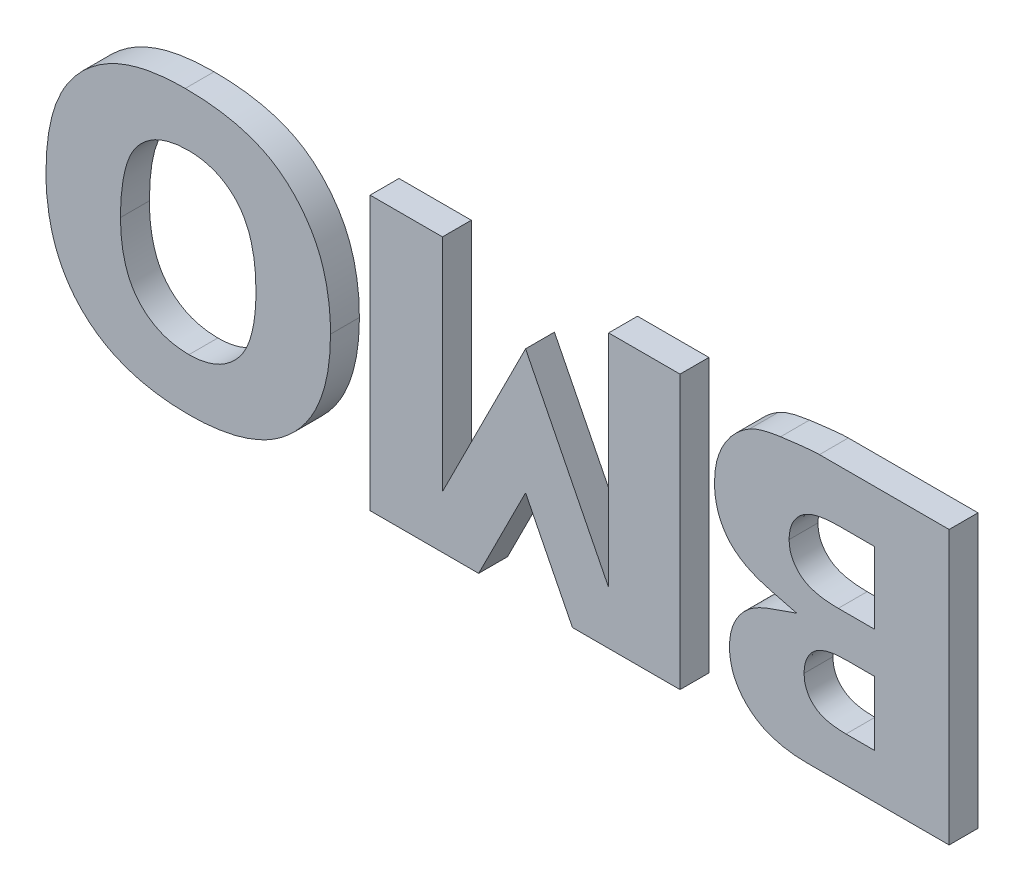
ISO-10303-21;
HEADER;
FILE_DESCRIPTION(('STEP AP214'),'2;1');
FILE_NAME('part.step','',(''),(''),'','','');
FILE_SCHEMA(('AUTOMOTIVE_DESIGN { 1 0 10303 214 1 1 1 1 }'));
ENDSEC;
DATA;
#1=APPLICATION_CONTEXT('core data for automotive mechanical design processes');
#2=APPLICATION_PROTOCOL_DEFINITION('international standard','automotive_design',2000,#1);
#3=PRODUCT_CONTEXT('',#1,'mechanical');
#4=PRODUCT('Part','Part','',(#3));
#5=PRODUCT_RELATED_PRODUCT_CATEGORY('part','',(#4));
#6=PRODUCT_DEFINITION_FORMATION('','',#4);
#7=PRODUCT_DEFINITION_CONTEXT('part definition',#1,'design');
#8=PRODUCT_DEFINITION('design','',#6,#7);
#9=PRODUCT_DEFINITION_SHAPE('','',#8);
#10=(LENGTH_UNIT() NAMED_UNIT(*) SI_UNIT(.MILLI.,.METRE.));
#11=(NAMED_UNIT(*) PLANE_ANGLE_UNIT() SI_UNIT($,.RADIAN.));
#12=(NAMED_UNIT(*) SI_UNIT($,.STERADIAN.) SOLID_ANGLE_UNIT());
#13=UNCERTAINTY_MEASURE_WITH_UNIT(LENGTH_MEASURE(1.E-05),#10,'distance_accuracy_value','');
#14=(GEOMETRIC_REPRESENTATION_CONTEXT(3) GLOBAL_UNCERTAINTY_ASSIGNED_CONTEXT((#13)) GLOBAL_UNIT_ASSIGNED_CONTEXT((#10,
#11,#12)) REPRESENTATION_CONTEXT('',''));
#15=CARTESIAN_POINT('',(0.,0.,0.));
#16=DIRECTION('',(0.,0.,1.));
#17=DIRECTION('',(1.,0.,0.));
#18=AXIS2_PLACEMENT_3D('',#15,#16,#17);
#19=CARTESIAN_POINT('',(-2.51878635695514,29.5527317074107,1.905));
#20=DIRECTION('',(0.,0.,-1.));
#21=DIRECTION('',(-1.,0.,0.));
#22=AXIS2_PLACEMENT_3D('',#19,#20,#21);
#23=PLANE('',#22);
#24=CARTESIAN_POINT('',(-0.00319279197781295,26.2172532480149,1.905));
#25=CARTESIAN_POINT('',(-0.195005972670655,26.2148420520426,1.905));
#26=CARTESIAN_POINT('',(-0.386748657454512,26.2118124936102,1.905));
#27=CARTESIAN_POINT('',(-0.767862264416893,26.1849492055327,1.905));
#28=CARTESIAN_POINT('',(-0.957261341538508,26.1613624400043,1.905));
#29=CARTESIAN_POINT('',(-1.33334817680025,26.090406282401,1.905));
#30=CARTESIAN_POINT('',(-1.52252200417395,26.0476526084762,1.905));
#31=CARTESIAN_POINT('',(-1.88459863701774,25.9245196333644,1.905));
#32=CARTESIAN_POINT('',(-2.0573590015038,25.843305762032,1.905));
#33=CARTESIAN_POINT('',(-2.38380180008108,25.6366041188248,1.905));
#34=CARTESIAN_POINT('',(-2.52983442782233,25.5146514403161,1.905));
#35=CARTESIAN_POINT('',(-2.78743881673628,25.2334521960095,1.905));
#36=CARTESIAN_POINT('',(-2.89831802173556,25.0726883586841,1.905));
#37=CARTESIAN_POINT('',(-3.07202043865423,24.7332170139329,1.905));
#38=CARTESIAN_POINT('',(-3.13847778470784,24.5499326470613,1.905));
#39=CARTESIAN_POINT('',(-3.21861760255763,24.1763181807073,1.905));
#40=CARTESIAN_POINT('',(-3.22876691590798,23.9851203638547,1.905));
#41=CARTESIAN_POINT('',(-3.23782240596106,23.7937620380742,1.905));
#42=B_SPLINE_CURVE_WITH_KNOTS('',3,(#24,#25,#26,#27,#28,#29,#30,#31,#32,#33,#34,#35,#36,#37,#38,
#39,#40,#41),.UNSPECIFIED.,.F.,.F.,(4,2,2,2,2,2,2,2,4),(0.,0.125,0.25,0.375,0.5,0.625,0.75,
0.875,1.),.UNSPECIFIED.);
#43=CARTESIAN_POINT('',(-0.00319279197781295,26.2172532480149,1.905));
#44=VERTEX_POINT('',#43);
#45=CARTESIAN_POINT('',(-3.23782240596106,23.7937620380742,1.905));
#46=VERTEX_POINT('',#45);
#47=EDGE_CURVE('E441',#44,#46,#42,.T.);
#48=ORIENTED_EDGE('',*,*,#47,.F.);
#49=DIRECTION('',(-1.,0.,0.));
#50=VECTOR('',#49,1.);
#51=CARTESIAN_POINT('',(2.40241371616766,26.2172532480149,1.905));
#52=LINE('',#51,#50);
#53=CARTESIAN_POINT('',(2.40241371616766,26.2172532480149,1.905));
#54=VERTEX_POINT('',#53);
#55=EDGE_CURVE('E446',#54,#44,#52,.T.);
#56=ORIENTED_EDGE('',*,*,#55,.F.);
#57=DIRECTION('',(0.,1.,0.));
#58=VECTOR('',#57,1.);
#59=CARTESIAN_POINT('',(2.4024137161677,21.490214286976,1.905));
#60=LINE('',#59,#58);
#61=CARTESIAN_POINT('',(2.4024137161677,21.490214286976,1.905));
#62=VERTEX_POINT('',#61);
#63=EDGE_CURVE('E401',#62,#54,#60,.T.);
#64=ORIENTED_EDGE('',*,*,#63,.F.);
#65=DIRECTION('',(1.,0.,0.));
#66=VECTOR('',#65,1.);
#67=CARTESIAN_POINT('',(0.00880903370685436,21.490214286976,1.905));
#68=LINE('',#67,#66);
#69=CARTESIAN_POINT('',(0.00880903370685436,21.490214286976,1.905));
#70=VERTEX_POINT('',#69);
#71=EDGE_CURVE('E561',#70,#62,#68,.T.);
#72=ORIENTED_EDGE('',*,*,#71,.F.);
#73=CARTESIAN_POINT('',(-3.23782240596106,23.7937620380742,1.905));
#74=CARTESIAN_POINT('',(-3.22744785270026,23.6056615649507,1.905));
#75=CARTESIAN_POINT('',(-3.2155318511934,23.4178200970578,1.905));
#76=CARTESIAN_POINT('',(-3.12994969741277,23.0525128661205,1.905));
#77=CARTESIAN_POINT('',(-3.05919665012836,22.8732948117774,1.905));
#78=CARTESIAN_POINT('',(-2.87316039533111,22.5499209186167,1.905));
#79=CARTESIAN_POINT('',(-2.75733691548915,22.3999652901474,1.905));
#80=CARTESIAN_POINT('',(-2.49159723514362,22.1317973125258,1.905));
#81=CARTESIAN_POINT('',(-2.34382410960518,22.0165305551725,1.905));
#82=CARTESIAN_POINT('',(-2.01610990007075,21.826613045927,1.905));
#83=CARTESIAN_POINT('',(-1.84166230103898,21.7554445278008,1.905));
#84=CARTESIAN_POINT('',(-1.48477580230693,21.6431027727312,1.905));
#85=CARTESIAN_POINT('',(-1.3003315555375,21.6017556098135,1.905));
#86=CARTESIAN_POINT('',(-0.928709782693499,21.541148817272,1.905));
#87=CARTESIAN_POINT('',(-0.742049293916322,21.5209412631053,1.905));
#88=CARTESIAN_POINT('',(-0.367481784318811,21.4953387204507,1.905));
#89=CARTESIAN_POINT('',(-0.179378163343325,21.4922799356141,1.905));
#90=CARTESIAN_POINT('',(0.00880903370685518,21.490214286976,1.905));
#91=B_SPLINE_CURVE_WITH_KNOTS('',3,(#73,#74,#75,#76,#77,#78,#79,#80,#81,#82,#83,#84,#85,#86,#87,
#88,#89,#90),.UNSPECIFIED.,.F.,.F.,(4,2,2,2,2,2,2,2,4),(0.,0.125,0.25,0.375,0.5,0.625,0.75,
0.875,1.),.UNSPECIFIED.);
#92=EDGE_CURVE('E557',#46,#70,#91,.T.);
#93=ORIENTED_EDGE('',*,*,#92,.F.);
#94=EDGE_LOOP('',(#48,#56,#64,#72,#93));
#95=FACE_BOUND('',#94,.T.);
#96=DIRECTION('',(0.,1.,0.));
#97=VECTOR('',#96,1.);
#98=CARTESIAN_POINT('',(7.32407605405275,11.6205,1.905));
#99=LINE('',#98,#97);
#100=CARTESIAN_POINT('',(7.32407605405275,11.6205,1.905));
#101=VERTEX_POINT('',#100);
#102=CARTESIAN_POINT('',(7.32407605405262,29.6545,1.905));
#103=VERTEX_POINT('',#102);
#104=EDGE_CURVE('E476',#101,#103,#99,.T.);
#105=ORIENTED_EDGE('',*,*,#104,.T.);
#106=DIRECTION('',(-1.,0.,0.));
#107=VECTOR('',#106,1.);
#108=CARTESIAN_POINT('',(7.32407605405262,29.6545,1.905));
#109=LINE('',#108,#107);
#110=CARTESIAN_POINT('',(-1.23284616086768,29.6545,1.905));
#111=VERTEX_POINT('',#110);
#112=EDGE_CURVE('E479',#103,#111,#109,.T.);
#113=ORIENTED_EDGE('',*,*,#112,.T.);
#114=CARTESIAN_POINT('',(-3.79919242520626,29.3926434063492,1.905));
#115=CARTESIAN_POINT('',(-3.37270933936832,29.4485418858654,1.905));
#116=CARTESIAN_POINT('',(-2.94600185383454,29.5027255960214,1.905));
#117=CARTESIAN_POINT('',(-2.41198248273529,29.565233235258,1.905));
#118=CARTESIAN_POINT('',(-2.30517628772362,29.5777127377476,1.905));
#119=CARTESIAN_POINT('',(-2.09118147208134,29.5990423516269,1.905));
#120=CARTESIAN_POINT('',(-1.98396468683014,29.6075284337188,1.905));
#121=CARTESIAN_POINT('',(-1.76970919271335,29.626659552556,1.905));
#122=CARTESIAN_POINT('',(-1.66266036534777,29.6375135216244,1.905));
#123=CARTESIAN_POINT('',(-1.44802584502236,29.6504568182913,1.905));
#124=CARTESIAN_POINT('',(-1.34045166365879,29.6527340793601,1.905));
#125=CARTESIAN_POINT('',(-1.23284616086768,29.6545,1.905));
#126=B_SPLINE_CURVE_WITH_KNOTS('',3,(#114,#115,#116,#117,#118,#119,#120,#121,#122,#123,#124,
#125),.UNSPECIFIED.,.F.,.F.,(4,2,2,2,2,4),(0.,0.499999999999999,0.624999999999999,0.75,0.875,
1.),.UNSPECIFIED.);
#127=CARTESIAN_POINT('',(-3.79919242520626,29.3926434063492,1.905));
#128=VERTEX_POINT('',#127);
#129=EDGE_CURVE('E768',#111,#128,#126,.F.);
#130=ORIENTED_EDGE('',*,*,#129,.T.);
#131=CARTESIAN_POINT('',(-5.84491811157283,28.8142404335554,1.905));
#132=CARTESIAN_POINT('',(-5.68715284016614,28.8970150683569,1.905));
#133=CARTESIAN_POINT('',(-5.52873346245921,28.9782101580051,1.905));
#134=CARTESIAN_POINT('',(-5.19538965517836,29.1007437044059,1.905));
#135=CARTESIAN_POINT('',(-5.02314562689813,29.1492546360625,1.905));
#136=CARTESIAN_POINT('',(-4.677844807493,29.2386396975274,1.905));
#137=CARTESIAN_POINT('',(-4.50347599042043,29.2769267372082,1.905));
#138=CARTESIAN_POINT('',(-4.15222984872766,29.3402367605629,1.905));
#139=CARTESIAN_POINT('',(-3.97570785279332,29.3664200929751,1.905));
#140=CARTESIAN_POINT('',(-3.79919242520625,29.3926434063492,1.905));
#141=B_SPLINE_CURVE_WITH_KNOTS('',3,(#131,#132,#133,#134,#135,#136,#137,#138,#139,#140),
.UNSPECIFIED.,.F.,.F.,(4,2,2,2,4),(0.,0.25,0.5,0.75,1.),.UNSPECIFIED.);
#142=CARTESIAN_POINT('',(-5.84491811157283,28.8142404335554,1.905));
#143=VERTEX_POINT('',#142);
#144=EDGE_CURVE('E762',#128,#143,#141,.F.);
#145=ORIENTED_EDGE('',*,*,#144,.T.);
#146=CARTESIAN_POINT('',(-8.15866781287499,24.6006206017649,1.905));
#147=CARTESIAN_POINT('',(-8.15205254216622,24.8112473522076,1.905));
#148=CARTESIAN_POINT('',(-8.14548676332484,25.0218815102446,1.905));
#149=CARTESIAN_POINT('',(-8.10547342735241,25.4391263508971,1.905));
#150=CARTESIAN_POINT('',(-8.0704257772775,25.6454975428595,1.905));
#151=CARTESIAN_POINT('',(-7.97309464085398,26.054163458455,1.905));
#152=CARTESIAN_POINT('',(-7.91048342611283,26.258040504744,1.905));
#153=CARTESIAN_POINT('',(-7.75950902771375,26.6511818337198,1.905));
#154=CARTESIAN_POINT('',(-7.67108070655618,26.8407804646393,1.905));
#155=CARTESIAN_POINT('',(-7.47122162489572,27.2075851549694,1.905));
#156=CARTESIAN_POINT('',(-7.360003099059,27.3849055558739,1.905));
#157=CARTESIAN_POINT('',(-7.11217851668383,27.7258688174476,1.905));
#158=CARTESIAN_POINT('',(-6.97523969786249,27.8890438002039,1.905));
#159=CARTESIAN_POINT('',(-6.68533026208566,28.1915548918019,1.905));
#160=CARTESIAN_POINT('',(-6.53161188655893,28.3326861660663,1.905));
#161=CARTESIAN_POINT('',(-6.20034593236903,28.5874198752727,1.905));
#162=CARTESIAN_POINT('',(-6.02264357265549,28.7008434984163,1.905));
#163=CARTESIAN_POINT('',(-5.84491811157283,28.8142404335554,1.905));
#164=B_SPLINE_CURVE_WITH_KNOTS('',3,(#146,#147,#148,#149,#150,#151,#152,#153,#154,#155,#156,
#157,#158,#159,#160,#161,#162,#163),.UNSPECIFIED.,.F.,.F.,(4,2,2,2,2,2,2,2,4),(0.,0.125,0.25,
0.375,0.5,0.625,0.75,0.875,1.),.UNSPECIFIED.);
#165=CARTESIAN_POINT('',(-8.15866781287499,24.6006206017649,1.905));
#166=VERTEX_POINT('',#165);
#167=EDGE_CURVE('E765',#143,#166,#164,.F.);
#168=ORIENTED_EDGE('',*,*,#167,.T.);
#169=CARTESIAN_POINT('',(-2.73090593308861,19.8417333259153,1.905));
#170=CARTESIAN_POINT('',(-3.05542730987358,19.924543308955,1.905));
#171=CARTESIAN_POINT('',(-3.37994868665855,20.0073532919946,1.905));
#172=CARTESIAN_POINT('',(-4.0289914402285,20.1729732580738,1.905));
#173=CARTESIAN_POINT('',(-4.35422672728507,20.2529948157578,1.905));
#174=CARTESIAN_POINT('',(-4.83941324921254,20.3834417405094,1.905));
#175=CARTESIAN_POINT('',(-4.99974080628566,20.4303745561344,1.905));
#176=CARTESIAN_POINT('',(-5.31470661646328,20.5374653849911,1.905));
#177=CARTESIAN_POINT('',(-5.46909239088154,20.5982930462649,1.905));
#178=CARTESIAN_POINT('',(-5.77343951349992,20.7303514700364,1.905));
#179=CARTESIAN_POINT('',(-5.92416468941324,20.7997862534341,1.905));
#180=CARTESIAN_POINT('',(-6.21812019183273,20.9562783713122,1.905));
#181=CARTESIAN_POINT('',(-6.36158500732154,21.0450668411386,1.905));
#182=CARTESIAN_POINT('',(-6.63788300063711,21.2353645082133,1.905));
#183=CARTESIAN_POINT('',(-6.77030063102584,21.3369252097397,1.905));
#184=CARTESIAN_POINT('',(-7.01922665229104,21.5578448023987,1.905));
#185=CARTESIAN_POINT('',(-7.13426061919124,21.6788531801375,1.905));
#186=CARTESIAN_POINT('',(-7.35046680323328,21.9363775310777,1.905));
#187=CARTESIAN_POINT('',(-7.45153646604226,22.0715880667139,1.905));
#188=CARTESIAN_POINT('',(-7.62620620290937,22.3548948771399,1.905));
#189=CARTESIAN_POINT('',(-7.70424600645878,22.501621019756,1.905));
#190=CARTESIAN_POINT('',(-7.84284747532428,22.8046119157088,1.905));
#191=CARTESIAN_POINT('',(-7.90174939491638,22.9630343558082,1.905));
#192=CARTESIAN_POINT('',(-8.00052281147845,23.2830974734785,1.905));
#193=CARTESIAN_POINT('',(-8.04058178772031,23.4445962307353,1.905));
#194=CARTESIAN_POINT('',(-8.1032838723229,23.7703331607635,1.905));
#195=CARTESIAN_POINT('',(-8.12544821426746,23.9346466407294,1.905));
#196=CARTESIAN_POINT('',(-8.15196839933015,24.2660747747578,1.905));
#197=CARTESIAN_POINT('',(-8.15542335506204,24.4333311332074,1.905));
#198=CARTESIAN_POINT('',(-8.158667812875,24.6006206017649,1.905));
#199=B_SPLINE_CURVE_WITH_KNOTS('',3,(#169,#170,#171,#172,#173,#174,#175,#176,#177,#178,#179,
#180,#181,#182,#183,#184,#185,#186,#187,#188,#189,#190,#191,#192,#193,#194,#195,#196,#197,#198),
.UNSPECIFIED.,.F.,.F.,(4,2,2,2,2,2,2,2,2,2,2,2,2,2,4),(0.,0.125,0.25,0.3125,0.375,0.4375,0.5,
0.5625,0.625,0.6875,0.75,0.8125,0.875,0.9375,1.),.UNSPECIFIED.);
#200=CARTESIAN_POINT('',(-2.73090593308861,19.8417333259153,1.905));
#201=VERTEX_POINT('',#200);
#202=EDGE_CURVE('E684',#166,#201,#199,.F.);
#203=ORIENTED_EDGE('',*,*,#202,.T.);
#204=CARTESIAN_POINT('',(-6.2252490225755,18.1778302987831,1.905));
#205=CARTESIAN_POINT('',(-6.10922736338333,18.2921268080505,1.905));
#206=CARTESIAN_POINT('',(-5.9933551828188,18.4066188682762,1.905));
#207=CARTESIAN_POINT('',(-5.74128698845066,18.6090149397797,1.905));
#208=CARTESIAN_POINT('',(-5.60511386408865,18.6969488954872,1.905));
#209=CARTESIAN_POINT('',(-5.32396072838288,18.8612954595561,1.905));
#210=CARTESIAN_POINT('',(-5.17922053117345,18.9375150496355,1.905));
#211=CARTESIAN_POINT('',(-4.88339682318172,19.0740163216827,1.905));
#212=CARTESIAN_POINT('',(-4.7312893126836,19.1335598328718,1.905));
#213=CARTESIAN_POINT('',(-4.27139109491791,19.301798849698,1.905));
#214=CARTESIAN_POINT('',(-3.96254496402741,19.4076995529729,1.905));
#215=CARTESIAN_POINT('',(-3.34672544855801,19.6247164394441,1.905));
#216=CARTESIAN_POINT('',(-3.03881569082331,19.7332248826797,1.905));
#217=CARTESIAN_POINT('',(-2.73090593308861,19.8417333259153,1.905));
#218=B_SPLINE_CURVE_WITH_KNOTS('',3,(#204,#205,#206,#207,#208,#209,#210,#211,#212,#213,#214,
#215,#216,#217),.UNSPECIFIED.,.F.,.F.,(4,2,2,2,2,2,4),(0.,0.125,0.25,0.375,0.499999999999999,
0.75,1.),.UNSPECIFIED.);
#219=CARTESIAN_POINT('',(-6.2252490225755,18.1778302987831,1.905));
#220=VERTEX_POINT('',#219);
#221=EDGE_CURVE('E682',#201,#220,#218,.F.);
#222=ORIENTED_EDGE('',*,*,#221,.T.);
#223=CARTESIAN_POINT('',(-7.16908323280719,15.7184107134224,1.905));
#224=CARTESIAN_POINT('',(-7.1669268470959,15.8313150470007,1.905));
#225=CARTESIAN_POINT('',(-7.16479924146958,15.944222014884,1.905));
#226=CARTESIAN_POINT('',(-7.14907675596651,16.1689863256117,1.905));
#227=CARTESIAN_POINT('',(-7.13476985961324,16.2807784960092,1.905));
#228=CARTESIAN_POINT('',(-7.07715547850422,16.6148100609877,1.905));
#229=CARTESIAN_POINT('',(-7.0179379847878,16.8323127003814,1.905));
#230=CARTESIAN_POINT('',(-6.85936198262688,17.2498252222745,1.905));
#231=CARTESIAN_POINT('',(-6.75997039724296,17.4526429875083,1.905));
#232=CARTESIAN_POINT('',(-6.57870535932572,17.7390390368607,1.905));
#233=CARTESIAN_POINT('',(-6.51389848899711,17.8312133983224,1.905));
#234=CARTESIAN_POINT('',(-6.37427731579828,18.00805176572,1.905));
#235=CARTESIAN_POINT('',(-6.29978947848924,18.0929607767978,1.905));
#236=CARTESIAN_POINT('',(-6.22524902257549,18.1778302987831,1.905));
#237=B_SPLINE_CURVE_WITH_KNOTS('',3,(#223,#224,#225,#226,#227,#228,#229,#230,#231,#232,#233,
#234,#235,#236),.UNSPECIFIED.,.F.,.F.,(4,2,2,2,2,2,4),(0.,0.125000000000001,0.250000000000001,
0.500000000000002,0.750000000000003,0.875000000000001,1.),.UNSPECIFIED.);
#238=CARTESIAN_POINT('',(-7.16908323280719,15.7184107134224,1.905));
#239=VERTEX_POINT('',#238);
#240=EDGE_CURVE('E597',#220,#239,#237,.F.);
#241=ORIENTED_EDGE('',*,*,#240,.T.);
#242=CARTESIAN_POINT('',(-2.01812332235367,11.6204999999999,1.905));
#243=CARTESIAN_POINT('',(-2.32704022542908,11.6249028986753,1.905));
#244=CARTESIAN_POINT('',(-2.63573784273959,11.6312018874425,1.905));
#245=CARTESIAN_POINT('',(-3.24759397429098,11.6916946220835,1.905));
#246=CARTESIAN_POINT('',(-3.55154131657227,11.7390676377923,1.905));
#247=CARTESIAN_POINT('',(-4.15397276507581,11.8810524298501,1.905));
#248=CARTESIAN_POINT('',(-4.45059799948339,11.9743008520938,1.905));
#249=CARTESIAN_POINT('',(-4.87561456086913,12.1549827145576,1.905));
#250=CARTESIAN_POINT('',(-5.01425807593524,12.2224871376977,1.905));
#251=CARTESIAN_POINT('',(-5.28474000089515,12.3738469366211,1.905));
#252=CARTESIAN_POINT('',(-5.41658356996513,12.4578865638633,1.905));
#253=CARTESIAN_POINT('',(-5.79282466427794,12.7287655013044,1.905));
#254=CARTESIAN_POINT('',(-6.02197897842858,12.9351046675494,1.905));
#255=CARTESIAN_POINT('',(-6.43365203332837,13.4031980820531,1.905));
#256=CARTESIAN_POINT('',(-6.60631665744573,13.6572970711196,1.905));
#257=CARTESIAN_POINT('',(-6.82435723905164,14.0629221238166,1.905));
#258=CARTESIAN_POINT('',(-6.88772043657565,14.2037227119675,1.905));
#259=CARTESIAN_POINT('',(-6.99308391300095,14.4981463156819,1.905));
#260=CARTESIAN_POINT('',(-7.03527384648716,14.6475141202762,1.905));
#261=CARTESIAN_POINT('',(-7.10328269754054,14.9485518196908,1.905));
#262=CARTESIAN_POINT('',(-7.12962691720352,15.1003396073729,1.905));
#263=CARTESIAN_POINT('',(-7.16089445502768,15.4074636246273,1.905));
#264=CARTESIAN_POINT('',(-7.16494989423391,15.5629436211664,1.905));
#265=CARTESIAN_POINT('',(-7.16908323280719,15.7184107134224,1.905));
#266=B_SPLINE_CURVE_WITH_KNOTS('',3,(#242,#243,#244,#245,#246,#247,#248,#249,#250,#251,#252,
#253,#254,#255,#256,#257,#258,#259,#260,#261,#262,#263,#264,#265),.UNSPECIFIED.,.F.,.F.,(4,2,2,
2,2,2,2,2,2,2,2,4),(0.,0.124999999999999,0.249999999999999,0.374999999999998,0.437499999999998,
0.499999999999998,0.624999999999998,0.749999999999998,0.812499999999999,0.874999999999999,
0.9375,1.),.UNSPECIFIED.);
#267=CARTESIAN_POINT('',(-2.01812332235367,11.6204999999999,1.905));
#268=VERTEX_POINT('',#267);
#269=EDGE_CURVE('E592',#239,#268,#266,.F.);
#270=ORIENTED_EDGE('',*,*,#269,.T.);
#271=DIRECTION('',(1.,0.,0.));
#272=VECTOR('',#271,1.);
#273=CARTESIAN_POINT('',(-2.01812332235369,11.6204999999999,1.905));
#274=LINE('',#273,#272);
#275=EDGE_CURVE('E590',#268,#101,#274,.T.);
#276=ORIENTED_EDGE('',*,*,#275,.T.);
#277=EDGE_LOOP('',(#105,#113,#130,#145,#168,#203,#222,#241,#270,#276));
#278=FACE_BOUND('',#277,.T.);
#279=CARTESIAN_POINT('',(0.556506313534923,18.7951753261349,1.905));
#280=CARTESIAN_POINT('',(0.220122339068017,18.7898574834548,1.905));
#281=CARTESIAN_POINT('',(-0.11620026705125,18.7772521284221,1.905));
#282=CARTESIAN_POINT('',(-0.614219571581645,18.6903101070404,1.905));
#283=CARTESIAN_POINT('',(-0.77530900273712,18.6473612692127,1.905));
#284=CARTESIAN_POINT('',(-1.09028601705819,18.5410046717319,1.905));
#285=CARTESIAN_POINT('',(-1.24362488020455,18.4744494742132,1.905));
#286=CARTESIAN_POINT('',(-1.52993012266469,18.2899561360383,1.905));
#287=CARTESIAN_POINT('',(-1.65621836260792,18.1791373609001,1.905));
#288=CARTESIAN_POINT('',(-1.87784250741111,17.9234131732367,1.905));
#289=CARTESIAN_POINT('',(-1.97034410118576,17.7800257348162,1.905));
#290=CARTESIAN_POINT('',(-2.1154324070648,17.4758275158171,1.905));
#291=CARTESIAN_POINT('',(-2.16941892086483,17.3128664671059,1.905));
#292=CARTESIAN_POINT('',(-2.23357590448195,16.9828353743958,1.905));
#293=CARTESIAN_POINT('',(-2.24138221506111,16.8129808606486,1.905));
#294=CARTESIAN_POINT('',(-2.24796230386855,16.643492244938,1.905));
#295=B_SPLINE_CURVE_WITH_KNOTS('',3,(#279,#280,#281,#282,#283,#284,#285,#286,#287,#288,#289,
#290,#291,#292,#293,#294),.UNSPECIFIED.,.F.,.F.,(4,2,2,2,2,2,2,4),(0.,0.25,0.375,0.5,0.625,0.75,
0.875,1.),.UNSPECIFIED.);
#296=CARTESIAN_POINT('',(0.556506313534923,18.7951753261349,1.905));
#297=VERTEX_POINT('',#296);
#298=CARTESIAN_POINT('',(-2.24796230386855,16.643492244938,1.905));
#299=VERTEX_POINT('',#298);
#300=EDGE_CURVE('E186',#297,#299,#295,.T.);
#301=ORIENTED_EDGE('',*,*,#300,.F.);
#302=DIRECTION('',(-1.,0.,0.));
#303=VECTOR('',#302,1.);
#304=CARTESIAN_POINT('',(2.40241371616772,18.795175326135,1.905));
#305=LINE('',#304,#303);
#306=CARTESIAN_POINT('',(2.40241371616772,18.795175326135,1.905));
#307=VERTEX_POINT('',#306);
#308=EDGE_CURVE('E348',#307,#297,#305,.T.);
#309=ORIENTED_EDGE('',*,*,#308,.F.);
#310=DIRECTION('',(0.,1.,0.));
#311=VECTOR('',#310,1.);
#312=CARTESIAN_POINT('',(2.40241371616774,14.5629415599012,1.905));
#313=LINE('',#312,#311);
#314=CARTESIAN_POINT('',(2.40241371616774,14.5629415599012,1.905));
#315=VERTEX_POINT('',#314);
#316=EDGE_CURVE('E344',#315,#307,#313,.T.);
#317=ORIENTED_EDGE('',*,*,#316,.F.);
#318=DIRECTION('',(1.,0.,0.));
#319=VECTOR('',#318,1.);
#320=CARTESIAN_POINT('',(0.519570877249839,14.5629415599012,1.905));
#321=LINE('',#320,#319);
#322=CARTESIAN_POINT('',(0.519570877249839,14.5629415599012,1.905));
#323=VERTEX_POINT('',#322);
#324=EDGE_CURVE('E212',#323,#315,#321,.T.);
#325=ORIENTED_EDGE('',*,*,#324,.F.);
#326=CARTESIAN_POINT('',(-2.24796230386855,16.643492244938,1.905));
#327=CARTESIAN_POINT('',(-2.24109201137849,16.4794360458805,1.905));
#328=CARTESIAN_POINT('',(-2.23284899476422,16.3156017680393,1.905));
#329=CARTESIAN_POINT('',(-2.16612710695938,15.9960545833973,1.905));
#330=CARTESIAN_POINT('',(-2.10997168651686,15.83791619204,1.905));
#331=CARTESIAN_POINT('',(-1.96113415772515,15.546246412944,1.905));
#332=CARTESIAN_POINT('',(-1.86709707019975,15.4091565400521,1.905));
#333=CARTESIAN_POINT('',(-1.64649704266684,15.1647264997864,1.905));
#334=CARTESIAN_POINT('',(-1.5214392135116,15.0595942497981,1.905));
#335=CARTESIAN_POINT('',(-1.10213305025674,14.7952828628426,1.905));
#336=CARTESIAN_POINT('',(-0.783608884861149,14.697712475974,1.905));
#337=CARTESIAN_POINT('',(-0.136636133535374,14.5822835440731,1.905));
#338=CARTESIAN_POINT('',(0.191303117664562,14.5709034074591,1.905));
#339=CARTESIAN_POINT('',(0.519570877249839,14.5629415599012,1.905));
#340=B_SPLINE_CURVE_WITH_KNOTS('',3,(#326,#327,#328,#329,#330,#331,#332,#333,#334,#335,#336,
#337,#338,#339),.UNSPECIFIED.,.F.,.F.,(4,2,2,2,2,2,4),(0.,0.124999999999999,0.249999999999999,
0.374999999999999,0.5,0.75,1.),.UNSPECIFIED.);
#341=EDGE_CURVE('E195',#299,#323,#340,.T.);
#342=ORIENTED_EDGE('',*,*,#341,.F.);
#343=EDGE_LOOP('',(#301,#309,#317,#325,#342));
#344=FACE_BOUND('',#343,.T.);
#345=ADVANCED_FACE('F44',(#95,#278,#344),#23,.F.);
#346=CARTESIAN_POINT('',(-2.51878635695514,29.5527317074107,0.));
#347=DIRECTION('',(0.,0.,-1.));
#348=DIRECTION('',(-1.,0.,0.));
#349=AXIS2_PLACEMENT_3D('',#346,#347,#348);
#350=PLANE('',#349);
#351=DIRECTION('',(-1.,0.,0.));
#352=VECTOR('',#351,1.);
#353=CARTESIAN_POINT('',(2.40241371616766,26.2172532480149,0.));
#354=LINE('',#353,#352);
#355=CARTESIAN_POINT('',(2.40241371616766,26.2172532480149,0.));
#356=VERTEX_POINT('',#355);
#357=CARTESIAN_POINT('',(-0.00319279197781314,26.2172532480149,0.));
#358=VERTEX_POINT('',#357);
#359=EDGE_CURVE('E466',#356,#358,#354,.T.);
#360=ORIENTED_EDGE('',*,*,#359,.T.);
#361=CARTESIAN_POINT('',(-3.23782240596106,23.7937620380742,0.));
#362=CARTESIAN_POINT('',(-3.22876691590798,23.9851203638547,0.));
#363=CARTESIAN_POINT('',(-3.21861760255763,24.1763181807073,0.));
#364=CARTESIAN_POINT('',(-3.13847778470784,24.5499326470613,0.));
#365=CARTESIAN_POINT('',(-3.07202043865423,24.7332170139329,0.));
#366=CARTESIAN_POINT('',(-2.89831802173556,25.0726883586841,0.));
#367=CARTESIAN_POINT('',(-2.78743881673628,25.2334521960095,0.));
#368=CARTESIAN_POINT('',(-2.52983442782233,25.5146514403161,0.));
#369=CARTESIAN_POINT('',(-2.38380180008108,25.6366041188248,0.));
#370=CARTESIAN_POINT('',(-2.0573590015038,25.843305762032,0.));
#371=CARTESIAN_POINT('',(-1.88459863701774,25.9245196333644,0.));
#372=CARTESIAN_POINT('',(-1.52252200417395,26.0476526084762,0.));
#373=CARTESIAN_POINT('',(-1.33334817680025,26.090406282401,0.));
#374=CARTESIAN_POINT('',(-0.957261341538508,26.1613624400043,0.));
#375=CARTESIAN_POINT('',(-0.767862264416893,26.1849492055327,0.));
#376=CARTESIAN_POINT('',(-0.386748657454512,26.2118124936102,0.));
#377=CARTESIAN_POINT('',(-0.195005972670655,26.2148420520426,0.));
#378=CARTESIAN_POINT('',(-0.00319279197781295,26.2172532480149,0.));
#379=B_SPLINE_CURVE_WITH_KNOTS('',3,(#361,#362,#363,#364,#365,#366,#367,#368,#369,#370,#371,
#372,#373,#374,#375,#376,#377,#378),.UNSPECIFIED.,.F.,.F.,(4,2,2,2,2,2,2,2,4),(0.,0.125,0.25,
0.375,0.5,0.625,0.75,0.875,1.),.UNSPECIFIED.);
#380=CARTESIAN_POINT('',(-3.23782240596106,23.7937620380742,0.));
#381=VERTEX_POINT('',#380);
#382=EDGE_CURVE('E206',#358,#381,#379,.F.);
#383=ORIENTED_EDGE('',*,*,#382,.T.);
#384=CARTESIAN_POINT('',(0.00880903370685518,21.490214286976,0.));
#385=CARTESIAN_POINT('',(-0.179378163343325,21.4922799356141,0.));
#386=CARTESIAN_POINT('',(-0.367481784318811,21.4953387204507,0.));
#387=CARTESIAN_POINT('',(-0.742049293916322,21.5209412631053,0.));
#388=CARTESIAN_POINT('',(-0.928709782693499,21.541148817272,0.));
#389=CARTESIAN_POINT('',(-1.3003315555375,21.6017556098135,0.));
#390=CARTESIAN_POINT('',(-1.48477580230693,21.6431027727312,0.));
#391=CARTESIAN_POINT('',(-1.84166230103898,21.7554445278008,0.));
#392=CARTESIAN_POINT('',(-2.01610990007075,21.826613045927,0.));
#393=CARTESIAN_POINT('',(-2.34382410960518,22.0165305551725,0.));
#394=CARTESIAN_POINT('',(-2.49159723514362,22.1317973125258,0.));
#395=CARTESIAN_POINT('',(-2.75733691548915,22.3999652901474,0.));
#396=CARTESIAN_POINT('',(-2.87316039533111,22.5499209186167,0.));
#397=CARTESIAN_POINT('',(-3.05919665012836,22.8732948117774,0.));
#398=CARTESIAN_POINT('',(-3.12994969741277,23.0525128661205,0.));
#399=CARTESIAN_POINT('',(-3.2155318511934,23.4178200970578,0.));
#400=CARTESIAN_POINT('',(-3.22744785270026,23.6056615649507,0.));
#401=CARTESIAN_POINT('',(-3.23782240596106,23.7937620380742,0.));
#402=B_SPLINE_CURVE_WITH_KNOTS('',3,(#384,#385,#386,#387,#388,#389,#390,#391,#392,#393,#394,
#395,#396,#397,#398,#399,#400,#401),.UNSPECIFIED.,.F.,.F.,(4,2,2,2,2,2,2,2,4),(0.,0.125,0.25,
0.375,0.5,0.625,0.75,0.875,1.),.UNSPECIFIED.);
#403=CARTESIAN_POINT('',(0.00880903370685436,21.490214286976,0.));
#404=VERTEX_POINT('',#403);
#405=EDGE_CURVE('E434',#381,#404,#402,.F.);
#406=ORIENTED_EDGE('',*,*,#405,.T.);
#407=DIRECTION('',(1.,0.,0.));
#408=VECTOR('',#407,1.);
#409=CARTESIAN_POINT('',(0.00880903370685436,21.490214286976,0.));
#410=LINE('',#409,#408);
#411=CARTESIAN_POINT('',(2.4024137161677,21.490214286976,0.));
#412=VERTEX_POINT('',#411);
#413=EDGE_CURVE('E425',#404,#412,#410,.T.);
#414=ORIENTED_EDGE('',*,*,#413,.T.);
#415=DIRECTION('',(0.,1.,0.));
#416=VECTOR('',#415,1.);
#417=CARTESIAN_POINT('',(2.4024137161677,21.490214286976,0.));
#418=LINE('',#417,#416);
#419=EDGE_CURVE('E433',#412,#356,#418,.T.);
#420=ORIENTED_EDGE('',*,*,#419,.T.);
#421=EDGE_LOOP('',(#360,#383,#406,#414,#420));
#422=FACE_BOUND('',#421,.T.);
#423=DIRECTION('',(0.,1.,0.));
#424=VECTOR('',#423,1.);
#425=CARTESIAN_POINT('',(7.32407605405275,11.6205,0.));
#426=LINE('',#425,#424);
#427=CARTESIAN_POINT('',(7.32407605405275,11.6205,0.));
#428=VERTEX_POINT('',#427);
#429=CARTESIAN_POINT('',(7.32407605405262,29.6545,0.));
#430=VERTEX_POINT('',#429);
#431=EDGE_CURVE('E533',#428,#430,#426,.T.);
#432=ORIENTED_EDGE('',*,*,#431,.F.);
#433=DIRECTION('',(1.,0.,0.));
#434=VECTOR('',#433,1.);
#435=CARTESIAN_POINT('',(-2.01812332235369,11.6204999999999,0.));
#436=LINE('',#435,#434);
#437=CARTESIAN_POINT('',(-2.01812332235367,11.6204999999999,0.));
#438=VERTEX_POINT('',#437);
#439=EDGE_CURVE('E480',#438,#428,#436,.T.);
#440=ORIENTED_EDGE('',*,*,#439,.F.);
#441=CARTESIAN_POINT('',(-7.16908323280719,15.7184107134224,0.));
#442=CARTESIAN_POINT('',(-7.16494989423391,15.5629436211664,0.));
#443=CARTESIAN_POINT('',(-7.16089445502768,15.4074636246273,0.));
#444=CARTESIAN_POINT('',(-7.12962691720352,15.1003396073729,0.));
#445=CARTESIAN_POINT('',(-7.10328269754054,14.9485518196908,0.));
#446=CARTESIAN_POINT('',(-7.03527384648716,14.6475141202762,0.));
#447=CARTESIAN_POINT('',(-6.99308391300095,14.4981463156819,0.));
#448=CARTESIAN_POINT('',(-6.88772043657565,14.2037227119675,0.));
#449=CARTESIAN_POINT('',(-6.82435723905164,14.0629221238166,0.));
#450=CARTESIAN_POINT('',(-6.60631665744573,13.6572970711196,0.));
#451=CARTESIAN_POINT('',(-6.43365203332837,13.4031980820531,0.));
#452=CARTESIAN_POINT('',(-6.02197897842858,12.9351046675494,0.));
#453=CARTESIAN_POINT('',(-5.79282466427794,12.7287655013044,0.));
#454=CARTESIAN_POINT('',(-5.41658356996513,12.4578865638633,0.));
#455=CARTESIAN_POINT('',(-5.28474000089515,12.3738469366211,0.));
#456=CARTESIAN_POINT('',(-5.01425807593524,12.2224871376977,0.));
#457=CARTESIAN_POINT('',(-4.87561456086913,12.1549827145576,0.));
#458=CARTESIAN_POINT('',(-4.45059799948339,11.9743008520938,0.));
#459=CARTESIAN_POINT('',(-4.15397276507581,11.8810524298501,0.));
#460=CARTESIAN_POINT('',(-3.55154131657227,11.7390676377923,0.));
#461=CARTESIAN_POINT('',(-3.24759397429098,11.6916946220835,0.));
#462=CARTESIAN_POINT('',(-2.63573784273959,11.6312018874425,0.));
#463=CARTESIAN_POINT('',(-2.32704022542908,11.6249028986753,0.));
#464=CARTESIAN_POINT('',(-2.01812332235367,11.6204999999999,0.));
#465=B_SPLINE_CURVE_WITH_KNOTS('',3,(#441,#442,#443,#444,#445,#446,#447,#448,#449,#450,#451,
#452,#453,#454,#455,#456,#457,#458,#459,#460,#461,#462,#463,#464),.UNSPECIFIED.,.F.,.F.,(4,2,2,
2,2,2,2,2,2,2,2,4),(0.,0.0625000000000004,0.125000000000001,0.187500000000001,0.250000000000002,
0.375000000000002,0.500000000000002,0.562500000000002,0.625000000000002,0.750000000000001,
0.875000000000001,1.),.UNSPECIFIED.);
#466=CARTESIAN_POINT('',(-7.16908323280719,15.7184107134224,0.));
#467=VERTEX_POINT('',#466);
#468=EDGE_CURVE('E604',#467,#438,#465,.T.);
#469=ORIENTED_EDGE('',*,*,#468,.F.);
#470=CARTESIAN_POINT('',(-6.22524902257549,18.1778302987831,0.));
#471=CARTESIAN_POINT('',(-6.29978947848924,18.0929607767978,0.));
#472=CARTESIAN_POINT('',(-6.37427731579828,18.00805176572,0.));
#473=CARTESIAN_POINT('',(-6.51389848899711,17.8312133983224,0.));
#474=CARTESIAN_POINT('',(-6.57870535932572,17.7390390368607,0.));
#475=CARTESIAN_POINT('',(-6.75997039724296,17.4526429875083,0.));
#476=CARTESIAN_POINT('',(-6.85936198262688,17.2498252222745,0.));
#477=CARTESIAN_POINT('',(-7.0179379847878,16.8323127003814,0.));
#478=CARTESIAN_POINT('',(-7.07715547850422,16.6148100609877,0.));
#479=CARTESIAN_POINT('',(-7.13476985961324,16.2807784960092,0.));
#480=CARTESIAN_POINT('',(-7.14907675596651,16.1689863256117,0.));
#481=CARTESIAN_POINT('',(-7.16479924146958,15.944222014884,0.));
#482=CARTESIAN_POINT('',(-7.1669268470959,15.8313150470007,0.));
#483=CARTESIAN_POINT('',(-7.16908323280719,15.7184107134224,0.));
#484=B_SPLINE_CURVE_WITH_KNOTS('',3,(#470,#471,#472,#473,#474,#475,#476,#477,#478,#479,#480,
#481,#482,#483),.UNSPECIFIED.,.F.,.F.,(4,2,2,2,2,2,4),(0.,0.124999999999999,0.249999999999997,
0.499999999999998,0.749999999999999,0.874999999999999,1.),.UNSPECIFIED.);
#485=CARTESIAN_POINT('',(-6.2252490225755,18.1778302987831,0.));
#486=VERTEX_POINT('',#485);
#487=EDGE_CURVE('E663',#486,#467,#484,.T.);
#488=ORIENTED_EDGE('',*,*,#487,.F.);
#489=CARTESIAN_POINT('',(-2.73090593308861,19.8417333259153,0.));
#490=CARTESIAN_POINT('',(-3.03881569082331,19.7332248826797,0.));
#491=CARTESIAN_POINT('',(-3.34672544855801,19.6247164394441,0.));
#492=CARTESIAN_POINT('',(-3.96254496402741,19.4076995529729,0.));
#493=CARTESIAN_POINT('',(-4.27139109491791,19.301798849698,0.));
#494=CARTESIAN_POINT('',(-4.7312893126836,19.1335598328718,0.));
#495=CARTESIAN_POINT('',(-4.88339682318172,19.0740163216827,0.));
#496=CARTESIAN_POINT('',(-5.17922053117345,18.9375150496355,0.));
#497=CARTESIAN_POINT('',(-5.32396072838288,18.8612954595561,0.));
#498=CARTESIAN_POINT('',(-5.60511386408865,18.6969488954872,0.));
#499=CARTESIAN_POINT('',(-5.74128698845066,18.6090149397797,0.));
#500=CARTESIAN_POINT('',(-5.9933551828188,18.4066188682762,0.));
#501=CARTESIAN_POINT('',(-6.10922736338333,18.2921268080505,0.));
#502=CARTESIAN_POINT('',(-6.2252490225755,18.1778302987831,0.));
#503=B_SPLINE_CURVE_WITH_KNOTS('',3,(#489,#490,#491,#492,#493,#494,#495,#496,#497,#498,#499,
#500,#501,#502),.UNSPECIFIED.,.F.,.F.,(4,2,2,2,2,2,4),(0.,0.25,0.500000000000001,0.625,0.75,
0.875,1.),.UNSPECIFIED.);
#504=CARTESIAN_POINT('',(-2.73090593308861,19.8417333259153,0.));
#505=VERTEX_POINT('',#504);
#506=EDGE_CURVE('E688',#505,#486,#503,.T.);
#507=ORIENTED_EDGE('',*,*,#506,.F.);
#508=CARTESIAN_POINT('',(-8.158667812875,24.6006206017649,0.));
#509=CARTESIAN_POINT('',(-8.15542335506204,24.4333311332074,0.));
#510=CARTESIAN_POINT('',(-8.15196839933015,24.2660747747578,0.));
#511=CARTESIAN_POINT('',(-8.12544821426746,23.9346466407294,0.));
#512=CARTESIAN_POINT('',(-8.1032838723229,23.7703331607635,0.));
#513=CARTESIAN_POINT('',(-8.04058178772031,23.4445962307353,0.));
#514=CARTESIAN_POINT('',(-8.00052281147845,23.2830974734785,0.));
#515=CARTESIAN_POINT('',(-7.90174939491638,22.9630343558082,0.));
#516=CARTESIAN_POINT('',(-7.84284747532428,22.8046119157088,0.));
#517=CARTESIAN_POINT('',(-7.70424600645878,22.501621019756,0.));
#518=CARTESIAN_POINT('',(-7.62620620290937,22.3548948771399,0.));
#519=CARTESIAN_POINT('',(-7.45153646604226,22.0715880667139,0.));
#520=CARTESIAN_POINT('',(-7.35046680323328,21.9363775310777,0.));
#521=CARTESIAN_POINT('',(-7.13426061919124,21.6788531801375,0.));
#522=CARTESIAN_POINT('',(-7.01922665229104,21.5578448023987,0.));
#523=CARTESIAN_POINT('',(-6.77030063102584,21.3369252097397,0.));
#524=CARTESIAN_POINT('',(-6.63788300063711,21.2353645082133,0.));
#525=CARTESIAN_POINT('',(-6.36158500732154,21.0450668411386,0.));
#526=CARTESIAN_POINT('',(-6.21812019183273,20.9562783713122,0.));
#527=CARTESIAN_POINT('',(-5.92416468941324,20.7997862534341,0.));
#528=CARTESIAN_POINT('',(-5.77343951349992,20.7303514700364,0.));
#529=CARTESIAN_POINT('',(-5.46909239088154,20.5982930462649,0.));
#530=CARTESIAN_POINT('',(-5.31470661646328,20.5374653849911,0.));
#531=CARTESIAN_POINT('',(-4.99974080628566,20.4303745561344,0.));
#532=CARTESIAN_POINT('',(-4.83941324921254,20.3834417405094,0.));
#533=CARTESIAN_POINT('',(-4.35422672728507,20.2529948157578,0.));
#534=CARTESIAN_POINT('',(-4.0289914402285,20.1729732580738,0.));
#535=CARTESIAN_POINT('',(-3.37994868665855,20.0073532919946,0.));
#536=CARTESIAN_POINT('',(-3.05542730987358,19.924543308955,0.));
#537=CARTESIAN_POINT('',(-2.73090593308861,19.8417333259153,0.));
#538=B_SPLINE_CURVE_WITH_KNOTS('',3,(#508,#509,#510,#511,#512,#513,#514,#515,#516,#517,#518,
#519,#520,#521,#522,#523,#524,#525,#526,#527,#528,#529,#530,#531,#532,#533,#534,#535,#536,#537),
.UNSPECIFIED.,.F.,.F.,(4,2,2,2,2,2,2,2,2,2,2,2,2,2,4),(0.,0.0625,0.125,0.1875,0.25,0.3125,0.375,
0.4375,0.5,0.5625,0.625,0.6875,0.75,0.875,1.),.UNSPECIFIED.);
#539=CARTESIAN_POINT('',(-8.15866781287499,24.6006206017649,0.));
#540=VERTEX_POINT('',#539);
#541=EDGE_CURVE('E791',#540,#505,#538,.T.);
#542=ORIENTED_EDGE('',*,*,#541,.F.);
#543=CARTESIAN_POINT('',(-5.84491811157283,28.8142404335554,0.));
#544=CARTESIAN_POINT('',(-6.02264357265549,28.7008434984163,0.));
#545=CARTESIAN_POINT('',(-6.20034593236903,28.5874198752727,0.));
#546=CARTESIAN_POINT('',(-6.53161188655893,28.3326861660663,0.));
#547=CARTESIAN_POINT('',(-6.68533026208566,28.1915548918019,0.));
#548=CARTESIAN_POINT('',(-6.97523969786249,27.8890438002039,0.));
#549=CARTESIAN_POINT('',(-7.11217851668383,27.7258688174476,0.));
#550=CARTESIAN_POINT('',(-7.360003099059,27.3849055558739,0.));
#551=CARTESIAN_POINT('',(-7.47122162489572,27.2075851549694,0.));
#552=CARTESIAN_POINT('',(-7.67108070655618,26.8407804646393,0.));
#553=CARTESIAN_POINT('',(-7.75950902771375,26.6511818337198,0.));
#554=CARTESIAN_POINT('',(-7.91048342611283,26.258040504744,0.));
#555=CARTESIAN_POINT('',(-7.97309464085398,26.054163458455,0.));
#556=CARTESIAN_POINT('',(-8.0704257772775,25.6454975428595,0.));
#557=CARTESIAN_POINT('',(-8.10547342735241,25.4391263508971,0.));
#558=CARTESIAN_POINT('',(-8.14548676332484,25.0218815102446,0.));
#559=CARTESIAN_POINT('',(-8.15205254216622,24.8112473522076,0.));
#560=CARTESIAN_POINT('',(-8.15866781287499,24.6006206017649,0.));
#561=B_SPLINE_CURVE_WITH_KNOTS('',3,(#543,#544,#545,#546,#547,#548,#549,#550,#551,#552,#553,
#554,#555,#556,#557,#558,#559,#560),.UNSPECIFIED.,.F.,.F.,(4,2,2,2,2,2,2,2,4),(0.,0.125,0.25,
0.375,0.5,0.625,0.75,0.875,1.),.UNSPECIFIED.);
#562=CARTESIAN_POINT('',(-5.84491811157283,28.8142404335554,0.));
#563=VERTEX_POINT('',#562);
#564=EDGE_CURVE('E753',#563,#540,#561,.T.);
#565=ORIENTED_EDGE('',*,*,#564,.F.);
#566=CARTESIAN_POINT('',(-3.79919242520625,29.3926434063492,0.));
#567=CARTESIAN_POINT('',(-3.97570785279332,29.3664200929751,0.));
#568=CARTESIAN_POINT('',(-4.15222984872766,29.3402367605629,0.));
#569=CARTESIAN_POINT('',(-4.50347599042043,29.2769267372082,0.));
#570=CARTESIAN_POINT('',(-4.677844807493,29.2386396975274,0.));
#571=CARTESIAN_POINT('',(-5.02314562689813,29.1492546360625,0.));
#572=CARTESIAN_POINT('',(-5.19538965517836,29.1007437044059,0.));
#573=CARTESIAN_POINT('',(-5.52873346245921,28.9782101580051,0.));
#574=CARTESIAN_POINT('',(-5.68715284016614,28.8970150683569,0.));
#575=CARTESIAN_POINT('',(-5.84491811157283,28.8142404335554,0.));
#576=B_SPLINE_CURVE_WITH_KNOTS('',3,(#566,#567,#568,#569,#570,#571,#572,#573,#574,#575),
.UNSPECIFIED.,.F.,.F.,(4,2,2,2,4),(0.,0.25,0.5,0.75,1.),.UNSPECIFIED.);
#577=CARTESIAN_POINT('',(-3.79919242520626,29.3926434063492,0.));
#578=VERTEX_POINT('',#577);
#579=EDGE_CURVE('E774',#578,#563,#576,.T.);
#580=ORIENTED_EDGE('',*,*,#579,.F.);
#581=CARTESIAN_POINT('',(-1.23284616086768,29.6545,0.));
#582=CARTESIAN_POINT('',(-1.34045166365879,29.6527340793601,0.));
#583=CARTESIAN_POINT('',(-1.44802584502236,29.6504568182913,0.));
#584=CARTESIAN_POINT('',(-1.66266036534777,29.6375135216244,0.));
#585=CARTESIAN_POINT('',(-1.76970919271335,29.626659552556,0.));
#586=CARTESIAN_POINT('',(-1.98396468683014,29.6075284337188,0.));
#587=CARTESIAN_POINT('',(-2.09118147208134,29.5990423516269,0.));
#588=CARTESIAN_POINT('',(-2.30517628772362,29.5777127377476,0.));
#589=CARTESIAN_POINT('',(-2.41198248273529,29.565233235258,0.));
#590=CARTESIAN_POINT('',(-2.94600185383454,29.5027255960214,0.));
#591=CARTESIAN_POINT('',(-3.37270933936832,29.4485418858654,0.));
#592=CARTESIAN_POINT('',(-3.79919242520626,29.3926434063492,0.));
#593=B_SPLINE_CURVE_WITH_KNOTS('',3,(#581,#582,#583,#584,#585,#586,#587,#588,#589,#590,#591,
#592),.UNSPECIFIED.,.F.,.F.,(4,2,2,2,2,4),(0.,0.125,0.25,0.375000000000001,0.500000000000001,
1.),.UNSPECIFIED.);
#594=CARTESIAN_POINT('',(-1.23284616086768,29.6545,0.));
#595=VERTEX_POINT('',#594);
#596=EDGE_CURVE('E522',#595,#578,#593,.T.);
#597=ORIENTED_EDGE('',*,*,#596,.F.);
#598=DIRECTION('',(-1.,0.,0.));
#599=VECTOR('',#598,1.);
#600=CARTESIAN_POINT('',(7.32407605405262,29.6545,0.));
#601=LINE('',#600,#599);
#602=EDGE_CURVE('E526',#430,#595,#601,.T.);
#603=ORIENTED_EDGE('',*,*,#602,.F.);
#604=EDGE_LOOP('',(#432,#440,#469,#488,#507,#542,#565,#580,#597,#603));
#605=FACE_BOUND('',#604,.T.);
#606=DIRECTION('',(-1.,0.,0.));
#607=VECTOR('',#606,1.);
#608=CARTESIAN_POINT('',(2.40241371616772,18.795175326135,0.));
#609=LINE('',#608,#607);
#610=CARTESIAN_POINT('',(2.40241371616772,18.795175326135,0.));
#611=VERTEX_POINT('',#610);
#612=CARTESIAN_POINT('',(0.556506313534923,18.7951753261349,0.));
#613=VERTEX_POINT('',#612);
#614=EDGE_CURVE('E196',#611,#613,#609,.T.);
#615=ORIENTED_EDGE('',*,*,#614,.T.);
#616=CARTESIAN_POINT('',(-2.24796230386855,16.643492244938,0.));
#617=CARTESIAN_POINT('',(-2.24138221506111,16.8129808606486,0.));
#618=CARTESIAN_POINT('',(-2.23357590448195,16.9828353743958,0.));
#619=CARTESIAN_POINT('',(-2.16941892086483,17.3128664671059,0.));
#620=CARTESIAN_POINT('',(-2.1154324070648,17.4758275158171,0.));
#621=CARTESIAN_POINT('',(-1.97034410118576,17.7800257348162,0.));
#622=CARTESIAN_POINT('',(-1.87784250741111,17.9234131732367,0.));
#623=CARTESIAN_POINT('',(-1.65621836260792,18.1791373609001,0.));
#624=CARTESIAN_POINT('',(-1.52993012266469,18.2899561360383,0.));
#625=CARTESIAN_POINT('',(-1.24362488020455,18.4744494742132,0.));
#626=CARTESIAN_POINT('',(-1.09028601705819,18.5410046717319,0.));
#627=CARTESIAN_POINT('',(-0.77530900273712,18.6473612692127,0.));
#628=CARTESIAN_POINT('',(-0.614219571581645,18.6903101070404,0.));
#629=CARTESIAN_POINT('',(-0.11620026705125,18.7772521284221,0.));
#630=CARTESIAN_POINT('',(0.220122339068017,18.7898574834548,0.));
#631=CARTESIAN_POINT('',(0.556506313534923,18.7951753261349,0.));
#632=B_SPLINE_CURVE_WITH_KNOTS('',3,(#616,#617,#618,#619,#620,#621,#622,#623,#624,#625,#626,
#627,#628,#629,#630,#631),.UNSPECIFIED.,.F.,.F.,(4,2,2,2,2,2,2,4),(0.,0.125,0.25,0.375,0.5,
0.625,0.75,1.),.UNSPECIFIED.);
#633=CARTESIAN_POINT('',(-2.24796230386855,16.643492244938,0.));
#634=VERTEX_POINT('',#633);
#635=EDGE_CURVE('E71',#613,#634,#632,.F.);
#636=ORIENTED_EDGE('',*,*,#635,.T.);
#637=CARTESIAN_POINT('',(0.519570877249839,14.5629415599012,0.));
#638=CARTESIAN_POINT('',(0.191303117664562,14.5709034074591,0.));
#639=CARTESIAN_POINT('',(-0.136636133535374,14.5822835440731,0.));
#640=CARTESIAN_POINT('',(-0.783608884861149,14.697712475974,0.));
#641=CARTESIAN_POINT('',(-1.10213305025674,14.7952828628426,0.));
#642=CARTESIAN_POINT('',(-1.5214392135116,15.0595942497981,0.));
#643=CARTESIAN_POINT('',(-1.64649704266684,15.1647264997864,0.));
#644=CARTESIAN_POINT('',(-1.86709707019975,15.4091565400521,0.));
#645=CARTESIAN_POINT('',(-1.96113415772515,15.546246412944,0.));
#646=CARTESIAN_POINT('',(-2.10997168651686,15.83791619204,0.));
#647=CARTESIAN_POINT('',(-2.16612710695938,15.9960545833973,0.));
#648=CARTESIAN_POINT('',(-2.23284899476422,16.3156017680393,0.));
#649=CARTESIAN_POINT('',(-2.24109201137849,16.4794360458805,0.));
#650=CARTESIAN_POINT('',(-2.24796230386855,16.643492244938,0.));
#651=B_SPLINE_CURVE_WITH_KNOTS('',3,(#637,#638,#639,#640,#641,#642,#643,#644,#645,#646,#647,
#648,#649,#650),.UNSPECIFIED.,.F.,.F.,(4,2,2,2,2,2,4),(0.,0.25,0.5,0.625000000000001,
0.750000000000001,0.875000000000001,1.),.UNSPECIFIED.);
#652=CARTESIAN_POINT('',(0.519570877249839,14.5629415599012,0.));
#653=VERTEX_POINT('',#652);
#654=EDGE_CURVE('E204',#634,#653,#651,.F.);
#655=ORIENTED_EDGE('',*,*,#654,.T.);
#656=DIRECTION('',(1.,0.,0.));
#657=VECTOR('',#656,1.);
#658=CARTESIAN_POINT('',(0.519570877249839,14.5629415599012,0.));
#659=LINE('',#658,#657);
#660=CARTESIAN_POINT('',(2.40241371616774,14.5629415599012,0.));
#661=VERTEX_POINT('',#660);
#662=EDGE_CURVE('E309',#653,#661,#659,.T.);
#663=ORIENTED_EDGE('',*,*,#662,.T.);
#664=DIRECTION('',(0.,1.,0.));
#665=VECTOR('',#664,1.);
#666=CARTESIAN_POINT('',(2.40241371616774,14.5629415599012,0.));
#667=LINE('',#666,#665);
#668=EDGE_CURVE('E310',#661,#611,#667,.T.);
#669=ORIENTED_EDGE('',*,*,#668,.T.);
#670=EDGE_LOOP('',(#615,#636,#655,#663,#669));
#671=FACE_BOUND('',#670,.T.);
#672=ADVANCED_FACE('F229',(#422,#605,#671),#350,.T.);
#673=CARTESIAN_POINT('',(7.32407605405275,11.6205,1.905));
#674=DIRECTION('',(-1.,0.,0.));
#675=DIRECTION('',(0.,-1.,0.));
#676=AXIS2_PLACEMENT_3D('',#673,#674,#675);
#677=PLANE('',#676);
#678=ORIENTED_EDGE('',*,*,#431,.T.);
#679=DIRECTION('',(0.,0.,-1.));
#680=VECTOR('',#679,1.);
#681=CARTESIAN_POINT('',(7.32407605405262,29.6545,1.905));
#682=LINE('',#681,#680);
#683=EDGE_CURVE('E12',#103,#430,#682,.T.);
#684=ORIENTED_EDGE('',*,*,#683,.F.);
#685=ORIENTED_EDGE('',*,*,#104,.F.);
#686=DIRECTION('',(0.,0.,-1.));
#687=VECTOR('',#686,1.);
#688=CARTESIAN_POINT('',(7.32407605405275,11.6205,1.905));
#689=LINE('',#688,#687);
#690=EDGE_CURVE('E588',#101,#428,#689,.T.);
#691=ORIENTED_EDGE('',*,*,#690,.T.);
#692=EDGE_LOOP('',(#678,#684,#685,#691));
#693=FACE_BOUND('',#692,.T.);
#694=ADVANCED_FACE('F46',(#693),#677,.F.);
#695=CARTESIAN_POINT('',(7.32407605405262,29.6545,1.905));
#696=DIRECTION('',(0.,-1.,0.));
#697=DIRECTION('',(1.,0.,0.));
#698=AXIS2_PLACEMENT_3D('',#695,#696,#697);
#699=PLANE('',#698);
#700=ORIENTED_EDGE('',*,*,#602,.T.);
#701=DIRECTION('',(0.,0.,-1.));
#702=VECTOR('',#701,1.);
#703=CARTESIAN_POINT('',(-1.23284616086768,29.6545,1.905));
#704=LINE('',#703,#702);
#705=EDGE_CURVE('E55',#111,#595,#704,.T.);
#706=ORIENTED_EDGE('',*,*,#705,.F.);
#707=ORIENTED_EDGE('',*,*,#112,.F.);
#708=ORIENTED_EDGE('',*,*,#683,.T.);
#709=EDGE_LOOP('',(#700,#706,#707,#708));
#710=FACE_BOUND('',#709,.T.);
#711=ADVANCED_FACE('F498',(#710),#699,.F.);
#712=CARTESIAN_POINT('',(-1.23284616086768,29.6545,1.905));
#713=CARTESIAN_POINT('',(-1.34045166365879,29.6527340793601,1.905));
#714=CARTESIAN_POINT('',(-1.44802584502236,29.6504568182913,1.905));
#715=CARTESIAN_POINT('',(-1.66266036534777,29.6375135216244,1.905));
#716=CARTESIAN_POINT('',(-1.76970919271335,29.626659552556,1.905));
#717=CARTESIAN_POINT('',(-1.98396468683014,29.6075284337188,1.905));
#718=CARTESIAN_POINT('',(-2.09118147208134,29.5990423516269,1.905));
#719=CARTESIAN_POINT('',(-2.30517628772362,29.5777127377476,1.905));
#720=CARTESIAN_POINT('',(-2.41198248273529,29.565233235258,1.905));
#721=CARTESIAN_POINT('',(-2.94600185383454,29.5027255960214,1.905));
#722=CARTESIAN_POINT('',(-3.37270933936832,29.4485418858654,1.905));
#723=CARTESIAN_POINT('',(-3.79919242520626,29.3926434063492,1.905));
#724=B_SPLINE_CURVE_WITH_KNOTS('',3,(#712,#713,#714,#715,#716,#717,#718,#719,#720,#721,#722,
#723),.UNSPECIFIED.,.F.,.F.,(4,2,2,2,2,4),(0.,0.125,0.25,0.375000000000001,0.500000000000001,
1.),.UNSPECIFIED.);
#725=DIRECTION('',(0.,0.,-1.));
#726=VECTOR('',#725,1.);
#727=SURFACE_OF_LINEAR_EXTRUSION('',#724,#726);
#728=ORIENTED_EDGE('',*,*,#596,.T.);
#729=DIRECTION('',(0.,0.,-1.));
#730=VECTOR('',#729,1.);
#731=CARTESIAN_POINT('',(-3.79919242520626,29.3926434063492,1.905));
#732=LINE('',#731,#730);
#733=EDGE_CURVE('E776',#128,#578,#732,.T.);
#734=ORIENTED_EDGE('',*,*,#733,.F.);
#735=ORIENTED_EDGE('',*,*,#129,.F.);
#736=ORIENTED_EDGE('',*,*,#705,.T.);
#737=EDGE_LOOP('',(#728,#734,#735,#736));
#738=FACE_BOUND('',#737,.T.);
#739=ADVANCED_FACE('F493',(#738),#727,.F.);
#740=CARTESIAN_POINT('',(-3.79919242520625,29.3926434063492,1.905));
#741=CARTESIAN_POINT('',(-3.97570785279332,29.3664200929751,1.905));
#742=CARTESIAN_POINT('',(-4.15222984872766,29.3402367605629,1.905));
#743=CARTESIAN_POINT('',(-4.50347599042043,29.2769267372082,1.905));
#744=CARTESIAN_POINT('',(-4.677844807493,29.2386396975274,1.905));
#745=CARTESIAN_POINT('',(-5.02314562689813,29.1492546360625,1.905));
#746=CARTESIAN_POINT('',(-5.19538965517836,29.1007437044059,1.905));
#747=CARTESIAN_POINT('',(-5.52873346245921,28.9782101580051,1.905));
#748=CARTESIAN_POINT('',(-5.68715284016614,28.8970150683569,1.905));
#749=CARTESIAN_POINT('',(-5.84491811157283,28.8142404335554,1.905));
#750=B_SPLINE_CURVE_WITH_KNOTS('',3,(#740,#741,#742,#743,#744,#745,#746,#747,#748,#749),
.UNSPECIFIED.,.F.,.F.,(4,2,2,2,4),(0.,0.25,0.5,0.75,1.),.UNSPECIFIED.);
#751=DIRECTION('',(0.,0.,-1.));
#752=VECTOR('',#751,1.);
#753=SURFACE_OF_LINEAR_EXTRUSION('',#750,#752);
#754=ORIENTED_EDGE('',*,*,#579,.T.);
#755=DIRECTION('',(0.,0.,-1.));
#756=VECTOR('',#755,1.);
#757=CARTESIAN_POINT('',(-5.84491811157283,28.8142404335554,1.905));
#758=LINE('',#757,#756);
#759=EDGE_CURVE('E773',#143,#563,#758,.T.);
#760=ORIENTED_EDGE('',*,*,#759,.F.);
#761=ORIENTED_EDGE('',*,*,#144,.F.);
#762=ORIENTED_EDGE('',*,*,#733,.T.);
#763=EDGE_LOOP('',(#754,#760,#761,#762));
#764=FACE_BOUND('',#763,.T.);
#765=ADVANCED_FACE('F497',(#764),#753,.F.);
#766=CARTESIAN_POINT('',(-5.84491811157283,28.8142404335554,1.905));
#767=CARTESIAN_POINT('',(-6.02264357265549,28.7008434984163,1.905));
#768=CARTESIAN_POINT('',(-6.20034593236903,28.5874198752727,1.905));
#769=CARTESIAN_POINT('',(-6.53161188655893,28.3326861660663,1.905));
#770=CARTESIAN_POINT('',(-6.68533026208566,28.1915548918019,1.905));
#771=CARTESIAN_POINT('',(-6.97523969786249,27.8890438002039,1.905));
#772=CARTESIAN_POINT('',(-7.11217851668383,27.7258688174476,1.905));
#773=CARTESIAN_POINT('',(-7.360003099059,27.3849055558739,1.905));
#774=CARTESIAN_POINT('',(-7.47122162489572,27.2075851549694,1.905));
#775=CARTESIAN_POINT('',(-7.67108070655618,26.8407804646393,1.905));
#776=CARTESIAN_POINT('',(-7.75950902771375,26.6511818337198,1.905));
#777=CARTESIAN_POINT('',(-7.91048342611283,26.258040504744,1.905));
#778=CARTESIAN_POINT('',(-7.97309464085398,26.054163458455,1.905));
#779=CARTESIAN_POINT('',(-8.0704257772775,25.6454975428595,1.905));
#780=CARTESIAN_POINT('',(-8.10547342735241,25.4391263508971,1.905));
#781=CARTESIAN_POINT('',(-8.14548676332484,25.0218815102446,1.905));
#782=CARTESIAN_POINT('',(-8.15205254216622,24.8112473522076,1.905));
#783=CARTESIAN_POINT('',(-8.15866781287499,24.6006206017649,1.905));
#784=B_SPLINE_CURVE_WITH_KNOTS('',3,(#766,#767,#768,#769,#770,#771,#772,#773,#774,#775,#776,
#777,#778,#779,#780,#781,#782,#783),.UNSPECIFIED.,.F.,.F.,(4,2,2,2,2,2,2,2,4),(0.,0.125,0.25,
0.375,0.5,0.625,0.75,0.875,1.),.UNSPECIFIED.);
#785=DIRECTION('',(0.,0.,-1.));
#786=VECTOR('',#785,1.);
#787=SURFACE_OF_LINEAR_EXTRUSION('',#784,#786);
#788=ORIENTED_EDGE('',*,*,#564,.T.);
#789=DIRECTION('',(0.,0.,-1.));
#790=VECTOR('',#789,1.);
#791=CARTESIAN_POINT('',(-8.15866781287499,24.6006206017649,1.905));
#792=LINE('',#791,#790);
#793=EDGE_CURVE('E654',#166,#540,#792,.T.);
#794=ORIENTED_EDGE('',*,*,#793,.F.);
#795=ORIENTED_EDGE('',*,*,#167,.F.);
#796=ORIENTED_EDGE('',*,*,#759,.T.);
#797=EDGE_LOOP('',(#788,#794,#795,#796));
#798=FACE_BOUND('',#797,.T.);
#799=ADVANCED_FACE('F698',(#798),#787,.F.);
#800=CARTESIAN_POINT('',(-8.158667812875,24.6006206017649,1.905));
#801=CARTESIAN_POINT('',(-8.15542335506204,24.4333311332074,1.905));
#802=CARTESIAN_POINT('',(-8.15196839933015,24.2660747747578,1.905));
#803=CARTESIAN_POINT('',(-8.12544821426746,23.9346466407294,1.905));
#804=CARTESIAN_POINT('',(-8.1032838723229,23.7703331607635,1.905));
#805=CARTESIAN_POINT('',(-8.04058178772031,23.4445962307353,1.905));
#806=CARTESIAN_POINT('',(-8.00052281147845,23.2830974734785,1.905));
#807=CARTESIAN_POINT('',(-7.90174939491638,22.9630343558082,1.905));
#808=CARTESIAN_POINT('',(-7.84284747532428,22.8046119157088,1.905));
#809=CARTESIAN_POINT('',(-7.70424600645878,22.501621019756,1.905));
#810=CARTESIAN_POINT('',(-7.62620620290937,22.3548948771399,1.905));
#811=CARTESIAN_POINT('',(-7.45153646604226,22.0715880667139,1.905));
#812=CARTESIAN_POINT('',(-7.35046680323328,21.9363775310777,1.905));
#813=CARTESIAN_POINT('',(-7.13426061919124,21.6788531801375,1.905));
#814=CARTESIAN_POINT('',(-7.01922665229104,21.5578448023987,1.905));
#815=CARTESIAN_POINT('',(-6.77030063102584,21.3369252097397,1.905));
#816=CARTESIAN_POINT('',(-6.63788300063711,21.2353645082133,1.905));
#817=CARTESIAN_POINT('',(-6.36158500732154,21.0450668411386,1.905));
#818=CARTESIAN_POINT('',(-6.21812019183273,20.9562783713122,1.905));
#819=CARTESIAN_POINT('',(-5.92416468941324,20.7997862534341,1.905));
#820=CARTESIAN_POINT('',(-5.77343951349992,20.7303514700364,1.905));
#821=CARTESIAN_POINT('',(-5.46909239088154,20.5982930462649,1.905));
#822=CARTESIAN_POINT('',(-5.31470661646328,20.5374653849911,1.905));
#823=CARTESIAN_POINT('',(-4.99974080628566,20.4303745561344,1.905));
#824=CARTESIAN_POINT('',(-4.83941324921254,20.3834417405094,1.905));
#825=CARTESIAN_POINT('',(-4.35422672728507,20.2529948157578,1.905));
#826=CARTESIAN_POINT('',(-4.0289914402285,20.1729732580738,1.905));
#827=CARTESIAN_POINT('',(-3.37994868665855,20.0073532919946,1.905));
#828=CARTESIAN_POINT('',(-3.05542730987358,19.924543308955,1.905));
#829=CARTESIAN_POINT('',(-2.73090593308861,19.8417333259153,1.905));
#830=B_SPLINE_CURVE_WITH_KNOTS('',3,(#800,#801,#802,#803,#804,#805,#806,#807,#808,#809,#810,
#811,#812,#813,#814,#815,#816,#817,#818,#819,#820,#821,#822,#823,#824,#825,#826,#827,#828,#829),
.UNSPECIFIED.,.F.,.F.,(4,2,2,2,2,2,2,2,2,2,2,2,2,2,4),(0.,0.0625,0.125,0.1875,0.25,0.3125,0.375,
0.4375,0.5,0.5625,0.625,0.6875,0.75,0.875,1.),.UNSPECIFIED.);
#831=DIRECTION('',(0.,0.,-1.));
#832=VECTOR('',#831,1.);
#833=SURFACE_OF_LINEAR_EXTRUSION('',#830,#832);
#834=ORIENTED_EDGE('',*,*,#541,.T.);
#835=DIRECTION('',(0.,0.,-1.));
#836=VECTOR('',#835,1.);
#837=CARTESIAN_POINT('',(-2.73090593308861,19.8417333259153,1.905));
#838=LINE('',#837,#836);
#839=EDGE_CURVE('E648',#201,#505,#838,.T.);
#840=ORIENTED_EDGE('',*,*,#839,.F.);
#841=ORIENTED_EDGE('',*,*,#202,.F.);
#842=ORIENTED_EDGE('',*,*,#793,.T.);
#843=EDGE_LOOP('',(#834,#840,#841,#842));
#844=FACE_BOUND('',#843,.T.);
#845=ADVANCED_FACE('F694',(#844),#833,.F.);
#846=CARTESIAN_POINT('',(-2.73090593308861,19.8417333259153,1.905));
#847=CARTESIAN_POINT('',(-3.03881569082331,19.7332248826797,1.905));
#848=CARTESIAN_POINT('',(-3.34672544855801,19.6247164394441,1.905));
#849=CARTESIAN_POINT('',(-3.96254496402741,19.4076995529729,1.905));
#850=CARTESIAN_POINT('',(-4.27139109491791,19.301798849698,1.905));
#851=CARTESIAN_POINT('',(-4.7312893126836,19.1335598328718,1.905));
#852=CARTESIAN_POINT('',(-4.88339682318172,19.0740163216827,1.905));
#853=CARTESIAN_POINT('',(-5.17922053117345,18.9375150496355,1.905));
#854=CARTESIAN_POINT('',(-5.32396072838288,18.8612954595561,1.905));
#855=CARTESIAN_POINT('',(-5.60511386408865,18.6969488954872,1.905));
#856=CARTESIAN_POINT('',(-5.74128698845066,18.6090149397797,1.905));
#857=CARTESIAN_POINT('',(-5.9933551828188,18.4066188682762,1.905));
#858=CARTESIAN_POINT('',(-6.10922736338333,18.2921268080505,1.905));
#859=CARTESIAN_POINT('',(-6.2252490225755,18.1778302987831,1.905));
#860=B_SPLINE_CURVE_WITH_KNOTS('',3,(#846,#847,#848,#849,#850,#851,#852,#853,#854,#855,#856,
#857,#858,#859),.UNSPECIFIED.,.F.,.F.,(4,2,2,2,2,2,4),(0.,0.25,0.500000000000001,0.625,0.75,
0.875,1.),.UNSPECIFIED.);
#861=DIRECTION('',(0.,0.,-1.));
#862=VECTOR('',#861,1.);
#863=SURFACE_OF_LINEAR_EXTRUSION('',#860,#862);
#864=ORIENTED_EDGE('',*,*,#506,.T.);
#865=DIRECTION('',(0.,0.,-1.));
#866=VECTOR('',#865,1.);
#867=CARTESIAN_POINT('',(-6.2252490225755,18.1778302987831,1.905));
#868=LINE('',#867,#866);
#869=EDGE_CURVE('E645',#220,#486,#868,.T.);
#870=ORIENTED_EDGE('',*,*,#869,.F.);
#871=ORIENTED_EDGE('',*,*,#221,.F.);
#872=ORIENTED_EDGE('',*,*,#839,.T.);
#873=EDGE_LOOP('',(#864,#870,#871,#872));
#874=FACE_BOUND('',#873,.T.);
#875=ADVANCED_FACE('F687',(#874),#863,.F.);
#876=CARTESIAN_POINT('',(-6.22524902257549,18.1778302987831,1.905));
#877=CARTESIAN_POINT('',(-6.29978947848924,18.0929607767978,1.905));
#878=CARTESIAN_POINT('',(-6.37427731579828,18.00805176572,1.905));
#879=CARTESIAN_POINT('',(-6.51389848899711,17.8312133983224,1.905));
#880=CARTESIAN_POINT('',(-6.57870535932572,17.7390390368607,1.905));
#881=CARTESIAN_POINT('',(-6.75997039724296,17.4526429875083,1.905));
#882=CARTESIAN_POINT('',(-6.85936198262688,17.2498252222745,1.905));
#883=CARTESIAN_POINT('',(-7.0179379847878,16.8323127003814,1.905));
#884=CARTESIAN_POINT('',(-7.07715547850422,16.6148100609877,1.905));
#885=CARTESIAN_POINT('',(-7.13476985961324,16.2807784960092,1.905));
#886=CARTESIAN_POINT('',(-7.14907675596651,16.1689863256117,1.905));
#887=CARTESIAN_POINT('',(-7.16479924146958,15.944222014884,1.905));
#888=CARTESIAN_POINT('',(-7.1669268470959,15.8313150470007,1.905));
#889=CARTESIAN_POINT('',(-7.16908323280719,15.7184107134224,1.905));
#890=B_SPLINE_CURVE_WITH_KNOTS('',3,(#876,#877,#878,#879,#880,#881,#882,#883,#884,#885,#886,
#887,#888,#889),.UNSPECIFIED.,.F.,.F.,(4,2,2,2,2,2,4),(0.,0.124999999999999,0.249999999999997,
0.499999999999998,0.749999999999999,0.874999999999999,1.),.UNSPECIFIED.);
#891=DIRECTION('',(0.,0.,-1.));
#892=VECTOR('',#891,1.);
#893=SURFACE_OF_LINEAR_EXTRUSION('',#890,#892);
#894=ORIENTED_EDGE('',*,*,#487,.T.);
#895=DIRECTION('',(0.,0.,-1.));
#896=VECTOR('',#895,1.);
#897=CARTESIAN_POINT('',(-7.16908323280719,15.7184107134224,1.905));
#898=LINE('',#897,#896);
#899=EDGE_CURVE('E608',#239,#467,#898,.T.);
#900=ORIENTED_EDGE('',*,*,#899,.F.);
#901=ORIENTED_EDGE('',*,*,#240,.F.);
#902=ORIENTED_EDGE('',*,*,#869,.T.);
#903=EDGE_LOOP('',(#894,#900,#901,#902));
#904=FACE_BOUND('',#903,.T.);
#905=ADVANCED_FACE('F631',(#904),#893,.F.);
#906=CARTESIAN_POINT('',(-7.16908323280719,15.7184107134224,1.905));
#907=CARTESIAN_POINT('',(-7.16494989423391,15.5629436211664,1.905));
#908=CARTESIAN_POINT('',(-7.16089445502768,15.4074636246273,1.905));
#909=CARTESIAN_POINT('',(-7.12962691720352,15.1003396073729,1.905));
#910=CARTESIAN_POINT('',(-7.10328269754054,14.9485518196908,1.905));
#911=CARTESIAN_POINT('',(-7.03527384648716,14.6475141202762,1.905));
#912=CARTESIAN_POINT('',(-6.99308391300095,14.4981463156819,1.905));
#913=CARTESIAN_POINT('',(-6.88772043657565,14.2037227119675,1.905));
#914=CARTESIAN_POINT('',(-6.82435723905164,14.0629221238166,1.905));
#915=CARTESIAN_POINT('',(-6.60631665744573,13.6572970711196,1.905));
#916=CARTESIAN_POINT('',(-6.43365203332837,13.4031980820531,1.905));
#917=CARTESIAN_POINT('',(-6.02197897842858,12.9351046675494,1.905));
#918=CARTESIAN_POINT('',(-5.79282466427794,12.7287655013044,1.905));
#919=CARTESIAN_POINT('',(-5.41658356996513,12.4578865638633,1.905));
#920=CARTESIAN_POINT('',(-5.28474000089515,12.3738469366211,1.905));
#921=CARTESIAN_POINT('',(-5.01425807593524,12.2224871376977,1.905));
#922=CARTESIAN_POINT('',(-4.87561456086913,12.1549827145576,1.905));
#923=CARTESIAN_POINT('',(-4.45059799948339,11.9743008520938,1.905));
#924=CARTESIAN_POINT('',(-4.15397276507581,11.8810524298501,1.905));
#925=CARTESIAN_POINT('',(-3.55154131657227,11.7390676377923,1.905));
#926=CARTESIAN_POINT('',(-3.24759397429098,11.6916946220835,1.905));
#927=CARTESIAN_POINT('',(-2.63573784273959,11.6312018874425,1.905));
#928=CARTESIAN_POINT('',(-2.32704022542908,11.6249028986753,1.905));
#929=CARTESIAN_POINT('',(-2.01812332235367,11.6204999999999,1.905));
#930=B_SPLINE_CURVE_WITH_KNOTS('',3,(#906,#907,#908,#909,#910,#911,#912,#913,#914,#915,#916,
#917,#918,#919,#920,#921,#922,#923,#924,#925,#926,#927,#928,#929),.UNSPECIFIED.,.F.,.F.,(4,2,2,
2,2,2,2,2,2,2,2,4),(0.,0.0625000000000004,0.125000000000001,0.187500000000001,0.250000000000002,
0.375000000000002,0.500000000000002,0.562500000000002,0.625000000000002,0.750000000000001,
0.875000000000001,1.),.UNSPECIFIED.);
#931=DIRECTION('',(0.,0.,-1.));
#932=VECTOR('',#931,1.);
#933=SURFACE_OF_LINEAR_EXTRUSION('',#930,#932);
#934=ORIENTED_EDGE('',*,*,#468,.T.);
#935=DIRECTION('',(0.,0.,-1.));
#936=VECTOR('',#935,1.);
#937=CARTESIAN_POINT('',(-2.01812332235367,11.6204999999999,1.905));
#938=LINE('',#937,#936);
#939=EDGE_CURVE('E589',#268,#438,#938,.T.);
#940=ORIENTED_EDGE('',*,*,#939,.F.);
#941=ORIENTED_EDGE('',*,*,#269,.F.);
#942=ORIENTED_EDGE('',*,*,#899,.T.);
#943=EDGE_LOOP('',(#934,#940,#941,#942));
#944=FACE_BOUND('',#943,.T.);
#945=ADVANCED_FACE('F602',(#944),#933,.F.);
#946=CARTESIAN_POINT('',(-2.01812332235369,11.6204999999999,1.905));
#947=DIRECTION('',(0.,1.,0.));
#948=DIRECTION('',(-1.,0.,0.));
#949=AXIS2_PLACEMENT_3D('',#946,#947,#948);
#950=PLANE('',#949);
#951=ORIENTED_EDGE('',*,*,#439,.T.);
#952=ORIENTED_EDGE('',*,*,#690,.F.);
#953=ORIENTED_EDGE('',*,*,#275,.F.);
#954=ORIENTED_EDGE('',*,*,#939,.T.);
#955=EDGE_LOOP('',(#951,#952,#953,#954));
#956=FACE_BOUND('',#955,.T.);
#957=ADVANCED_FACE('F610',(#956),#950,.F.);
#958=CARTESIAN_POINT('',(-0.00319279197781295,26.2172532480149,1.905));
#959=CARTESIAN_POINT('',(-0.195005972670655,26.2148420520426,1.905));
#960=CARTESIAN_POINT('',(-0.386748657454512,26.2118124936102,1.905));
#961=CARTESIAN_POINT('',(-0.767862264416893,26.1849492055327,1.905));
#962=CARTESIAN_POINT('',(-0.957261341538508,26.1613624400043,1.905));
#963=CARTESIAN_POINT('',(-1.33334817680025,26.090406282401,1.905));
#964=CARTESIAN_POINT('',(-1.52252200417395,26.0476526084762,1.905));
#965=CARTESIAN_POINT('',(-1.88459863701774,25.9245196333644,1.905));
#966=CARTESIAN_POINT('',(-2.0573590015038,25.843305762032,1.905));
#967=CARTESIAN_POINT('',(-2.38380180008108,25.6366041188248,1.905));
#968=CARTESIAN_POINT('',(-2.52983442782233,25.5146514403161,1.905));
#969=CARTESIAN_POINT('',(-2.78743881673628,25.2334521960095,1.905));
#970=CARTESIAN_POINT('',(-2.89831802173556,25.0726883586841,1.905));
#971=CARTESIAN_POINT('',(-3.07202043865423,24.7332170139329,1.905));
#972=CARTESIAN_POINT('',(-3.13847778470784,24.5499326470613,1.905));
#973=CARTESIAN_POINT('',(-3.21861760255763,24.1763181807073,1.905));
#974=CARTESIAN_POINT('',(-3.22876691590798,23.9851203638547,1.905));
#975=CARTESIAN_POINT('',(-3.23782240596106,23.7937620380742,1.905));
#976=B_SPLINE_CURVE_WITH_KNOTS('',3,(#958,#959,#960,#961,#962,#963,#964,#965,#966,#967,#968,
#969,#970,#971,#972,#973,#974,#975),.UNSPECIFIED.,.F.,.F.,(4,2,2,2,2,2,2,2,4),(0.,0.125,0.25,
0.375,0.5,0.625,0.75,0.875,1.),.UNSPECIFIED.);
#977=DIRECTION('',(0.,0.,-1.));
#978=VECTOR('',#977,1.);
#979=SURFACE_OF_LINEAR_EXTRUSION('',#976,#978);
#980=ORIENTED_EDGE('',*,*,#382,.F.);
#981=DIRECTION('',(0.,0.,-1.));
#982=VECTOR('',#981,1.);
#983=CARTESIAN_POINT('',(-0.00319279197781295,26.2172532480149,1.905));
#984=LINE('',#983,#982);
#985=EDGE_CURVE('E453',#44,#358,#984,.T.);
#986=ORIENTED_EDGE('',*,*,#985,.F.);
#987=ORIENTED_EDGE('',*,*,#47,.T.);
#988=DIRECTION('',(0.,0.,-1.));
#989=VECTOR('',#988,1.);
#990=CARTESIAN_POINT('',(-3.23782240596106,23.7937620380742,1.905));
#991=LINE('',#990,#989);
#992=EDGE_CURVE('E573',#46,#381,#991,.T.);
#993=ORIENTED_EDGE('',*,*,#992,.T.);
#994=EDGE_LOOP('',(#980,#986,#987,#993));
#995=FACE_BOUND('',#994,.T.);
#996=ADVANCED_FACE('F231',(#995),#979,.T.);
#997=CARTESIAN_POINT('',(-3.23782240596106,23.7937620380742,1.905));
#998=CARTESIAN_POINT('',(-3.22744785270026,23.6056615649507,1.905));
#999=CARTESIAN_POINT('',(-3.2155318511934,23.4178200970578,1.905));
#1000=CARTESIAN_POINT('',(-3.12994969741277,23.0525128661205,1.905));
#1001=CARTESIAN_POINT('',(-3.05919665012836,22.8732948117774,1.905));
#1002=CARTESIAN_POINT('',(-2.87316039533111,22.5499209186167,1.905));
#1003=CARTESIAN_POINT('',(-2.75733691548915,22.3999652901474,1.905));
#1004=CARTESIAN_POINT('',(-2.49159723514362,22.1317973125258,1.905));
#1005=CARTESIAN_POINT('',(-2.34382410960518,22.0165305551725,1.905));
#1006=CARTESIAN_POINT('',(-2.01610990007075,21.826613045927,1.905));
#1007=CARTESIAN_POINT('',(-1.84166230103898,21.7554445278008,1.905));
#1008=CARTESIAN_POINT('',(-1.48477580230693,21.6431027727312,1.905));
#1009=CARTESIAN_POINT('',(-1.3003315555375,21.6017556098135,1.905));
#1010=CARTESIAN_POINT('',(-0.928709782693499,21.541148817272,1.905));
#1011=CARTESIAN_POINT('',(-0.742049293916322,21.5209412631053,1.905));
#1012=CARTESIAN_POINT('',(-0.367481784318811,21.4953387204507,1.905));
#1013=CARTESIAN_POINT('',(-0.179378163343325,21.4922799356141,1.905));
#1014=CARTESIAN_POINT('',(0.00880903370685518,21.490214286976,1.905));
#1015=B_SPLINE_CURVE_WITH_KNOTS('',3,(#997,#998,#999,#1000,#1001,#1002,#1003,#1004,#1005,#1006,
#1007,#1008,#1009,#1010,#1011,#1012,#1013,#1014),.UNSPECIFIED.,.F.,.F.,(4,2,2,2,2,2,2,2,4),(0.,
0.125,0.25,0.375,0.5,0.625,0.75,0.875,1.),.UNSPECIFIED.);
#1016=DIRECTION('',(0.,0.,-1.));
#1017=VECTOR('',#1016,1.);
#1018=SURFACE_OF_LINEAR_EXTRUSION('',#1015,#1017);
#1019=ORIENTED_EDGE('',*,*,#405,.F.);
#1020=ORIENTED_EDGE('',*,*,#992,.F.);
#1021=ORIENTED_EDGE('',*,*,#92,.T.);
#1022=DIRECTION('',(0.,0.,-1.));
#1023=VECTOR('',#1022,1.);
#1024=CARTESIAN_POINT('',(0.00880903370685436,21.490214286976,1.905));
#1025=LINE('',#1024,#1023);
#1026=EDGE_CURVE('E571',#70,#404,#1025,.T.);
#1027=ORIENTED_EDGE('',*,*,#1026,.T.);
#1028=EDGE_LOOP('',(#1019,#1020,#1021,#1027));
#1029=FACE_BOUND('',#1028,.T.);
#1030=ADVANCED_FACE('F406',(#1029),#1018,.T.);
#1031=CARTESIAN_POINT('',(0.00880903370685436,21.490214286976,1.905));
#1032=DIRECTION('',(0.,1.,0.));
#1033=DIRECTION('',(-1.,0.,0.));
#1034=AXIS2_PLACEMENT_3D('',#1031,#1032,#1033);
#1035=PLANE('',#1034);
#1036=ORIENTED_EDGE('',*,*,#413,.F.);
#1037=ORIENTED_EDGE('',*,*,#1026,.F.);
#1038=ORIENTED_EDGE('',*,*,#71,.T.);
#1039=DIRECTION('',(0.,0.,-1.));
#1040=VECTOR('',#1039,1.);
#1041=CARTESIAN_POINT('',(2.4024137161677,21.490214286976,1.905));
#1042=LINE('',#1041,#1040);
#1043=EDGE_CURVE('E574',#62,#412,#1042,.T.);
#1044=ORIENTED_EDGE('',*,*,#1043,.T.);
#1045=EDGE_LOOP('',(#1036,#1037,#1038,#1044));
#1046=FACE_BOUND('',#1045,.T.);
#1047=ADVANCED_FACE('F410',(#1046),#1035,.T.);
#1048=CARTESIAN_POINT('',(2.4024137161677,21.490214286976,1.905));
#1049=DIRECTION('',(-1.,0.,0.));
#1050=DIRECTION('',(0.,-1.,0.));
#1051=AXIS2_PLACEMENT_3D('',#1048,#1049,#1050);
#1052=PLANE('',#1051);
#1053=ORIENTED_EDGE('',*,*,#419,.F.);
#1054=ORIENTED_EDGE('',*,*,#1043,.F.);
#1055=ORIENTED_EDGE('',*,*,#63,.T.);
#1056=DIRECTION('',(0.,0.,-1.));
#1057=VECTOR('',#1056,1.);
#1058=CARTESIAN_POINT('',(2.40241371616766,26.2172532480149,1.905));
#1059=LINE('',#1058,#1057);
#1060=EDGE_CURVE('E458',#54,#356,#1059,.T.);
#1061=ORIENTED_EDGE('',*,*,#1060,.T.);
#1062=EDGE_LOOP('',(#1053,#1054,#1055,#1061));
#1063=FACE_BOUND('',#1062,.T.);
#1064=ADVANCED_FACE('F950',(#1063),#1052,.T.);
#1065=CARTESIAN_POINT('',(2.40241371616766,26.2172532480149,1.905));
#1066=DIRECTION('',(0.,-1.,0.));
#1067=DIRECTION('',(0.,0.,-1.));
#1068=AXIS2_PLACEMENT_3D('',#1065,#1066,#1067);
#1069=PLANE('',#1068);
#1070=ORIENTED_EDGE('',*,*,#359,.F.);
#1071=ORIENTED_EDGE('',*,*,#1060,.F.);
#1072=ORIENTED_EDGE('',*,*,#55,.T.);
#1073=ORIENTED_EDGE('',*,*,#985,.T.);
#1074=EDGE_LOOP('',(#1070,#1071,#1072,#1073));
#1075=FACE_BOUND('',#1074,.T.);
#1076=ADVANCED_FACE('F865',(#1075),#1069,.T.);
#1077=CARTESIAN_POINT('',(0.556506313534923,18.7951753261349,1.905));
#1078=CARTESIAN_POINT('',(0.220122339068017,18.7898574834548,1.905));
#1079=CARTESIAN_POINT('',(-0.11620026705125,18.7772521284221,1.905));
#1080=CARTESIAN_POINT('',(-0.614219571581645,18.6903101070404,1.905));
#1081=CARTESIAN_POINT('',(-0.77530900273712,18.6473612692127,1.905));
#1082=CARTESIAN_POINT('',(-1.09028601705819,18.5410046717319,1.905));
#1083=CARTESIAN_POINT('',(-1.24362488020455,18.4744494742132,1.905));
#1084=CARTESIAN_POINT('',(-1.52993012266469,18.2899561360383,1.905));
#1085=CARTESIAN_POINT('',(-1.65621836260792,18.1791373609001,1.905));
#1086=CARTESIAN_POINT('',(-1.87784250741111,17.9234131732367,1.905));
#1087=CARTESIAN_POINT('',(-1.97034410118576,17.7800257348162,1.905));
#1088=CARTESIAN_POINT('',(-2.1154324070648,17.4758275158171,1.905));
#1089=CARTESIAN_POINT('',(-2.16941892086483,17.3128664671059,1.905));
#1090=CARTESIAN_POINT('',(-2.23357590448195,16.9828353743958,1.905));
#1091=CARTESIAN_POINT('',(-2.24138221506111,16.8129808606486,1.905));
#1092=CARTESIAN_POINT('',(-2.24796230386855,16.643492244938,1.905));
#1093=B_SPLINE_CURVE_WITH_KNOTS('',3,(#1077,#1078,#1079,#1080,#1081,#1082,#1083,#1084,#1085,
#1086,#1087,#1088,#1089,#1090,#1091,#1092),.UNSPECIFIED.,.F.,.F.,(4,2,2,2,2,2,2,4),(0.,0.25,
0.375,0.5,0.625,0.75,0.875,1.),.UNSPECIFIED.);
#1094=DIRECTION('',(0.,0.,-1.));
#1095=VECTOR('',#1094,1.);
#1096=SURFACE_OF_LINEAR_EXTRUSION('',#1093,#1095);
#1097=ORIENTED_EDGE('',*,*,#635,.F.);
#1098=DIRECTION('',(0.,0.,-1.));
#1099=VECTOR('',#1098,1.);
#1100=CARTESIAN_POINT('',(0.556506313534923,18.7951753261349,1.905));
#1101=LINE('',#1100,#1099);
#1102=EDGE_CURVE('E191',#297,#613,#1101,.T.);
#1103=ORIENTED_EDGE('',*,*,#1102,.F.);
#1104=ORIENTED_EDGE('',*,*,#300,.T.);
#1105=DIRECTION('',(0.,0.,-1.));
#1106=VECTOR('',#1105,1.);
#1107=CARTESIAN_POINT('',(-2.24796230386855,16.643492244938,1.905));
#1108=LINE('',#1107,#1106);
#1109=EDGE_CURVE('E190',#299,#634,#1108,.T.);
#1110=ORIENTED_EDGE('',*,*,#1109,.T.);
#1111=EDGE_LOOP('',(#1097,#1103,#1104,#1110));
#1112=FACE_BOUND('',#1111,.T.);
#1113=ADVANCED_FACE('F189',(#1112),#1096,.T.);
#1114=CARTESIAN_POINT('',(-2.24796230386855,16.643492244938,1.905));
#1115=CARTESIAN_POINT('',(-2.24109201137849,16.4794360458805,1.905));
#1116=CARTESIAN_POINT('',(-2.23284899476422,16.3156017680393,1.905));
#1117=CARTESIAN_POINT('',(-2.16612710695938,15.9960545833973,1.905));
#1118=CARTESIAN_POINT('',(-2.10997168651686,15.83791619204,1.905));
#1119=CARTESIAN_POINT('',(-1.96113415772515,15.546246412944,1.905));
#1120=CARTESIAN_POINT('',(-1.86709707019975,15.4091565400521,1.905));
#1121=CARTESIAN_POINT('',(-1.64649704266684,15.1647264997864,1.905));
#1122=CARTESIAN_POINT('',(-1.5214392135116,15.0595942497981,1.905));
#1123=CARTESIAN_POINT('',(-1.10213305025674,14.7952828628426,1.905));
#1124=CARTESIAN_POINT('',(-0.783608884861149,14.697712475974,1.905));
#1125=CARTESIAN_POINT('',(-0.136636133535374,14.5822835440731,1.905));
#1126=CARTESIAN_POINT('',(0.191303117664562,14.5709034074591,1.905));
#1127=CARTESIAN_POINT('',(0.519570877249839,14.5629415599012,1.905));
#1128=B_SPLINE_CURVE_WITH_KNOTS('',3,(#1114,#1115,#1116,#1117,#1118,#1119,#1120,#1121,#1122,
#1123,#1124,#1125,#1126,#1127),.UNSPECIFIED.,.F.,.F.,(4,2,2,2,2,2,4),(0.,0.124999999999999,
0.249999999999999,0.374999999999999,0.5,0.75,1.),.UNSPECIFIED.);
#1129=DIRECTION('',(0.,0.,-1.));
#1130=VECTOR('',#1129,1.);
#1131=SURFACE_OF_LINEAR_EXTRUSION('',#1128,#1130);
#1132=ORIENTED_EDGE('',*,*,#654,.F.);
#1133=ORIENTED_EDGE('',*,*,#1109,.F.);
#1134=ORIENTED_EDGE('',*,*,#341,.T.);
#1135=DIRECTION('',(0.,0.,-1.));
#1136=VECTOR('',#1135,1.);
#1137=CARTESIAN_POINT('',(0.519570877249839,14.5629415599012,1.905));
#1138=LINE('',#1137,#1136);
#1139=EDGE_CURVE('E207',#323,#653,#1138,.T.);
#1140=ORIENTED_EDGE('',*,*,#1139,.T.);
#1141=EDGE_LOOP('',(#1132,#1133,#1134,#1140));
#1142=FACE_BOUND('',#1141,.T.);
#1143=ADVANCED_FACE('F200',(#1142),#1131,.T.);
#1144=CARTESIAN_POINT('',(0.519570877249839,14.5629415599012,1.905));
#1145=DIRECTION('',(0.,1.,0.));
#1146=DIRECTION('',(-1.,0.,0.));
#1147=AXIS2_PLACEMENT_3D('',#1144,#1145,#1146);
#1148=PLANE('',#1147);
#1149=ORIENTED_EDGE('',*,*,#662,.F.);
#1150=ORIENTED_EDGE('',*,*,#1139,.F.);
#1151=ORIENTED_EDGE('',*,*,#324,.T.);
#1152=DIRECTION('',(0.,0.,-1.));
#1153=VECTOR('',#1152,1.);
#1154=CARTESIAN_POINT('',(2.40241371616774,14.5629415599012,1.905));
#1155=LINE('',#1154,#1153);
#1156=EDGE_CURVE('E351',#315,#661,#1155,.T.);
#1157=ORIENTED_EDGE('',*,*,#1156,.T.);
#1158=EDGE_LOOP('',(#1149,#1150,#1151,#1157));
#1159=FACE_BOUND('',#1158,.T.);
#1160=ADVANCED_FACE('F330',(#1159),#1148,.T.);
#1161=CARTESIAN_POINT('',(2.40241371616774,14.5629415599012,1.905));
#1162=DIRECTION('',(-1.,0.,0.));
#1163=DIRECTION('',(0.,-1.,0.));
#1164=AXIS2_PLACEMENT_3D('',#1161,#1162,#1163);
#1165=PLANE('',#1164);
#1166=ORIENTED_EDGE('',*,*,#668,.F.);
#1167=ORIENTED_EDGE('',*,*,#1156,.F.);
#1168=ORIENTED_EDGE('',*,*,#316,.T.);
#1169=DIRECTION('',(0.,0.,-1.));
#1170=VECTOR('',#1169,1.);
#1171=CARTESIAN_POINT('',(2.40241371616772,18.795175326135,1.905));
#1172=LINE('',#1171,#1170);
#1173=EDGE_CURVE('E63',#307,#611,#1172,.T.);
#1174=ORIENTED_EDGE('',*,*,#1173,.T.);
#1175=EDGE_LOOP('',(#1166,#1167,#1168,#1174));
#1176=FACE_BOUND('',#1175,.T.);
#1177=ADVANCED_FACE('F370',(#1176),#1165,.T.);
#1178=CARTESIAN_POINT('',(2.40241371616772,18.795175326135,1.905));
#1179=DIRECTION('',(0.,-1.,0.));
#1180=DIRECTION('',(1.,0.,0.));
#1181=AXIS2_PLACEMENT_3D('',#1178,#1179,#1180);
#1182=PLANE('',#1181);
#1183=ORIENTED_EDGE('',*,*,#614,.F.);
#1184=ORIENTED_EDGE('',*,*,#1173,.F.);
#1185=ORIENTED_EDGE('',*,*,#308,.T.);
#1186=ORIENTED_EDGE('',*,*,#1102,.T.);
#1187=EDGE_LOOP('',(#1183,#1184,#1185,#1186));
#1188=FACE_BOUND('',#1187,.T.);
#1189=ADVANCED_FACE('F987',(#1188),#1182,.T.);
#1190=CLOSED_SHELL('',(#345,#672,#694,#711,#739,#765,#799,#845,#875,#905,#945,#957,#996,#1030,
#1047,#1064,#1076,#1113,#1143,#1160,#1177,#1189));
#1191=MANIFOLD_SOLID_BREP('B2',#1190);
#1192=CARTESIAN_POINT('',(-10.4348588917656,11.6204999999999,1.905));
#1193=DIRECTION('',(-1.,0.,0.));
#1194=DIRECTION('',(0.,-1.,0.));
#1195=AXIS2_PLACEMENT_3D('',#1192,#1193,#1194);
#1196=PLANE('',#1195);
#1197=DIRECTION('',(0.,1.,0.));
#1198=VECTOR('',#1197,1.);
#1199=CARTESIAN_POINT('',(-10.4348588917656,11.6204999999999,0.));
#1200=LINE('',#1199,#1198);
#1201=CARTESIAN_POINT('',(-10.4348588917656,11.6204999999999,0.));
#1202=VERTEX_POINT('',#1201);
#1203=CARTESIAN_POINT('',(-10.4348588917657,29.6544999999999,0.));
#1204=VERTEX_POINT('',#1203);
#1205=EDGE_CURVE('E1264',#1202,#1204,#1200,.T.);
#1206=ORIENTED_EDGE('',*,*,#1205,.T.);
#1207=DIRECTION('',(0.,0.,-1.));
#1208=VECTOR('',#1207,1.);
#1209=CARTESIAN_POINT('',(-10.4348588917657,29.6544999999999,1.905));
#1210=LINE('',#1209,#1208);
#1211=CARTESIAN_POINT('',(-10.4348588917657,29.6544999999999,1.905));
#1212=VERTEX_POINT('',#1211);
#1213=EDGE_CURVE('E42',#1212,#1204,#1210,.T.);
#1214=ORIENTED_EDGE('',*,*,#1213,.F.);
#1215=DIRECTION('',(0.,1.,0.));
#1216=VECTOR('',#1215,1.);
#1217=CARTESIAN_POINT('',(-10.4348588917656,11.6204999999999,1.905));
#1218=LINE('',#1217,#1216);
#1219=CARTESIAN_POINT('',(-10.4348588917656,11.6204999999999,1.905));
#1220=VERTEX_POINT('',#1219);
#1221=EDGE_CURVE('E1286',#1220,#1212,#1218,.T.);
#1222=ORIENTED_EDGE('',*,*,#1221,.F.);
#1223=DIRECTION('',(0.,0.,-1.));
#1224=VECTOR('',#1223,1.);
#1225=CARTESIAN_POINT('',(-10.4348588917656,11.6204999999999,1.905));
#1226=LINE('',#1225,#1224);
#1227=EDGE_CURVE('E1260',#1220,#1202,#1226,.T.);
#1228=ORIENTED_EDGE('',*,*,#1227,.T.);
#1229=EDGE_LOOP('',(#1206,#1214,#1222,#1228));
#1230=FACE_BOUND('',#1229,.T.);
#1231=ADVANCED_FACE('F1144',(#1230),#1196,.F.);
#1232=CARTESIAN_POINT('',(-10.4348588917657,29.6544999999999,1.905));
#1233=DIRECTION('',(0.,-1.,0.));
#1234=DIRECTION('',(1.,0.,0.));
#1235=AXIS2_PLACEMENT_3D('',#1232,#1233,#1234);
#1236=PLANE('',#1235);
#1237=DIRECTION('',(-1.,0.,0.));
#1238=VECTOR('',#1237,1.);
#1239=CARTESIAN_POINT('',(-10.4348588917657,29.6544999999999,0.));
#1240=LINE('',#1239,#1238);
#1241=CARTESIAN_POINT('',(-15.146350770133,29.6544999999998,0.));
#1242=VERTEX_POINT('',#1241);
#1243=EDGE_CURVE('E1267',#1204,#1242,#1240,.T.);
#1244=ORIENTED_EDGE('',*,*,#1243,.T.);
#1245=DIRECTION('',(0.,0.,-1.));
#1246=VECTOR('',#1245,1.);
#1247=CARTESIAN_POINT('',(-15.146350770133,29.6544999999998,1.905));
#1248=LINE('',#1247,#1246);
#1249=CARTESIAN_POINT('',(-15.146350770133,29.6544999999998,1.905));
#1250=VERTEX_POINT('',#1249);
#1251=EDGE_CURVE('E1152',#1250,#1242,#1248,.T.);
#1252=ORIENTED_EDGE('',*,*,#1251,.F.);
#1253=DIRECTION('',(-1.,0.,0.));
#1254=VECTOR('',#1253,1.);
#1255=CARTESIAN_POINT('',(-10.4348588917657,29.6544999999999,1.905));
#1256=LINE('',#1255,#1254);
#1257=EDGE_CURVE('E1215',#1212,#1250,#1256,.T.);
#1258=ORIENTED_EDGE('',*,*,#1257,.F.);
#1259=ORIENTED_EDGE('',*,*,#1213,.T.);
#1260=EDGE_LOOP('',(#1244,#1252,#1258,#1259));
#1261=FACE_BOUND('',#1260,.T.);
#1262=ADVANCED_FACE('F1364',(#1261),#1236,.F.);
#1263=CARTESIAN_POINT('',(-15.146350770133,29.6544999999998,1.905));
#1264=DIRECTION('',(1.,0.,0.));
#1265=DIRECTION('',(0.,1.,0.));
#1266=AXIS2_PLACEMENT_3D('',#1263,#1264,#1265);
#1267=PLANE('',#1266);
#1268=DIRECTION('',(0.,-1.,0.));
#1269=VECTOR('',#1268,1.);
#1270=CARTESIAN_POINT('',(-15.146350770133,29.6544999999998,0.));
#1271=LINE('',#1270,#1269);
#1272=CARTESIAN_POINT('',(-15.1463507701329,15.0999211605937,0.));
#1273=VERTEX_POINT('',#1272);
#1274=EDGE_CURVE('E1269',#1242,#1273,#1271,.T.);
#1275=ORIENTED_EDGE('',*,*,#1274,.T.);
#1276=DIRECTION('',(0.,0.,-1.));
#1277=VECTOR('',#1276,1.);
#1278=CARTESIAN_POINT('',(-15.1463507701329,15.0999211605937,1.905));
#1279=LINE('',#1278,#1277);
#1280=CARTESIAN_POINT('',(-15.1463507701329,15.0999211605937,1.905));
#1281=VERTEX_POINT('',#1280);
#1282=EDGE_CURVE('E1305',#1281,#1273,#1279,.T.);
#1283=ORIENTED_EDGE('',*,*,#1282,.F.);
#1284=DIRECTION('',(0.,-1.,0.));
#1285=VECTOR('',#1284,1.);
#1286=CARTESIAN_POINT('',(-15.146350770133,29.6544999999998,1.905));
#1287=LINE('',#1286,#1285);
#1288=EDGE_CURVE('E1313',#1250,#1281,#1287,.T.);
#1289=ORIENTED_EDGE('',*,*,#1288,.F.);
#1290=ORIENTED_EDGE('',*,*,#1251,.T.);
#1291=EDGE_LOOP('',(#1275,#1283,#1289,#1290));
#1292=FACE_BOUND('',#1291,.T.);
#1293=ADVANCED_FACE('F1311',(#1292),#1267,.F.);
#1294=CARTESIAN_POINT('',(-15.1463507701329,15.0999211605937,1.905));
#1295=DIRECTION('',(-0.893438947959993,-0.449184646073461,0.));
#1296=DIRECTION('',(0.449184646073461,-0.893438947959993,0.));
#1297=AXIS2_PLACEMENT_3D('',#1294,#1295,#1296);
#1298=PLANE('',#1297);
#1299=DIRECTION('',(-0.449184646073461,0.893438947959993,0.));
#1300=VECTOR('',#1299,1.);
#1301=CARTESIAN_POINT('',(-15.1463507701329,15.0999211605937,0.));
#1302=LINE('',#1301,#1300);
#1303=CARTESIAN_POINT('',(-20.628754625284,26.0045528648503,0.));
#1304=VERTEX_POINT('',#1303);
#1305=EDGE_CURVE('E1271',#1273,#1304,#1302,.T.);
#1306=ORIENTED_EDGE('',*,*,#1305,.T.);
#1307=DIRECTION('',(0.,0.,-1.));
#1308=VECTOR('',#1307,1.);
#1309=CARTESIAN_POINT('',(-20.628754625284,26.0045528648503,1.905));
#1310=LINE('',#1309,#1308);
#1311=CARTESIAN_POINT('',(-20.628754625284,26.0045528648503,1.905));
#1312=VERTEX_POINT('',#1311);
#1313=EDGE_CURVE('E1302',#1312,#1304,#1310,.T.);
#1314=ORIENTED_EDGE('',*,*,#1313,.F.);
#1315=DIRECTION('',(-0.449184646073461,0.893438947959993,0.));
#1316=VECTOR('',#1315,1.);
#1317=CARTESIAN_POINT('',(-15.1463507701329,15.0999211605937,1.905));
#1318=LINE('',#1317,#1316);
#1319=EDGE_CURVE('E1331',#1281,#1312,#1318,.T.);
#1320=ORIENTED_EDGE('',*,*,#1319,.F.);
#1321=ORIENTED_EDGE('',*,*,#1282,.T.);
#1322=EDGE_LOOP('',(#1306,#1314,#1320,#1321));
#1323=FACE_BOUND('',#1322,.T.);
#1324=ADVANCED_FACE('F1322',(#1323),#1298,.F.);
#1325=CARTESIAN_POINT('',(-20.628754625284,26.0045528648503,1.905));
#1326=DIRECTION('',(0.893438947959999,-0.44918464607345,0.));
#1327=DIRECTION('',(0.44918464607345,0.893438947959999,0.));
#1328=AXIS2_PLACEMENT_3D('',#1325,#1326,#1327);
#1329=PLANE('',#1328);
#1330=DIRECTION('',(-0.44918464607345,-0.893438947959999,0.));
#1331=VECTOR('',#1330,1.);
#1332=CARTESIAN_POINT('',(-20.628754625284,26.0045528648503,0.));
#1333=LINE('',#1332,#1331);
#1334=CARTESIAN_POINT('',(-26.1107373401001,15.1007588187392,0.));
#1335=VERTEX_POINT('',#1334);
#1336=EDGE_CURVE('E1273',#1304,#1335,#1333,.T.);
#1337=ORIENTED_EDGE('',*,*,#1336,.T.);
#1338=DIRECTION('',(0.,0.,-1.));
#1339=VECTOR('',#1338,1.);
#1340=CARTESIAN_POINT('',(-26.1107373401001,15.1007588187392,1.905));
#1341=LINE('',#1340,#1339);
#1342=CARTESIAN_POINT('',(-26.1107373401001,15.1007588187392,1.905));
#1343=VERTEX_POINT('',#1342);
#1344=EDGE_CURVE('E1299',#1343,#1335,#1341,.T.);
#1345=ORIENTED_EDGE('',*,*,#1344,.F.);
#1346=DIRECTION('',(-0.44918464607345,-0.893438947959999,0.));
#1347=VECTOR('',#1346,1.);
#1348=CARTESIAN_POINT('',(-20.628754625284,26.0045528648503,1.905));
#1349=LINE('',#1348,#1347);
#1350=EDGE_CURVE('E1328',#1312,#1343,#1349,.T.);
#1351=ORIENTED_EDGE('',*,*,#1350,.F.);
#1352=ORIENTED_EDGE('',*,*,#1313,.T.);
#1353=EDGE_LOOP('',(#1337,#1345,#1351,#1352));
#1354=FACE_BOUND('',#1353,.T.);
#1355=ADVANCED_FACE('F1326',(#1354),#1329,.F.);
#1356=CARTESIAN_POINT('',(-26.1107373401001,15.1007588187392,1.905));
#1357=DIRECTION('',(-0.999999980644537,-0.000196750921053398,0.));
#1358=DIRECTION('',(0.000196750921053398,-0.999999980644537,0.));
#1359=AXIS2_PLACEMENT_3D('',#1356,#1357,#1358);
#1360=PLANE('',#1359);
#1361=DIRECTION('',(-0.000196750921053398,0.999999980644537,0.));
#1362=VECTOR('',#1361,1.);
#1363=CARTESIAN_POINT('',(-26.1107373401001,15.1007588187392,0.));
#1364=LINE('',#1363,#1362);
#1365=CARTESIAN_POINT('',(-26.1136014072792,29.6575756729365,0.));
#1366=VERTEX_POINT('',#1365);
#1367=EDGE_CURVE('E1275',#1335,#1366,#1364,.T.);
#1368=ORIENTED_EDGE('',*,*,#1367,.T.);
#1369=DIRECTION('',(0.,0.,-1.));
#1370=VECTOR('',#1369,1.);
#1371=CARTESIAN_POINT('',(-26.1136014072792,29.6575756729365,1.905));
#1372=LINE('',#1371,#1370);
#1373=CARTESIAN_POINT('',(-26.1136014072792,29.6575756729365,1.905));
#1374=VERTEX_POINT('',#1373);
#1375=EDGE_CURVE('E1296',#1374,#1366,#1372,.T.);
#1376=ORIENTED_EDGE('',*,*,#1375,.F.);
#1377=DIRECTION('',(-0.000196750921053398,0.999999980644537,0.));
#1378=VECTOR('',#1377,1.);
#1379=CARTESIAN_POINT('',(-26.1107373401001,15.1007588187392,1.905));
#1380=LINE('',#1379,#1378);
#1381=EDGE_CURVE('E1330',#1343,#1374,#1380,.T.);
#1382=ORIENTED_EDGE('',*,*,#1381,.F.);
#1383=ORIENTED_EDGE('',*,*,#1344,.T.);
#1384=EDGE_LOOP('',(#1368,#1376,#1382,#1383));
#1385=FACE_BOUND('',#1384,.T.);
#1386=ADVANCED_FACE('F1377',(#1385),#1360,.F.);
#1387=CARTESIAN_POINT('',(-26.1136014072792,29.6575756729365,1.905));
#1388=DIRECTION('',(0.,-1.,0.));
#1389=DIRECTION('',(1.,0.,0.));
#1390=AXIS2_PLACEMENT_3D('',#1387,#1388,#1389);
#1391=PLANE('',#1390);
#1392=DIRECTION('',(-1.,0.,0.));
#1393=VECTOR('',#1392,1.);
#1394=CARTESIAN_POINT('',(-26.1136014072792,29.6575756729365,0.));
#1395=LINE('',#1394,#1393);
#1396=CARTESIAN_POINT('',(-30.886935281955,29.6575756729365,0.));
#1397=VERTEX_POINT('',#1396);
#1398=EDGE_CURVE('E1277',#1366,#1397,#1395,.T.);
#1399=ORIENTED_EDGE('',*,*,#1398,.T.);
#1400=DIRECTION('',(0.,0.,-1.));
#1401=VECTOR('',#1400,1.);
#1402=CARTESIAN_POINT('',(-30.886935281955,29.6575756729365,1.905));
#1403=LINE('',#1402,#1401);
#1404=CARTESIAN_POINT('',(-30.886935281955,29.6575756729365,1.905));
#1405=VERTEX_POINT('',#1404);
#1406=EDGE_CURVE('E1293',#1405,#1397,#1403,.T.);
#1407=ORIENTED_EDGE('',*,*,#1406,.F.);
#1408=DIRECTION('',(-1.,0.,0.));
#1409=VECTOR('',#1408,1.);
#1410=CARTESIAN_POINT('',(-26.1136014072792,29.6575756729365,1.905));
#1411=LINE('',#1410,#1409);
#1412=EDGE_CURVE('E1333',#1374,#1405,#1411,.T.);
#1413=ORIENTED_EDGE('',*,*,#1412,.F.);
#1414=ORIENTED_EDGE('',*,*,#1375,.T.);
#1415=EDGE_LOOP('',(#1399,#1407,#1413,#1414));
#1416=FACE_BOUND('',#1415,.T.);
#1417=ADVANCED_FACE('F1380',(#1416),#1391,.F.);
#1418=CARTESIAN_POINT('',(-30.886935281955,29.6575756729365,1.905));
#1419=DIRECTION('',(1.,0.,0.));
#1420=DIRECTION('',(0.,1.,0.));
#1421=AXIS2_PLACEMENT_3D('',#1418,#1419,#1420);
#1422=PLANE('',#1421);
#1423=DIRECTION('',(0.,-1.,0.));
#1424=VECTOR('',#1423,1.);
#1425=CARTESIAN_POINT('',(-30.886935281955,29.6575756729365,0.));
#1426=LINE('',#1425,#1424);
#1427=CARTESIAN_POINT('',(-30.8869352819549,11.6204999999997,0.));
#1428=VERTEX_POINT('',#1427);
#1429=EDGE_CURVE('E1279',#1397,#1428,#1426,.T.);
#1430=ORIENTED_EDGE('',*,*,#1429,.T.);
#1431=DIRECTION('',(0.,0.,-1.));
#1432=VECTOR('',#1431,1.);
#1433=CARTESIAN_POINT('',(-30.8869352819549,11.6204999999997,1.905));
#1434=LINE('',#1433,#1432);
#1435=CARTESIAN_POINT('',(-30.8869352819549,11.6204999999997,1.905));
#1436=VERTEX_POINT('',#1435);
#1437=EDGE_CURVE('E1290',#1436,#1428,#1434,.T.);
#1438=ORIENTED_EDGE('',*,*,#1437,.F.);
#1439=DIRECTION('',(0.,-1.,0.));
#1440=VECTOR('',#1439,1.);
#1441=CARTESIAN_POINT('',(-30.886935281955,29.6575756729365,1.905));
#1442=LINE('',#1441,#1440);
#1443=EDGE_CURVE('E1339',#1405,#1436,#1442,.T.);
#1444=ORIENTED_EDGE('',*,*,#1443,.F.);
#1445=ORIENTED_EDGE('',*,*,#1406,.T.);
#1446=EDGE_LOOP('',(#1430,#1438,#1444,#1445));
#1447=FACE_BOUND('',#1446,.T.);
#1448=ADVANCED_FACE('F1345',(#1447),#1422,.F.);
#1449=CARTESIAN_POINT('',(-30.8869352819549,11.6204999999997,1.905));
#1450=DIRECTION('',(0.,1.,0.));
#1451=DIRECTION('',(-1.,0.,0.));
#1452=AXIS2_PLACEMENT_3D('',#1449,#1450,#1451);
#1453=PLANE('',#1452);
#1454=DIRECTION('',(1.,0.,0.));
#1455=VECTOR('',#1454,1.);
#1456=CARTESIAN_POINT('',(-30.8869352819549,11.6204999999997,0.));
#1457=LINE('',#1456,#1455);
#1458=CARTESIAN_POINT('',(-23.7230893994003,11.6204999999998,0.));
#1459=VERTEX_POINT('',#1458);
#1460=EDGE_CURVE('E1281',#1428,#1459,#1457,.T.);
#1461=ORIENTED_EDGE('',*,*,#1460,.T.);
#1462=DIRECTION('',(0.,0.,-1.));
#1463=VECTOR('',#1462,1.);
#1464=CARTESIAN_POINT('',(-23.7230893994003,11.6204999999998,1.905));
#1465=LINE('',#1464,#1463);
#1466=CARTESIAN_POINT('',(-23.7230893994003,11.6204999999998,1.905));
#1467=VERTEX_POINT('',#1466);
#1468=EDGE_CURVE('E1255',#1467,#1459,#1465,.T.);
#1469=ORIENTED_EDGE('',*,*,#1468,.F.);
#1470=DIRECTION('',(1.,0.,0.));
#1471=VECTOR('',#1470,1.);
#1472=CARTESIAN_POINT('',(-30.8869352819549,11.6204999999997,1.905));
#1473=LINE('',#1472,#1471);
#1474=EDGE_CURVE('E1246',#1436,#1467,#1473,.T.);
#1475=ORIENTED_EDGE('',*,*,#1474,.F.);
#1476=ORIENTED_EDGE('',*,*,#1437,.T.);
#1477=EDGE_LOOP('',(#1461,#1469,#1475,#1476));
#1478=FACE_BOUND('',#1477,.T.);
#1479=ADVANCED_FACE('F1349',(#1478),#1453,.F.);
#1480=CARTESIAN_POINT('',(-23.7230893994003,11.6204999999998,1.905));
#1481=DIRECTION('',(-0.893438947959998,0.44918464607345,0.));
#1482=DIRECTION('',(-0.449184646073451,-0.893438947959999,0.));
#1483=AXIS2_PLACEMENT_3D('',#1480,#1481,#1482);
#1484=PLANE('',#1483);
#1485=DIRECTION('',(0.44918464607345,0.893438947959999,0.));
#1486=VECTOR('',#1485,1.);
#1487=CARTESIAN_POINT('',(-23.7230893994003,11.6204999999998,0.));
#1488=LINE('',#1487,#1486);
#1489=CARTESIAN_POINT('',(-20.6287546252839,17.7752054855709,0.));
#1490=VERTEX_POINT('',#1489);
#1491=EDGE_CURVE('E1254',#1459,#1490,#1488,.T.);
#1492=ORIENTED_EDGE('',*,*,#1491,.T.);
#1493=DIRECTION('',(0.,0.,-1.));
#1494=VECTOR('',#1493,1.);
#1495=CARTESIAN_POINT('',(-20.6287546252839,17.7752054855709,1.905));
#1496=LINE('',#1495,#1494);
#1497=CARTESIAN_POINT('',(-20.6287546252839,17.7752054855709,1.905));
#1498=VERTEX_POINT('',#1497);
#1499=EDGE_CURVE('E1251',#1498,#1490,#1496,.T.);
#1500=ORIENTED_EDGE('',*,*,#1499,.F.);
#1501=DIRECTION('',(0.44918464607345,0.893438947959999,0.));
#1502=VECTOR('',#1501,1.);
#1503=CARTESIAN_POINT('',(-23.7230893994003,11.6204999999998,1.905));
#1504=LINE('',#1503,#1502);
#1505=EDGE_CURVE('E1240',#1467,#1498,#1504,.T.);
#1506=ORIENTED_EDGE('',*,*,#1505,.F.);
#1507=ORIENTED_EDGE('',*,*,#1468,.T.);
#1508=EDGE_LOOP('',(#1492,#1500,#1506,#1507));
#1509=FACE_BOUND('',#1508,.T.);
#1510=ADVANCED_FACE('F1252',(#1509),#1484,.F.);
#1511=CARTESIAN_POINT('',(-20.6287546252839,17.7752054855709,1.905));
#1512=DIRECTION('',(0.893438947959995,0.449184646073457,0.));
#1513=DIRECTION('',(-0.449184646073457,0.893438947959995,0.));
#1514=AXIS2_PLACEMENT_3D('',#1511,#1512,#1513);
#1515=PLANE('',#1514);
#1516=DIRECTION('',(0.449184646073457,-0.893438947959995,0.));
#1517=VECTOR('',#1516,1.);
#1518=CARTESIAN_POINT('',(-20.6287546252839,17.7752054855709,0.));
#1519=LINE('',#1518,#1517);
#1520=CARTESIAN_POINT('',(-17.5344198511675,11.6204999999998,0.));
#1521=VERTEX_POINT('',#1520);
#1522=EDGE_CURVE('E1201',#1490,#1521,#1519,.T.);
#1523=ORIENTED_EDGE('',*,*,#1522,.T.);
#1524=DIRECTION('',(0.,0.,-1.));
#1525=VECTOR('',#1524,1.);
#1526=CARTESIAN_POINT('',(-17.5344198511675,11.6204999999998,1.905));
#1527=LINE('',#1526,#1525);
#1528=CARTESIAN_POINT('',(-17.5344198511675,11.6204999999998,1.905));
#1529=VERTEX_POINT('',#1528);
#1530=EDGE_CURVE('E1256',#1529,#1521,#1527,.T.);
#1531=ORIENTED_EDGE('',*,*,#1530,.F.);
#1532=DIRECTION('',(0.449184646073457,-0.893438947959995,0.));
#1533=VECTOR('',#1532,1.);
#1534=CARTESIAN_POINT('',(-20.6287546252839,17.7752054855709,1.905));
#1535=LINE('',#1534,#1533);
#1536=EDGE_CURVE('E1244',#1498,#1529,#1535,.T.);
#1537=ORIENTED_EDGE('',*,*,#1536,.F.);
#1538=ORIENTED_EDGE('',*,*,#1499,.T.);
#1539=EDGE_LOOP('',(#1523,#1531,#1537,#1538));
#1540=FACE_BOUND('',#1539,.T.);
#1541=ADVANCED_FACE('F1258',(#1540),#1515,.F.);
#1542=CARTESIAN_POINT('',(-17.5344198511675,11.6204999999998,1.905));
#1543=DIRECTION('',(0.,1.,0.));
#1544=DIRECTION('',(-1.,0.,0.));
#1545=AXIS2_PLACEMENT_3D('',#1542,#1543,#1544);
#1546=PLANE('',#1545);
#1547=DIRECTION('',(1.,0.,0.));
#1548=VECTOR('',#1547,1.);
#1549=CARTESIAN_POINT('',(-17.5344198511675,11.6204999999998,0.));
#1550=LINE('',#1549,#1548);
#1551=EDGE_CURVE('E1207',#1521,#1202,#1550,.T.);
#1552=ORIENTED_EDGE('',*,*,#1551,.T.);
#1553=ORIENTED_EDGE('',*,*,#1227,.F.);
#1554=DIRECTION('',(1.,0.,0.));
#1555=VECTOR('',#1554,1.);
#1556=CARTESIAN_POINT('',(-17.5344198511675,11.6204999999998,1.905));
#1557=LINE('',#1556,#1555);
#1558=EDGE_CURVE('E1160',#1529,#1220,#1557,.T.);
#1559=ORIENTED_EDGE('',*,*,#1558,.F.);
#1560=ORIENTED_EDGE('',*,*,#1530,.T.);
#1561=EDGE_LOOP('',(#1552,#1553,#1559,#1560));
#1562=FACE_BOUND('',#1561,.T.);
#1563=ADVANCED_FACE('F1353',(#1562),#1546,.F.);
#1564=CARTESIAN_POINT('',(0.,0.,1.905));
#1565=DIRECTION('',(0.,0.,1.));
#1566=DIRECTION('',(1.,0.,0.));
#1567=AXIS2_PLACEMENT_3D('',#1564,#1565,#1566);
#1568=PLANE('',#1567);
#1569=ORIENTED_EDGE('',*,*,#1221,.T.);
#1570=ORIENTED_EDGE('',*,*,#1257,.T.);
#1571=ORIENTED_EDGE('',*,*,#1288,.T.);
#1572=ORIENTED_EDGE('',*,*,#1319,.T.);
#1573=ORIENTED_EDGE('',*,*,#1350,.T.);
#1574=ORIENTED_EDGE('',*,*,#1381,.T.);
#1575=ORIENTED_EDGE('',*,*,#1412,.T.);
#1576=ORIENTED_EDGE('',*,*,#1443,.T.);
#1577=ORIENTED_EDGE('',*,*,#1474,.T.);
#1578=ORIENTED_EDGE('',*,*,#1505,.T.);
#1579=ORIENTED_EDGE('',*,*,#1536,.T.);
#1580=ORIENTED_EDGE('',*,*,#1558,.T.);
#1581=EDGE_LOOP('',(#1569,#1570,#1571,#1572,#1573,#1574,#1575,#1576,#1577,#1578,#1579,#1580));
#1582=FACE_BOUND('',#1581,.T.);
#1583=ADVANCED_FACE('F1242',(#1582),#1568,.T.);
#1584=CARTESIAN_POINT('',(0.,0.,0.));
#1585=DIRECTION('',(0.,0.,1.));
#1586=DIRECTION('',(1.,0.,0.));
#1587=AXIS2_PLACEMENT_3D('',#1584,#1585,#1586);
#1588=PLANE('',#1587);
#1589=ORIENTED_EDGE('',*,*,#1205,.F.);
#1590=ORIENTED_EDGE('',*,*,#1551,.F.);
#1591=ORIENTED_EDGE('',*,*,#1522,.F.);
#1592=ORIENTED_EDGE('',*,*,#1491,.F.);
#1593=ORIENTED_EDGE('',*,*,#1460,.F.);
#1594=ORIENTED_EDGE('',*,*,#1429,.F.);
#1595=ORIENTED_EDGE('',*,*,#1398,.F.);
#1596=ORIENTED_EDGE('',*,*,#1367,.F.);
#1597=ORIENTED_EDGE('',*,*,#1336,.F.);
#1598=ORIENTED_EDGE('',*,*,#1305,.F.);
#1599=ORIENTED_EDGE('',*,*,#1274,.F.);
#1600=ORIENTED_EDGE('',*,*,#1243,.F.);
#1601=EDGE_LOOP('',(#1589,#1590,#1591,#1592,#1593,#1594,#1595,#1596,#1597,#1598,#1599,#1600));
#1602=FACE_BOUND('',#1601,.T.);
#1603=ADVANCED_FACE('F1317',(#1602),#1588,.F.);
#1604=CLOSED_SHELL('',(#1231,#1262,#1293,#1324,#1355,#1386,#1417,#1448,#1479,#1510,#1541,#1563,
#1583,#1603));
#1605=MANIFOLD_SOLID_BREP('B6',#1604);
#1606=CARTESIAN_POINT('',(-36.0438607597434,27.3316190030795,1.905));
#1607=DIRECTION('',(0.,0.,-1.));
#1608=DIRECTION('',(-1.,0.,0.));
#1609=AXIS2_PLACEMENT_3D('',#1606,#1607,#1608);
#1610=PLANE('',#1609);
#1611=CARTESIAN_POINT('',(-43.0890758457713,29.6544564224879,1.905));
#1612=CARTESIAN_POINT('',(-42.7706281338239,29.6508453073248,1.905));
#1613=CARTESIAN_POINT('',(-42.4522115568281,29.6469216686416,1.905));
#1614=CARTESIAN_POINT('',(-41.817657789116,29.6161945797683,1.905));
#1615=CARTESIAN_POINT('',(-41.5014279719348,29.5903208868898,1.905));
#1616=CARTESIAN_POINT('',(-40.8711622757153,29.5165513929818,1.905));
#1617=CARTESIAN_POINT('',(-40.5569839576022,29.4700853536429,1.905));
#1618=CARTESIAN_POINT('',(-39.9312028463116,29.351300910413,1.905));
#1619=CARTESIAN_POINT('',(-39.6191681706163,29.278653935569,1.905));
#1620=CARTESIAN_POINT('',(-38.701349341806,29.0210142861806,1.905));
#1621=CARTESIAN_POINT('',(-38.1116171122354,28.7896286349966,1.905));
#1622=CARTESIAN_POINT('',(-37.2732816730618,28.3179974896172,1.905));
#1623=CARTESIAN_POINT('',(-37.0069301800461,28.144435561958,1.905));
#1624=CARTESIAN_POINT('',(-36.5054438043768,27.7615053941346,1.905));
#1625=CARTESIAN_POINT('',(-36.2688008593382,27.5534478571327,1.905));
#1626=CARTESIAN_POINT('',(-35.8189206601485,27.1097901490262,1.905));
#1627=CARTESIAN_POINT('',(-35.6041420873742,26.873702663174,1.905));
#1628=CARTESIAN_POINT('',(-35.2054628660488,26.3755421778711,1.905));
#1629=CARTESIAN_POINT('',(-35.0241149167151,26.1160555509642,1.905));
#1630=CARTESIAN_POINT('',(-34.6898840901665,25.5806180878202,1.905));
#1631=CARTESIAN_POINT('',(-34.5358337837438,25.3053424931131,1.905));
#1632=CARTESIAN_POINT('',(-34.2653259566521,24.7330476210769,1.905));
#1633=CARTESIAN_POINT('',(-34.1477137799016,24.4343012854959,1.905));
#1634=CARTESIAN_POINT('',(-33.845968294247,23.5287193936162,1.905));
#1635=CARTESIAN_POINT('',(-33.7113676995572,22.914341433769,1.905));
#1636=CARTESIAN_POINT('',(-33.5802651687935,21.9814397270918,1.905));
#1637=CARTESIAN_POINT('',(-33.5481087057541,21.6686242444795,1.905));
#1638=CARTESIAN_POINT('',(-33.5091719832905,21.0389305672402,1.905));
#1639=CARTESIAN_POINT('',(-33.5048460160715,20.72165944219,1.905));
#1640=CARTESIAN_POINT('',(-33.5009900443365,20.4043130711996,1.905));
#1641=B_SPLINE_CURVE_WITH_KNOTS('',3,(#1611,#1612,#1613,#1614,#1615,#1616,#1617,#1618,#1619,
#1620,#1621,#1622,#1623,#1624,#1625,#1626,#1627,#1628,#1629,#1630,#1631,#1632,#1633,#1634,#1635,
#1636,#1637,#1638,#1639,#1640),.UNSPECIFIED.,.F.,.F.,(4,2,2,2,2,2,2,2,2,2,2,2,2,2,4),(0.,
0.0624999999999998,0.125,0.187499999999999,0.249999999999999,0.374999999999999,
0.437499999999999,0.499999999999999,0.562499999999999,0.624999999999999,0.687499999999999,
0.749999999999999,0.874999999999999,0.9375,1.),.UNSPECIFIED.);
#1642=CARTESIAN_POINT('',(-33.5009900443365,20.4043130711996,1.905));
#1643=VERTEX_POINT('',#1642);
#1644=CARTESIAN_POINT('',(-43.0890758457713,29.6544564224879,1.905));
#1645=VERTEX_POINT('',#1644);
#1646=EDGE_CURVE('E1710',#1643,#1645,#1641,.F.);
#1647=ORIENTED_EDGE('',*,*,#1646,.T.);
#1648=CARTESIAN_POINT('',(-52.2770602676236,20.2472634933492,1.905));
#1649=CARTESIAN_POINT('',(-52.2720392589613,20.5607515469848,1.905));
#1650=CARTESIAN_POINT('',(-52.2668428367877,20.874219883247,1.905));
#1651=CARTESIAN_POINT('',(-52.2360683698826,21.4988655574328,1.905));
#1652=CARTESIAN_POINT('',(-52.2108442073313,21.8100826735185,1.905));
#1653=CARTESIAN_POINT('',(-52.1364276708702,22.4298227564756,1.905));
#1654=CARTESIAN_POINT('',(-52.0887268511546,22.7385133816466,1.905));
#1655=CARTESIAN_POINT('',(-51.9680598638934,23.3530546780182,1.905));
#1656=CARTESIAN_POINT('',(-51.8940942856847,23.660246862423,1.905));
#1657=CARTESIAN_POINT('',(-51.7173719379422,24.2621689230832,1.905));
#1658=CARTESIAN_POINT('',(-51.6124558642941,24.5561762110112,1.905));
#1659=CARTESIAN_POINT('',(-51.3694315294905,25.1302486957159,1.905));
#1660=CARTESIAN_POINT('',(-51.2328254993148,25.410944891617,1.905));
#1661=CARTESIAN_POINT('',(-50.9177717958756,25.9547620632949,1.905));
#1662=CARTESIAN_POINT('',(-50.7443921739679,26.2196669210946,1.905));
#1663=CARTESIAN_POINT('',(-50.3690001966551,26.7184656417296,1.905));
#1664=CARTESIAN_POINT('',(-50.1668473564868,26.954907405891,1.905));
#1665=CARTESIAN_POINT('',(-49.7345124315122,27.4026684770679,1.905));
#1666=CARTESIAN_POINT('',(-49.5023193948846,27.6121853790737,1.905));
#1667=CARTESIAN_POINT('',(-49.006068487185,28.0026589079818,1.905));
#1668=CARTESIAN_POINT('',(-48.7494409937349,28.1856280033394,1.905));
#1669=CARTESIAN_POINT('',(-48.2169015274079,28.5127132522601,1.905));
#1670=CARTESIAN_POINT('',(-47.941086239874,28.6586271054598,1.905));
#1671=CARTESIAN_POINT('',(-47.372477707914,28.919099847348,1.905));
#1672=CARTESIAN_POINT('',(-47.0782728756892,29.0340397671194,1.905));
#1673=CARTESIAN_POINT('',(-46.1803873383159,29.3300341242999,1.905));
#1674=CARTESIAN_POINT('',(-45.570999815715,29.4546697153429,1.905));
#1675=CARTESIAN_POINT('',(-44.6476065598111,29.5789284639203,1.905));
#1676=CARTESIAN_POINT('',(-44.3380586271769,29.6085646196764,1.905));
#1677=CARTESIAN_POINT('',(-43.7155126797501,29.6446085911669,1.905));
#1678=CARTESIAN_POINT('',(-43.402321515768,29.6497159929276,1.905));
#1679=CARTESIAN_POINT('',(-43.0890758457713,29.6544564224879,1.905));
#1680=B_SPLINE_CURVE_WITH_KNOTS('',3,(#1648,#1649,#1650,#1651,#1652,#1653,#1654,#1655,#1656,
#1657,#1658,#1659,#1660,#1661,#1662,#1663,#1664,#1665,#1666,#1667,#1668,#1669,#1670,#1671,#1672,
#1673,#1674,#1675,#1676,#1677,#1678,#1679),.UNSPECIFIED.,.F.,.F.,(4,2,2,2,2,2,2,2,2,2,2,2,2,2,2,
4),(0.,0.0625000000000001,0.125,0.1875,0.25,0.3125,0.375,0.4375,0.5,0.5625,0.625,0.6875,0.75,
0.875,0.9375,1.),.UNSPECIFIED.);
#1681=CARTESIAN_POINT('',(-52.2770602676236,20.2472634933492,1.905));
#1682=VERTEX_POINT('',#1681);
#1683=EDGE_CURVE('E1713',#1645,#1682,#1680,.F.);
#1684=ORIENTED_EDGE('',*,*,#1683,.T.);
#1685=CARTESIAN_POINT('',(-42.8579292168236,11.1257669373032,1.905));
#1686=CARTESIAN_POINT('',(-43.1702729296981,11.1311368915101,1.905));
#1687=CARTESIAN_POINT('',(-43.4826151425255,11.1365196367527,1.905));
#1688=CARTESIAN_POINT('',(-44.1048443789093,11.1682207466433,1.905));
#1689=CARTESIAN_POINT('',(-44.4145274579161,11.1962781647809,1.905));
#1690=CARTESIAN_POINT('',(-45.0312103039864,11.2752738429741,1.905));
#1691=CARTESIAN_POINT('',(-45.3383550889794,11.3249755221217,1.905));
#1692=CARTESIAN_POINT('',(-45.9497134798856,11.4493733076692,1.905));
#1693=CARTESIAN_POINT('',(-46.2551530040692,11.5253064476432,1.905));
#1694=CARTESIAN_POINT('',(-47.152821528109,11.7962602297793,1.905));
#1695=CARTESIAN_POINT('',(-47.7282899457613,12.0321238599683,1.905));
#1696=CARTESIAN_POINT('',(-48.5473004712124,12.4921387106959,1.905));
#1697=CARTESIAN_POINT('',(-48.8124401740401,12.6626379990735,1.905));
#1698=CARTESIAN_POINT('',(-49.3129361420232,13.0317305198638,1.905));
#1699=CARTESIAN_POINT('',(-49.5497002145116,13.2317047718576,1.905));
#1700=CARTESIAN_POINT('',(-49.9986438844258,13.6597822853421,1.905));
#1701=CARTESIAN_POINT('',(-50.211194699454,13.8874608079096,1.905));
#1702=CARTESIAN_POINT('',(-50.6078321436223,14.3753859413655,1.905));
#1703=CARTESIAN_POINT('',(-50.7877422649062,14.6307370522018,1.905));
#1704=CARTESIAN_POINT('',(-51.1146543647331,15.1585904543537,1.905));
#1705=CARTESIAN_POINT('',(-51.2617587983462,15.431601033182,1.905));
#1706=CARTESIAN_POINT('',(-51.5238476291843,15.9954659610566,1.905));
#1707=CARTESIAN_POINT('',(-51.6394907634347,16.2879514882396,1.905));
#1708=CARTESIAN_POINT('',(-51.9368112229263,17.178049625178,1.905));
#1709=CARTESIAN_POINT('',(-52.0665622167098,17.7822013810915,1.905));
#1710=CARTESIAN_POINT('',(-52.1987555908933,18.698234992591,1.905));
#1711=CARTESIAN_POINT('',(-52.2310147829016,19.0054337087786,1.905));
#1712=CARTESIAN_POINT('',(-52.2665995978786,19.6243755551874,1.905));
#1713=CARTESIAN_POINT('',(-52.2718318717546,19.9358192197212,1.905));
#1714=CARTESIAN_POINT('',(-52.2770602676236,20.2472634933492,1.905));
#1715=B_SPLINE_CURVE_WITH_KNOTS('',3,(#1685,#1686,#1687,#1688,#1689,#1690,#1691,#1692,#1693,
#1694,#1695,#1696,#1697,#1698,#1699,#1700,#1701,#1702,#1703,#1704,#1705,#1706,#1707,#1708,#1709,
#1710,#1711,#1712,#1713,#1714),.UNSPECIFIED.,.F.,.F.,(4,2,2,2,2,2,2,2,2,2,2,2,2,2,4),(0.,
0.0625000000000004,0.125000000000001,0.187500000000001,0.250000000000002,0.375000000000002,
0.437500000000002,0.500000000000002,0.562500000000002,0.625000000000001,0.687500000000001,
0.750000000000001,0.875000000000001,0.9375,1.),.UNSPECIFIED.);
#1716=CARTESIAN_POINT('',(-42.8579292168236,11.1257669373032,1.905));
#1717=VERTEX_POINT('',#1716);
#1718=EDGE_CURVE('E1715',#1682,#1717,#1715,.F.);
#1719=ORIENTED_EDGE('',*,*,#1718,.T.);
#1720=CARTESIAN_POINT('',(-33.5009900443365,20.4043130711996,1.905));
#1721=CARTESIAN_POINT('',(-33.5080275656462,20.0909943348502,1.905));
#1722=CARTESIAN_POINT('',(-33.5150803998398,19.777677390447,1.905));
#1723=CARTESIAN_POINT('',(-33.5502370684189,19.1535069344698,1.905));
#1724=CARTESIAN_POINT('',(-33.5796110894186,18.8428020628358,1.905));
#1725=CARTESIAN_POINT('',(-33.6644243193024,18.2244425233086,1.905));
#1726=CARTESIAN_POINT('',(-33.7195186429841,17.9167474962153,1.905));
#1727=CARTESIAN_POINT('',(-33.8580016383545,17.3046685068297,1.905));
#1728=CARTESIAN_POINT('',(-33.9416408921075,17.0002240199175,1.905));
#1729=CARTESIAN_POINT('',(-34.2348080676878,16.1089351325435,1.905));
#1730=CARTESIAN_POINT('',(-34.4882837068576,15.5390421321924,1.905));
#1731=CARTESIAN_POINT('',(-35.1446659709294,14.4618282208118,1.905));
#1732=CARTESIAN_POINT('',(-35.5317229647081,13.9716296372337,1.905));
#1733=CARTESIAN_POINT('',(-36.2000183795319,13.3182227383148,1.905));
#1734=CARTESIAN_POINT('',(-36.4382508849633,13.1129320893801,1.905));
#1735=CARTESIAN_POINT('',(-36.9380537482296,12.7291889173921,1.905));
#1736=CARTESIAN_POINT('',(-37.1968764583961,12.5538656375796,1.905));
#1737=CARTESIAN_POINT('',(-37.7346306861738,12.240519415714,1.905));
#1738=CARTESIAN_POINT('',(-38.0128505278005,12.1011763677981,1.905));
#1739=CARTESIAN_POINT('',(-38.5843616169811,11.8504466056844,1.905));
#1740=CARTESIAN_POINT('',(-38.8797330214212,11.7392091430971,1.905));
#1741=CARTESIAN_POINT('',(-39.775819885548,11.453669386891,1.905));
#1742=CARTESIAN_POINT('',(-40.3831117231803,11.3282254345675,1.905));
#1743=CARTESIAN_POINT('',(-41.3033278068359,11.2008953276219,1.905));
#1744=CARTESIAN_POINT('',(-41.6118469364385,11.1701258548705,1.905));
#1745=CARTESIAN_POINT('',(-42.233081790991,11.1361030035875,1.905));
#1746=CARTESIAN_POINT('',(-42.5455046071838,11.1309290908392,1.905));
#1747=CARTESIAN_POINT('',(-42.8579292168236,11.1257669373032,1.905));
#1748=B_SPLINE_CURVE_WITH_KNOTS('',3,(#1720,#1721,#1722,#1723,#1724,#1725,#1726,#1727,#1728,
#1729,#1730,#1731,#1732,#1733,#1734,#1735,#1736,#1737,#1738,#1739,#1740,#1741,#1742,#1743,#1744,
#1745,#1746,#1747),.UNSPECIFIED.,.F.,.F.,(4,2,2,2,2,2,2,2,2,2,2,2,2,4),(0.,0.0625000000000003,
0.125000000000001,0.187500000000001,0.250000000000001,0.375000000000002,0.500000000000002,
0.562500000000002,0.625000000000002,0.687500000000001,0.750000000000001,0.875000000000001,
0.9375,1.),.UNSPECIFIED.);
#1749=EDGE_CURVE('E1816',#1717,#1643,#1748,.F.);
#1750=ORIENTED_EDGE('',*,*,#1749,.T.);
#1751=EDGE_LOOP('',(#1647,#1684,#1719,#1750));
#1752=FACE_BOUND('',#1751,.T.);
#1753=CARTESIAN_POINT('',(-42.8422297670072,14.5627965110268,1.905));
#1754=CARTESIAN_POINT('',(-42.6683640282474,14.5670932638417,1.905));
#1755=CARTESIAN_POINT('',(-42.4945440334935,14.5716897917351,1.905));
#1756=CARTESIAN_POINT('',(-42.1506296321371,14.6052978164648,1.905));
#1757=CARTESIAN_POINT('',(-41.9802931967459,14.6327232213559,1.905));
#1758=CARTESIAN_POINT('',(-41.6423640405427,14.7055544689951,1.905));
#1759=CARTESIAN_POINT('',(-41.4740301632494,14.7521427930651,1.905));
#1760=CARTESIAN_POINT('',(-41.1451610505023,14.8688687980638,1.905));
#1761=CARTESIAN_POINT('',(-40.9862755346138,14.9376238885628,1.905));
#1762=CARTESIAN_POINT('',(-40.6788711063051,15.0945483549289,1.905));
#1763=CARTESIAN_POINT('',(-40.5303406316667,15.182696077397,1.905));
#1764=CARTESIAN_POINT('',(-40.2442563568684,15.3795483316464,1.905));
#1765=CARTESIAN_POINT('',(-40.1065708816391,15.489151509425,1.905));
#1766=CARTESIAN_POINT('',(-39.7207992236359,15.8380533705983,1.905));
#1767=CARTESIAN_POINT('',(-39.495138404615,16.0996442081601,1.905));
#1768=CARTESIAN_POINT('',(-39.1176382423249,16.6903178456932,1.905));
#1769=CARTESIAN_POINT('',(-38.9717758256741,17.0048624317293,1.905));
#1770=CARTESIAN_POINT('',(-38.7390120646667,17.6603580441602,1.905));
#1771=CARTESIAN_POINT('',(-38.6548477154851,18.0001972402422,1.905));
#1772=CARTESIAN_POINT('',(-38.529203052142,18.6790053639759,1.905));
#1773=CARTESIAN_POINT('',(-38.4853900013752,19.0207613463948,1.905));
#1774=CARTESIAN_POINT('',(-38.4319599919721,19.7085042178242,1.905));
#1775=CARTESIAN_POINT('',(-38.4263029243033,20.0549810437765,1.905));
#1776=CARTESIAN_POINT('',(-38.4225533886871,20.4016938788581,1.905));
#1777=B_SPLINE_CURVE_WITH_KNOTS('',3,(#1753,#1754,#1755,#1756,#1757,#1758,#1759,#1760,#1761,
#1762,#1763,#1764,#1765,#1766,#1767,#1768,#1769,#1770,#1771,#1772,#1773,#1774,#1775,#1776),
.UNSPECIFIED.,.F.,.F.,(4,2,2,2,2,2,2,2,2,2,2,4),(0.,0.0625000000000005,0.125000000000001,
0.187500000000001,0.250000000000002,0.312500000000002,0.375000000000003,0.500000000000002,
0.625000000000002,0.750000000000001,0.875000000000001,1.),.UNSPECIFIED.);
#1778=CARTESIAN_POINT('',(-42.8422297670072,14.5627965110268,1.905));
#1779=VERTEX_POINT('',#1778);
#1780=CARTESIAN_POINT('',(-38.4225533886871,20.4016938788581,1.905));
#1781=VERTEX_POINT('',#1780);
#1782=EDGE_CURVE('E1548',#1779,#1781,#1777,.T.);
#1783=ORIENTED_EDGE('',*,*,#1782,.F.);
#1784=CARTESIAN_POINT('',(-47.3554939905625,20.1459958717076,1.905));
#1785=CARTESIAN_POINT('',(-47.351555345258,19.8073189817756,1.905));
#1786=CARTESIAN_POINT('',(-47.3448275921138,19.4691211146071,1.905));
#1787=CARTESIAN_POINT('',(-47.285852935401,18.8005431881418,1.905));
#1788=CARTESIAN_POINT('',(-47.2400161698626,18.4690622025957,1.905));
#1789=CARTESIAN_POINT('',(-47.0990187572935,17.8145714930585,1.905));
#1790=CARTESIAN_POINT('',(-47.0072297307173,17.4909827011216,1.905));
#1791=CARTESIAN_POINT('',(-46.819746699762,17.0141524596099,1.905));
#1792=CARTESIAN_POINT('',(-46.7482325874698,16.8567442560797,1.905));
#1793=CARTESIAN_POINT('',(-46.5883380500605,16.5556026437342,1.905));
#1794=CARTESIAN_POINT('',(-46.4996295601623,16.4106531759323,1.905));
#1795=CARTESIAN_POINT('',(-46.2052485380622,15.9939339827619,1.905));
#1796=CARTESIAN_POINT('',(-45.9676645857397,15.7390524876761,1.905));
#1797=CARTESIAN_POINT('',(-45.5763422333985,15.4115617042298,1.905));
#1798=CARTESIAN_POINT('',(-45.4394941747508,15.3106335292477,1.905));
#1799=CARTESIAN_POINT('',(-45.1515600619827,15.1270776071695,1.905));
#1800=CARTESIAN_POINT('',(-44.9987745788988,15.0449066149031,1.905));
#1801=CARTESIAN_POINT('',(-44.6871599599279,14.9017794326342,1.905));
#1802=CARTESIAN_POINT('',(-44.5286386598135,14.838170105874,1.905));
#1803=CARTESIAN_POINT('',(-44.204405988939,14.7320243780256,1.905));
#1804=CARTESIAN_POINT('',(-44.0379879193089,14.6915591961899,1.905));
#1805=CARTESIAN_POINT('',(-43.6996219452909,14.6268358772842,1.905));
#1806=CARTESIAN_POINT('',(-43.5289213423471,14.6013825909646,1.905));
#1807=CARTESIAN_POINT('',(-43.1865518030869,14.5708887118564,1.905));
#1808=CARTESIAN_POINT('',(-43.0143966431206,14.5667753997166,1.905));
#1809=CARTESIAN_POINT('',(-42.8422297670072,14.5627965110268,1.905));
#1810=B_SPLINE_CURVE_WITH_KNOTS('',3,(#1784,#1785,#1786,#1787,#1788,#1789,#1790,#1791,#1792,
#1793,#1794,#1795,#1796,#1797,#1798,#1799,#1800,#1801,#1802,#1803,#1804,#1805,#1806,#1807,#1808,
#1809),.UNSPECIFIED.,.F.,.F.,(4,2,2,2,2,2,2,2,2,2,2,2,4),(0.,0.125,0.25,0.375,0.437500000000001,
0.500000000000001,0.625000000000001,0.687500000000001,0.75,0.8125,0.875,0.9375,1.),.UNSPECIFIED.);
#1811=CARTESIAN_POINT('',(-47.3554939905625,20.1459958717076,1.905));
#1812=VERTEX_POINT('',#1811);
#1813=EDGE_CURVE('E1634',#1812,#1779,#1810,.T.);
#1814=ORIENTED_EDGE('',*,*,#1813,.F.);
#1815=CARTESIAN_POINT('',(-42.8966658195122,26.2173881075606,1.905));
#1816=CARTESIAN_POINT('',(-43.0762056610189,26.2132825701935,1.905));
#1817=CARTESIAN_POINT('',(-43.2556987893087,26.2089305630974,1.905));
#1818=CARTESIAN_POINT('',(-43.6102619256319,26.1768891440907,1.905));
#1819=CARTESIAN_POINT('',(-43.7855878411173,26.1505499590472,1.905));
#1820=CARTESIAN_POINT('',(-44.1331246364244,26.081435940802,1.905));
#1821=CARTESIAN_POINT('',(-44.3051939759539,26.0379143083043,1.905));
#1822=CARTESIAN_POINT('',(-44.6448368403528,25.9271500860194,1.905));
#1823=CARTESIAN_POINT('',(-44.8139808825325,25.8593941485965,1.905));
#1824=CARTESIAN_POINT('',(-45.3003692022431,25.6226225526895,1.905));
#1825=CARTESIAN_POINT('',(-45.5956977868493,25.4203930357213,1.905));
#1826=CARTESIAN_POINT('',(-46.1305613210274,24.9303413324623,1.905));
#1827=CARTESIAN_POINT('',(-46.3603493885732,24.6552665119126,1.905));
#1828=CARTESIAN_POINT('',(-46.6319641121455,24.1880955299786,1.905));
#1829=CARTESIAN_POINT('',(-46.7112142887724,24.023472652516,1.905));
#1830=CARTESIAN_POINT('',(-46.8503519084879,23.6914394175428,1.905));
#1831=CARTESIAN_POINT('',(-46.9107409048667,23.522588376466,1.905));
#1832=CARTESIAN_POINT('',(-47.0708601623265,23.0095364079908,1.905));
#1833=CARTESIAN_POINT('',(-47.1473137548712,22.6574781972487,1.905));
#1834=CARTESIAN_POINT('',(-47.2601594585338,21.9438614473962,1.905));
#1835=CARTESIAN_POINT('',(-47.2982807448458,21.5856985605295,1.905));
#1836=CARTESIAN_POINT('',(-47.3470457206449,20.8673391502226,1.905));
#1837=CARTESIAN_POINT('',(-47.352100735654,20.5067290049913,1.905));
#1838=CARTESIAN_POINT('',(-47.3554939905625,20.1459958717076,1.905));
#1839=B_SPLINE_CURVE_WITH_KNOTS('',3,(#1815,#1816,#1817,#1818,#1819,#1820,#1821,#1822,#1823,
#1824,#1825,#1826,#1827,#1828,#1829,#1830,#1831,#1832,#1833,#1834,#1835,#1836,#1837,#1838),
.UNSPECIFIED.,.F.,.F.,(4,2,2,2,2,2,2,2,2,2,2,4),(0.,0.0624999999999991,0.124999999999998,
0.187499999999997,0.249999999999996,0.374999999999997,0.499999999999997,0.562499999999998,
0.624999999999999,0.749999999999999,0.875,1.),.UNSPECIFIED.);
#1840=CARTESIAN_POINT('',(-42.8966658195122,26.2173881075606,1.905));
#1841=VERTEX_POINT('',#1840);
#1842=EDGE_CURVE('E1573',#1841,#1812,#1839,.T.);
#1843=ORIENTED_EDGE('',*,*,#1842,.F.);
#1844=CARTESIAN_POINT('',(-38.4225533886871,20.4016938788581,1.905));
#1845=CARTESIAN_POINT('',(-38.4263239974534,20.7504213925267,1.905));
#1846=CARTESIAN_POINT('',(-38.4321831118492,21.0989000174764,1.905));
#1847=CARTESIAN_POINT('',(-38.4870993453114,21.7907093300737,1.905));
#1848=CARTESIAN_POINT('',(-38.5314776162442,22.1345975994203,1.905));
#1849=CARTESIAN_POINT('',(-38.6293177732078,22.6467032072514,1.905));
#1850=CARTESIAN_POINT('',(-38.6672218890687,22.8167745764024,1.905));
#1851=CARTESIAN_POINT('',(-38.7550370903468,23.1554864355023,1.905));
#1852=CARTESIAN_POINT('',(-38.8051678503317,23.3238732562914,1.905));
#1853=CARTESIAN_POINT('',(-38.9238081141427,23.6511864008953,1.905));
#1854=CARTESIAN_POINT('',(-38.9924530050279,23.8107251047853,1.905));
#1855=CARTESIAN_POINT('',(-39.1450429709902,24.1230458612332,1.905));
#1856=CARTESIAN_POINT('',(-39.2289235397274,24.2759719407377,1.905));
#1857=CARTESIAN_POINT('',(-39.5162289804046,24.7183012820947,1.905));
#1858=CARTESIAN_POINT('',(-39.7459217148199,24.9765609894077,1.905));
#1859=CARTESIAN_POINT('',(-40.1351175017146,25.3210836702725,1.905));
#1860=CARTESIAN_POINT('',(-40.2740515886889,25.4289381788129,1.905));
#1861=CARTESIAN_POINT('',(-40.5652852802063,25.6223183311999,1.905));
#1862=CARTESIAN_POINT('',(-40.7162133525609,25.7081273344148,1.905));
#1863=CARTESIAN_POINT('',(-41.1835565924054,25.9357273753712,1.905));
#1864=CARTESIAN_POINT('',(-41.5196299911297,26.0464966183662,1.905));
#1865=CARTESIAN_POINT('',(-42.0302694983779,26.1518269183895,1.905));
#1866=CARTESIAN_POINT('',(-42.2017572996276,26.1777921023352,1.905));
#1867=CARTESIAN_POINT('',(-42.5476091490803,26.2090866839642,1.905));
#1868=CARTESIAN_POINT('',(-42.7221238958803,26.2133348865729,1.905));
#1869=CARTESIAN_POINT('',(-42.8966658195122,26.2173881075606,1.905));
#1870=B_SPLINE_CURVE_WITH_KNOTS('',3,(#1844,#1845,#1846,#1847,#1848,#1849,#1850,#1851,#1852,
#1853,#1854,#1855,#1856,#1857,#1858,#1859,#1860,#1861,#1862,#1863,#1864,#1865,#1866,#1867,#1868,
#1869),.UNSPECIFIED.,.F.,.F.,(4,2,2,2,2,2,2,2,2,2,2,2,4),(0.,0.125000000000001,
0.250000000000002,0.312500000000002,0.375000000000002,0.437500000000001,0.500000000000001,
0.625000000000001,0.687500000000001,0.750000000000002,0.875000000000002,0.937500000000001,1.),.UNSPECIFIED.);
#1871=EDGE_CURVE('E1557',#1781,#1841,#1870,.T.);
#1872=ORIENTED_EDGE('',*,*,#1871,.F.);
#1873=EDGE_LOOP('',(#1783,#1814,#1843,#1872));
#1874=FACE_BOUND('',#1873,.T.);
#1875=ADVANCED_FACE('F1476',(#1752,#1874),#1610,.F.);
#1876=CARTESIAN_POINT('',(-36.0438607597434,27.3316190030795,0.));
#1877=DIRECTION('',(0.,0.,-1.));
#1878=DIRECTION('',(-1.,0.,0.));
#1879=AXIS2_PLACEMENT_3D('',#1876,#1877,#1878);
#1880=PLANE('',#1879);
#1881=CARTESIAN_POINT('',(-33.5009900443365,20.4043130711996,0.));
#1882=CARTESIAN_POINT('',(-33.5048460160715,20.72165944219,0.));
#1883=CARTESIAN_POINT('',(-33.5091719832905,21.0389305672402,0.));
#1884=CARTESIAN_POINT('',(-33.5481087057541,21.6686242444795,0.));
#1885=CARTESIAN_POINT('',(-33.5802651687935,21.9814397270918,0.));
#1886=CARTESIAN_POINT('',(-33.7113676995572,22.914341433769,0.));
#1887=CARTESIAN_POINT('',(-33.845968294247,23.5287193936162,0.));
#1888=CARTESIAN_POINT('',(-34.1477137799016,24.4343012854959,0.));
#1889=CARTESIAN_POINT('',(-34.2653259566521,24.7330476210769,0.));
#1890=CARTESIAN_POINT('',(-34.5358337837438,25.3053424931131,0.));
#1891=CARTESIAN_POINT('',(-34.6898840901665,25.5806180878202,0.));
#1892=CARTESIAN_POINT('',(-35.0241149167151,26.1160555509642,0.));
#1893=CARTESIAN_POINT('',(-35.2054628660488,26.3755421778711,0.));
#1894=CARTESIAN_POINT('',(-35.6041420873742,26.873702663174,0.));
#1895=CARTESIAN_POINT('',(-35.8189206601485,27.1097901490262,0.));
#1896=CARTESIAN_POINT('',(-36.2688008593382,27.5534478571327,0.));
#1897=CARTESIAN_POINT('',(-36.5054438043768,27.7615053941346,0.));
#1898=CARTESIAN_POINT('',(-37.0069301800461,28.144435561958,0.));
#1899=CARTESIAN_POINT('',(-37.2732816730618,28.3179974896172,0.));
#1900=CARTESIAN_POINT('',(-38.1116171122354,28.7896286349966,0.));
#1901=CARTESIAN_POINT('',(-38.701349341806,29.0210142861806,0.));
#1902=CARTESIAN_POINT('',(-39.6191681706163,29.278653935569,0.));
#1903=CARTESIAN_POINT('',(-39.9312028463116,29.351300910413,0.));
#1904=CARTESIAN_POINT('',(-40.5569839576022,29.4700853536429,0.));
#1905=CARTESIAN_POINT('',(-40.8711622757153,29.5165513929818,0.));
#1906=CARTESIAN_POINT('',(-41.5014279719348,29.5903208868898,0.));
#1907=CARTESIAN_POINT('',(-41.817657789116,29.6161945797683,0.));
#1908=CARTESIAN_POINT('',(-42.4522115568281,29.6469216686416,0.));
#1909=CARTESIAN_POINT('',(-42.7706281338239,29.6508453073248,0.));
#1910=CARTESIAN_POINT('',(-43.0890758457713,29.6544564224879,0.));
#1911=B_SPLINE_CURVE_WITH_KNOTS('',3,(#1881,#1882,#1883,#1884,#1885,#1886,#1887,#1888,#1889,
#1890,#1891,#1892,#1893,#1894,#1895,#1896,#1897,#1898,#1899,#1900,#1901,#1902,#1903,#1904,#1905,
#1906,#1907,#1908,#1909,#1910),.UNSPECIFIED.,.F.,.F.,(4,2,2,2,2,2,2,2,2,2,2,2,2,2,4),(0.,
0.0625000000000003,0.125000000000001,0.250000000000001,0.312500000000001,0.375000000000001,
0.437500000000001,0.500000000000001,0.562500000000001,0.625000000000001,0.750000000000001,
0.812500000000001,0.875,0.9375,1.),.UNSPECIFIED.);
#1912=CARTESIAN_POINT('',(-33.5009900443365,20.4043130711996,0.));
#1913=VERTEX_POINT('',#1912);
#1914=CARTESIAN_POINT('',(-43.0890758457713,29.6544564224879,0.));
#1915=VERTEX_POINT('',#1914);
#1916=EDGE_CURVE('E1568',#1913,#1915,#1911,.T.);
#1917=ORIENTED_EDGE('',*,*,#1916,.F.);
#1918=CARTESIAN_POINT('',(-42.8579292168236,11.1257669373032,0.));
#1919=CARTESIAN_POINT('',(-42.5455046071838,11.1309290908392,0.));
#1920=CARTESIAN_POINT('',(-42.233081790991,11.1361030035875,0.));
#1921=CARTESIAN_POINT('',(-41.6118469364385,11.1701258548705,0.));
#1922=CARTESIAN_POINT('',(-41.3033278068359,11.2008953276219,0.));
#1923=CARTESIAN_POINT('',(-40.3831117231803,11.3282254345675,0.));
#1924=CARTESIAN_POINT('',(-39.775819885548,11.453669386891,0.));
#1925=CARTESIAN_POINT('',(-38.8797330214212,11.7392091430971,0.));
#1926=CARTESIAN_POINT('',(-38.5843616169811,11.8504466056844,0.));
#1927=CARTESIAN_POINT('',(-38.0128505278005,12.1011763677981,0.));
#1928=CARTESIAN_POINT('',(-37.7346306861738,12.240519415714,0.));
#1929=CARTESIAN_POINT('',(-37.1968764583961,12.5538656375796,0.));
#1930=CARTESIAN_POINT('',(-36.9380537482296,12.7291889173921,0.));
#1931=CARTESIAN_POINT('',(-36.4382508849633,13.1129320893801,0.));
#1932=CARTESIAN_POINT('',(-36.2000183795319,13.3182227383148,0.));
#1933=CARTESIAN_POINT('',(-35.5317229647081,13.9716296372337,0.));
#1934=CARTESIAN_POINT('',(-35.1446659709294,14.4618282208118,0.));
#1935=CARTESIAN_POINT('',(-34.4882837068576,15.5390421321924,0.));
#1936=CARTESIAN_POINT('',(-34.2348080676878,16.1089351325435,0.));
#1937=CARTESIAN_POINT('',(-33.9416408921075,17.0002240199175,0.));
#1938=CARTESIAN_POINT('',(-33.8580016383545,17.3046685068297,0.));
#1939=CARTESIAN_POINT('',(-33.7195186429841,17.9167474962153,0.));
#1940=CARTESIAN_POINT('',(-33.6644243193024,18.2244425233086,0.));
#1941=CARTESIAN_POINT('',(-33.5796110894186,18.8428020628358,0.));
#1942=CARTESIAN_POINT('',(-33.5502370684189,19.1535069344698,0.));
#1943=CARTESIAN_POINT('',(-33.5150803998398,19.777677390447,0.));
#1944=CARTESIAN_POINT('',(-33.5080275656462,20.0909943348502,0.));
#1945=CARTESIAN_POINT('',(-33.5009900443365,20.4043130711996,0.));
#1946=B_SPLINE_CURVE_WITH_KNOTS('',3,(#1918,#1919,#1920,#1921,#1922,#1923,#1924,#1925,#1926,
#1927,#1928,#1929,#1930,#1931,#1932,#1933,#1934,#1935,#1936,#1937,#1938,#1939,#1940,#1941,#1942,
#1943,#1944,#1945),.UNSPECIFIED.,.F.,.F.,(4,2,2,2,2,2,2,2,2,2,2,2,2,4),(0.,0.0624999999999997,
0.124999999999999,0.249999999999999,0.312499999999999,0.374999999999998,0.437499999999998,
0.499999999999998,0.624999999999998,0.749999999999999,0.812499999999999,0.874999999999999,
0.9375,1.),.UNSPECIFIED.);
#1947=CARTESIAN_POINT('',(-42.8579292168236,11.1257669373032,0.));
#1948=VERTEX_POINT('',#1947);
#1949=EDGE_CURVE('E1714',#1948,#1913,#1946,.T.);
#1950=ORIENTED_EDGE('',*,*,#1949,.F.);
#1951=CARTESIAN_POINT('',(-52.2770602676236,20.2472634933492,0.));
#1952=CARTESIAN_POINT('',(-52.2718318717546,19.9358192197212,0.));
#1953=CARTESIAN_POINT('',(-52.2665995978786,19.6243755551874,0.));
#1954=CARTESIAN_POINT('',(-52.2310147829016,19.0054337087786,0.));
#1955=CARTESIAN_POINT('',(-52.1987555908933,18.698234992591,0.));
#1956=CARTESIAN_POINT('',(-52.0665622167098,17.7822013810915,0.));
#1957=CARTESIAN_POINT('',(-51.9368112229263,17.178049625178,0.));
#1958=CARTESIAN_POINT('',(-51.6394907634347,16.2879514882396,0.));
#1959=CARTESIAN_POINT('',(-51.5238476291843,15.9954659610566,0.));
#1960=CARTESIAN_POINT('',(-51.2617587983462,15.431601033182,0.));
#1961=CARTESIAN_POINT('',(-51.1146543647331,15.1585904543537,0.));
#1962=CARTESIAN_POINT('',(-50.7877422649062,14.6307370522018,0.));
#1963=CARTESIAN_POINT('',(-50.6078321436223,14.3753859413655,0.));
#1964=CARTESIAN_POINT('',(-50.211194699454,13.8874608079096,0.));
#1965=CARTESIAN_POINT('',(-49.9986438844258,13.6597822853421,0.));
#1966=CARTESIAN_POINT('',(-49.5497002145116,13.2317047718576,0.));
#1967=CARTESIAN_POINT('',(-49.3129361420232,13.0317305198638,0.));
#1968=CARTESIAN_POINT('',(-48.8124401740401,12.6626379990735,0.));
#1969=CARTESIAN_POINT('',(-48.5473004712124,12.4921387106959,0.));
#1970=CARTESIAN_POINT('',(-47.7282899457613,12.0321238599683,0.));
#1971=CARTESIAN_POINT('',(-47.152821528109,11.7962602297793,0.));
#1972=CARTESIAN_POINT('',(-46.2551530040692,11.5253064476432,0.));
#1973=CARTESIAN_POINT('',(-45.9497134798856,11.4493733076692,0.));
#1974=CARTESIAN_POINT('',(-45.3383550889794,11.3249755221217,0.));
#1975=CARTESIAN_POINT('',(-45.0312103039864,11.2752738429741,0.));
#1976=CARTESIAN_POINT('',(-44.4145274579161,11.1962781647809,0.));
#1977=CARTESIAN_POINT('',(-44.1048443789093,11.1682207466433,0.));
#1978=CARTESIAN_POINT('',(-43.4826151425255,11.1365196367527,0.));
#1979=CARTESIAN_POINT('',(-43.1702729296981,11.1311368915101,0.));
#1980=CARTESIAN_POINT('',(-42.8579292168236,11.1257669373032,0.));
#1981=B_SPLINE_CURVE_WITH_KNOTS('',3,(#1951,#1952,#1953,#1954,#1955,#1956,#1957,#1958,#1959,
#1960,#1961,#1962,#1963,#1964,#1965,#1966,#1967,#1968,#1969,#1970,#1971,#1972,#1973,#1974,#1975,
#1976,#1977,#1978,#1979,#1980),.UNSPECIFIED.,.F.,.F.,(4,2,2,2,2,2,2,2,2,2,2,2,2,2,4),(0.,
0.0624999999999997,0.124999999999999,0.249999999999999,0.312499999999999,0.374999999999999,
0.437499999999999,0.499999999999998,0.562499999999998,0.624999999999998,0.749999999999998,
0.812499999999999,0.874999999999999,0.9375,1.),.UNSPECIFIED.);
#1982=CARTESIAN_POINT('',(-52.2770602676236,20.2472634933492,0.));
#1983=VERTEX_POINT('',#1982);
#1984=EDGE_CURVE('E1716',#1983,#1948,#1981,.T.);
#1985=ORIENTED_EDGE('',*,*,#1984,.F.);
#1986=CARTESIAN_POINT('',(-43.0890758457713,29.6544564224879,0.));
#1987=CARTESIAN_POINT('',(-43.402321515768,29.6497159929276,0.));
#1988=CARTESIAN_POINT('',(-43.7155126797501,29.6446085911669,0.));
#1989=CARTESIAN_POINT('',(-44.3380586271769,29.6085646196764,0.));
#1990=CARTESIAN_POINT('',(-44.6476065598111,29.5789284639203,0.));
#1991=CARTESIAN_POINT('',(-45.570999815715,29.4546697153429,0.));
#1992=CARTESIAN_POINT('',(-46.1803873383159,29.3300341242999,0.));
#1993=CARTESIAN_POINT('',(-47.0782728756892,29.0340397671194,0.));
#1994=CARTESIAN_POINT('',(-47.372477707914,28.919099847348,0.));
#1995=CARTESIAN_POINT('',(-47.941086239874,28.6586271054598,0.));
#1996=CARTESIAN_POINT('',(-48.2169015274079,28.5127132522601,0.));
#1997=CARTESIAN_POINT('',(-48.7494409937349,28.1856280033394,0.));
#1998=CARTESIAN_POINT('',(-49.006068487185,28.0026589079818,0.));
#1999=CARTESIAN_POINT('',(-49.5023193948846,27.6121853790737,0.));
#2000=CARTESIAN_POINT('',(-49.7345124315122,27.4026684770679,0.));
#2001=CARTESIAN_POINT('',(-50.1668473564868,26.954907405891,0.));
#2002=CARTESIAN_POINT('',(-50.3690001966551,26.7184656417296,0.));
#2003=CARTESIAN_POINT('',(-50.7443921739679,26.2196669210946,0.));
#2004=CARTESIAN_POINT('',(-50.9177717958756,25.9547620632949,0.));
#2005=CARTESIAN_POINT('',(-51.2328254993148,25.410944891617,0.));
#2006=CARTESIAN_POINT('',(-51.3694315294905,25.1302486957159,0.));
#2007=CARTESIAN_POINT('',(-51.6124558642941,24.5561762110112,0.));
#2008=CARTESIAN_POINT('',(-51.7173719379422,24.2621689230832,0.));
#2009=CARTESIAN_POINT('',(-51.8940942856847,23.660246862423,0.));
#2010=CARTESIAN_POINT('',(-51.9680598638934,23.3530546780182,0.));
#2011=CARTESIAN_POINT('',(-52.0887268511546,22.7385133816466,0.));
#2012=CARTESIAN_POINT('',(-52.1364276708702,22.4298227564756,0.));
#2013=CARTESIAN_POINT('',(-52.2108442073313,21.8100826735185,0.));
#2014=CARTESIAN_POINT('',(-52.2360683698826,21.4988655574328,0.));
#2015=CARTESIAN_POINT('',(-52.2668428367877,20.874219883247,0.));
#2016=CARTESIAN_POINT('',(-52.2720392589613,20.5607515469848,0.));
#2017=CARTESIAN_POINT('',(-52.2770602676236,20.2472634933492,0.));
#2018=B_SPLINE_CURVE_WITH_KNOTS('',3,(#1986,#1987,#1988,#1989,#1990,#1991,#1992,#1993,#1994,
#1995,#1996,#1997,#1998,#1999,#2000,#2001,#2002,#2003,#2004,#2005,#2006,#2007,#2008,#2009,#2010,
#2011,#2012,#2013,#2014,#2015,#2016,#2017),.UNSPECIFIED.,.F.,.F.,(4,2,2,2,2,2,2,2,2,2,2,2,2,2,2,
4),(0.,0.0624999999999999,0.125,0.25,0.3125,0.375,0.4375,0.5,0.5625,0.625,0.6875,0.75,0.8125,
0.875,0.9375,1.),.UNSPECIFIED.);
#2019=EDGE_CURVE('E1720',#1915,#1983,#2018,.T.);
#2020=ORIENTED_EDGE('',*,*,#2019,.F.);
#2021=EDGE_LOOP('',(#1917,#1950,#1985,#2020));
#2022=FACE_BOUND('',#2021,.T.);
#2023=CARTESIAN_POINT('',(-42.8422297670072,14.5627965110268,0.));
#2024=CARTESIAN_POINT('',(-43.0143966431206,14.5667753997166,0.));
#2025=CARTESIAN_POINT('',(-43.1865518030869,14.5708887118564,0.));
#2026=CARTESIAN_POINT('',(-43.5289213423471,14.6013825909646,0.));
#2027=CARTESIAN_POINT('',(-43.6996219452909,14.6268358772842,0.));
#2028=CARTESIAN_POINT('',(-44.0379879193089,14.6915591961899,0.));
#2029=CARTESIAN_POINT('',(-44.204405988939,14.7320243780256,0.));
#2030=CARTESIAN_POINT('',(-44.5286386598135,14.838170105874,0.));
#2031=CARTESIAN_POINT('',(-44.6871599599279,14.9017794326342,0.));
#2032=CARTESIAN_POINT('',(-44.9987745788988,15.0449066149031,0.));
#2033=CARTESIAN_POINT('',(-45.1515600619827,15.1270776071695,0.));
#2034=CARTESIAN_POINT('',(-45.4394941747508,15.3106335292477,0.));
#2035=CARTESIAN_POINT('',(-45.5763422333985,15.4115617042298,0.));
#2036=CARTESIAN_POINT('',(-45.9676645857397,15.7390524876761,0.));
#2037=CARTESIAN_POINT('',(-46.2052485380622,15.9939339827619,0.));
#2038=CARTESIAN_POINT('',(-46.4996295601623,16.4106531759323,0.));
#2039=CARTESIAN_POINT('',(-46.5883380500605,16.5556026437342,0.));
#2040=CARTESIAN_POINT('',(-46.7482325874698,16.8567442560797,0.));
#2041=CARTESIAN_POINT('',(-46.819746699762,17.0141524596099,0.));
#2042=CARTESIAN_POINT('',(-47.0072297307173,17.4909827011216,0.));
#2043=CARTESIAN_POINT('',(-47.0990187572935,17.8145714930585,0.));
#2044=CARTESIAN_POINT('',(-47.2400161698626,18.4690622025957,0.));
#2045=CARTESIAN_POINT('',(-47.285852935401,18.8005431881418,0.));
#2046=CARTESIAN_POINT('',(-47.3448275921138,19.4691211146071,0.));
#2047=CARTESIAN_POINT('',(-47.351555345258,19.8073189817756,0.));
#2048=CARTESIAN_POINT('',(-47.3554939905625,20.1459958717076,0.));
#2049=B_SPLINE_CURVE_WITH_KNOTS('',3,(#2023,#2024,#2025,#2026,#2027,#2028,#2029,#2030,#2031,
#2032,#2033,#2034,#2035,#2036,#2037,#2038,#2039,#2040,#2041,#2042,#2043,#2044,#2045,#2046,#2047,
#2048),.UNSPECIFIED.,.F.,.F.,(4,2,2,2,2,2,2,2,2,2,2,2,4),(0.,0.0624999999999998,0.125,0.1875,
0.25,0.312499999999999,0.374999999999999,0.499999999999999,0.562499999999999,0.625,0.75,0.875,
1.),.UNSPECIFIED.);
#2050=CARTESIAN_POINT('',(-47.3554939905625,20.1459958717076,0.));
#2051=VERTEX_POINT('',#2050);
#2052=CARTESIAN_POINT('',(-42.8422297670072,14.5627965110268,0.));
#2053=VERTEX_POINT('',#2052);
#2054=EDGE_CURVE('E1558',#2051,#2053,#2049,.F.);
#2055=ORIENTED_EDGE('',*,*,#2054,.T.);
#2056=CARTESIAN_POINT('',(-38.4225533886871,20.4016938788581,0.));
#2057=CARTESIAN_POINT('',(-38.4263029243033,20.0549810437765,0.));
#2058=CARTESIAN_POINT('',(-38.4319599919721,19.7085042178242,0.));
#2059=CARTESIAN_POINT('',(-38.4853900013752,19.0207613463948,0.));
#2060=CARTESIAN_POINT('',(-38.529203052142,18.6790053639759,0.));
#2061=CARTESIAN_POINT('',(-38.6548477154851,18.0001972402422,0.));
#2062=CARTESIAN_POINT('',(-38.7390120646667,17.6603580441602,0.));
#2063=CARTESIAN_POINT('',(-38.9717758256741,17.0048624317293,0.));
#2064=CARTESIAN_POINT('',(-39.1176382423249,16.6903178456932,0.));
#2065=CARTESIAN_POINT('',(-39.495138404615,16.0996442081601,0.));
#2066=CARTESIAN_POINT('',(-39.7207992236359,15.8380533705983,0.));
#2067=CARTESIAN_POINT('',(-40.1065708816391,15.489151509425,0.));
#2068=CARTESIAN_POINT('',(-40.2442563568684,15.3795483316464,0.));
#2069=CARTESIAN_POINT('',(-40.5303406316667,15.182696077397,0.));
#2070=CARTESIAN_POINT('',(-40.6788711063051,15.0945483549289,0.));
#2071=CARTESIAN_POINT('',(-40.9862755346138,14.9376238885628,0.));
#2072=CARTESIAN_POINT('',(-41.1451610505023,14.8688687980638,0.));
#2073=CARTESIAN_POINT('',(-41.4740301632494,14.7521427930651,0.));
#2074=CARTESIAN_POINT('',(-41.6423640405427,14.7055544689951,0.));
#2075=CARTESIAN_POINT('',(-41.9802931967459,14.6327232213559,0.));
#2076=CARTESIAN_POINT('',(-42.1506296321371,14.6052978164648,0.));
#2077=CARTESIAN_POINT('',(-42.4945440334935,14.5716897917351,0.));
#2078=CARTESIAN_POINT('',(-42.6683640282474,14.5670932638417,0.));
#2079=CARTESIAN_POINT('',(-42.8422297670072,14.5627965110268,0.));
#2080=B_SPLINE_CURVE_WITH_KNOTS('',3,(#2056,#2057,#2058,#2059,#2060,#2061,#2062,#2063,#2064,
#2065,#2066,#2067,#2068,#2069,#2070,#2071,#2072,#2073,#2074,#2075,#2076,#2077,#2078,#2079),
.UNSPECIFIED.,.F.,.F.,(4,2,2,2,2,2,2,2,2,2,2,4),(0.,0.124999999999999,0.249999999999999,
0.374999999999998,0.499999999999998,0.624999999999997,0.687499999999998,0.749999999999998,
0.812499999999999,0.874999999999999,0.9375,1.),.UNSPECIFIED.);
#2081=CARTESIAN_POINT('',(-38.4225533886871,20.4016938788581,0.));
#2082=VERTEX_POINT('',#2081);
#2083=EDGE_CURVE('E1505',#2053,#2082,#2080,.F.);
#2084=ORIENTED_EDGE('',*,*,#2083,.T.);
#2085=CARTESIAN_POINT('',(-42.8966658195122,26.2173881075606,0.));
#2086=CARTESIAN_POINT('',(-42.7221238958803,26.2133348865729,0.));
#2087=CARTESIAN_POINT('',(-42.5476091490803,26.2090866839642,0.));
#2088=CARTESIAN_POINT('',(-42.2017572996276,26.1777921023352,0.));
#2089=CARTESIAN_POINT('',(-42.0302694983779,26.1518269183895,0.));
#2090=CARTESIAN_POINT('',(-41.5196299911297,26.0464966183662,0.));
#2091=CARTESIAN_POINT('',(-41.1835565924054,25.9357273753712,0.));
#2092=CARTESIAN_POINT('',(-40.7162133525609,25.7081273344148,0.));
#2093=CARTESIAN_POINT('',(-40.5652852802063,25.6223183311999,0.));
#2094=CARTESIAN_POINT('',(-40.2740515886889,25.4289381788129,0.));
#2095=CARTESIAN_POINT('',(-40.1351175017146,25.3210836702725,0.));
#2096=CARTESIAN_POINT('',(-39.7459217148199,24.9765609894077,0.));
#2097=CARTESIAN_POINT('',(-39.5162289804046,24.7183012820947,0.));
#2098=CARTESIAN_POINT('',(-39.2289235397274,24.2759719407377,0.));
#2099=CARTESIAN_POINT('',(-39.1450429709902,24.1230458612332,0.));
#2100=CARTESIAN_POINT('',(-38.9924530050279,23.8107251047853,0.));
#2101=CARTESIAN_POINT('',(-38.9238081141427,23.6511864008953,0.));
#2102=CARTESIAN_POINT('',(-38.8051678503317,23.3238732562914,0.));
#2103=CARTESIAN_POINT('',(-38.7550370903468,23.1554864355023,0.));
#2104=CARTESIAN_POINT('',(-38.6672218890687,22.8167745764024,0.));
#2105=CARTESIAN_POINT('',(-38.6293177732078,22.6467032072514,0.));
#2106=CARTESIAN_POINT('',(-38.5314776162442,22.1345975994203,0.));
#2107=CARTESIAN_POINT('',(-38.4870993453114,21.7907093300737,0.));
#2108=CARTESIAN_POINT('',(-38.4321831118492,21.0989000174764,0.));
#2109=CARTESIAN_POINT('',(-38.4263239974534,20.7504213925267,0.));
#2110=CARTESIAN_POINT('',(-38.4225533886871,20.4016938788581,0.));
#2111=B_SPLINE_CURVE_WITH_KNOTS('',3,(#2085,#2086,#2087,#2088,#2089,#2090,#2091,#2092,#2093,
#2094,#2095,#2096,#2097,#2098,#2099,#2100,#2101,#2102,#2103,#2104,#2105,#2106,#2107,#2108,#2109,
#2110),.UNSPECIFIED.,.F.,.F.,(4,2,2,2,2,2,2,2,2,2,2,2,4),(0.,0.0624999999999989,
0.124999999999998,0.249999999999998,0.312499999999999,0.374999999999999,0.499999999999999,
0.562499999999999,0.624999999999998,0.687499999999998,0.749999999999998,0.874999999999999,1.),.UNSPECIFIED.);
#2112=CARTESIAN_POINT('',(-42.8966658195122,26.2173881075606,0.));
#2113=VERTEX_POINT('',#2112);
#2114=EDGE_CURVE('E1566',#2082,#2113,#2111,.F.);
#2115=ORIENTED_EDGE('',*,*,#2114,.T.);
#2116=CARTESIAN_POINT('',(-47.3554939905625,20.1459958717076,0.));
#2117=CARTESIAN_POINT('',(-47.352100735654,20.5067290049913,0.));
#2118=CARTESIAN_POINT('',(-47.3470457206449,20.8673391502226,0.));
#2119=CARTESIAN_POINT('',(-47.2982807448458,21.5856985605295,0.));
#2120=CARTESIAN_POINT('',(-47.2601594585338,21.9438614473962,0.));
#2121=CARTESIAN_POINT('',(-47.1473137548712,22.6574781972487,0.));
#2122=CARTESIAN_POINT('',(-47.0708601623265,23.0095364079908,0.));
#2123=CARTESIAN_POINT('',(-46.9107409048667,23.522588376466,0.));
#2124=CARTESIAN_POINT('',(-46.8503519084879,23.6914394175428,0.));
#2125=CARTESIAN_POINT('',(-46.7112142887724,24.023472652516,0.));
#2126=CARTESIAN_POINT('',(-46.6319641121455,24.1880955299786,0.));
#2127=CARTESIAN_POINT('',(-46.3603493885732,24.6552665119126,0.));
#2128=CARTESIAN_POINT('',(-46.1305613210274,24.9303413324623,0.));
#2129=CARTESIAN_POINT('',(-45.5956977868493,25.4203930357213,0.));
#2130=CARTESIAN_POINT('',(-45.3003692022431,25.6226225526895,0.));
#2131=CARTESIAN_POINT('',(-44.8139808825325,25.8593941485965,0.));
#2132=CARTESIAN_POINT('',(-44.6448368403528,25.9271500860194,0.));
#2133=CARTESIAN_POINT('',(-44.3051939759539,26.0379143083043,0.));
#2134=CARTESIAN_POINT('',(-44.1331246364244,26.081435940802,0.));
#2135=CARTESIAN_POINT('',(-43.7855878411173,26.1505499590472,0.));
#2136=CARTESIAN_POINT('',(-43.6102619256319,26.1768891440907,0.));
#2137=CARTESIAN_POINT('',(-43.2556987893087,26.2089305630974,0.));
#2138=CARTESIAN_POINT('',(-43.0762056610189,26.2132825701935,0.));
#2139=CARTESIAN_POINT('',(-42.8966658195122,26.2173881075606,0.));
#2140=B_SPLINE_CURVE_WITH_KNOTS('',3,(#2116,#2117,#2118,#2119,#2120,#2121,#2122,#2123,#2124,
#2125,#2126,#2127,#2128,#2129,#2130,#2131,#2132,#2133,#2134,#2135,#2136,#2137,#2138,#2139),
.UNSPECIFIED.,.F.,.F.,(4,2,2,2,2,2,2,2,2,2,2,4),(0.,0.125,0.250000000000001,0.375000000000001,
0.437500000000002,0.500000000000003,0.625000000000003,0.750000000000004,0.812500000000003,
0.875000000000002,0.937500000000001,1.),.UNSPECIFIED.);
#2141=EDGE_CURVE('E1666',#2113,#2051,#2140,.F.);
#2142=ORIENTED_EDGE('',*,*,#2141,.T.);
#2143=EDGE_LOOP('',(#2055,#2084,#2115,#2142));
#2144=FACE_BOUND('',#2143,.T.);
#2145=ADVANCED_FACE('F1590',(#2022,#2144),#1880,.T.);
#2146=CARTESIAN_POINT('',(-33.5009900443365,20.4043130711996,1.905));
#2147=CARTESIAN_POINT('',(-33.5048460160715,20.72165944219,1.905));
#2148=CARTESIAN_POINT('',(-33.5091719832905,21.0389305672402,1.905));
#2149=CARTESIAN_POINT('',(-33.5481087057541,21.6686242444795,1.905));
#2150=CARTESIAN_POINT('',(-33.5802651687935,21.9814397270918,1.905));
#2151=CARTESIAN_POINT('',(-33.7113676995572,22.914341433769,1.905));
#2152=CARTESIAN_POINT('',(-33.845968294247,23.5287193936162,1.905));
#2153=CARTESIAN_POINT('',(-34.1477137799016,24.4343012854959,1.905));
#2154=CARTESIAN_POINT('',(-34.2653259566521,24.7330476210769,1.905));
#2155=CARTESIAN_POINT('',(-34.5358337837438,25.3053424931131,1.905));
#2156=CARTESIAN_POINT('',(-34.6898840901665,25.5806180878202,1.905));
#2157=CARTESIAN_POINT('',(-35.0241149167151,26.1160555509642,1.905));
#2158=CARTESIAN_POINT('',(-35.2054628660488,26.3755421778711,1.905));
#2159=CARTESIAN_POINT('',(-35.6041420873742,26.873702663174,1.905));
#2160=CARTESIAN_POINT('',(-35.8189206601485,27.1097901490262,1.905));
#2161=CARTESIAN_POINT('',(-36.2688008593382,27.5534478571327,1.905));
#2162=CARTESIAN_POINT('',(-36.5054438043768,27.7615053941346,1.905));
#2163=CARTESIAN_POINT('',(-37.0069301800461,28.144435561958,1.905));
#2164=CARTESIAN_POINT('',(-37.2732816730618,28.3179974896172,1.905));
#2165=CARTESIAN_POINT('',(-38.1116171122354,28.7896286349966,1.905));
#2166=CARTESIAN_POINT('',(-38.701349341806,29.0210142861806,1.905));
#2167=CARTESIAN_POINT('',(-39.6191681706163,29.278653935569,1.905));
#2168=CARTESIAN_POINT('',(-39.9312028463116,29.351300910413,1.905));
#2169=CARTESIAN_POINT('',(-40.5569839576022,29.4700853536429,1.905));
#2170=CARTESIAN_POINT('',(-40.8711622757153,29.5165513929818,1.905));
#2171=CARTESIAN_POINT('',(-41.5014279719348,29.5903208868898,1.905));
#2172=CARTESIAN_POINT('',(-41.817657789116,29.6161945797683,1.905));
#2173=CARTESIAN_POINT('',(-42.4522115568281,29.6469216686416,1.905));
#2174=CARTESIAN_POINT('',(-42.7706281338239,29.6508453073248,1.905));
#2175=CARTESIAN_POINT('',(-43.0890758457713,29.6544564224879,1.905));
#2176=B_SPLINE_CURVE_WITH_KNOTS('',3,(#2146,#2147,#2148,#2149,#2150,#2151,#2152,#2153,#2154,
#2155,#2156,#2157,#2158,#2159,#2160,#2161,#2162,#2163,#2164,#2165,#2166,#2167,#2168,#2169,#2170,
#2171,#2172,#2173,#2174,#2175),.UNSPECIFIED.,.F.,.F.,(4,2,2,2,2,2,2,2,2,2,2,2,2,2,4),(0.,
0.0625000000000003,0.125000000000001,0.250000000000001,0.312500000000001,0.375000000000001,
0.437500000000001,0.500000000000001,0.562500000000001,0.625000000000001,0.750000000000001,
0.812500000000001,0.875,0.9375,1.),.UNSPECIFIED.);
#2177=DIRECTION('',(0.,0.,-1.));
#2178=VECTOR('',#2177,1.);
#2179=SURFACE_OF_LINEAR_EXTRUSION('',#2176,#2178);
#2180=ORIENTED_EDGE('',*,*,#1916,.T.);
#2181=DIRECTION('',(0.,0.,-1.));
#2182=VECTOR('',#2181,1.);
#2183=CARTESIAN_POINT('',(-43.0890758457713,29.6544564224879,1.905));
#2184=LINE('',#2183,#2182);
#2185=EDGE_CURVE('E1142',#1645,#1915,#2184,.T.);
#2186=ORIENTED_EDGE('',*,*,#2185,.F.);
#2187=ORIENTED_EDGE('',*,*,#1646,.F.);
#2188=DIRECTION('',(0.,0.,-1.));
#2189=VECTOR('',#2188,1.);
#2190=CARTESIAN_POINT('',(-33.5009900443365,20.4043130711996,1.905));
#2191=LINE('',#2190,#2189);
#2192=EDGE_CURVE('E1712',#1643,#1913,#2191,.T.);
#2193=ORIENTED_EDGE('',*,*,#2192,.T.);
#2194=EDGE_LOOP('',(#2180,#2186,#2187,#2193));
#2195=FACE_BOUND('',#2194,.T.);
#2196=ADVANCED_FACE('F1478',(#2195),#2179,.F.);
#2197=CARTESIAN_POINT('',(-43.0890758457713,29.6544564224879,1.905));
#2198=CARTESIAN_POINT('',(-43.402321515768,29.6497159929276,1.905));
#2199=CARTESIAN_POINT('',(-43.7155126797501,29.6446085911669,1.905));
#2200=CARTESIAN_POINT('',(-44.3380586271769,29.6085646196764,1.905));
#2201=CARTESIAN_POINT('',(-44.6476065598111,29.5789284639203,1.905));
#2202=CARTESIAN_POINT('',(-45.570999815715,29.4546697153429,1.905));
#2203=CARTESIAN_POINT('',(-46.1803873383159,29.3300341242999,1.905));
#2204=CARTESIAN_POINT('',(-47.0782728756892,29.0340397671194,1.905));
#2205=CARTESIAN_POINT('',(-47.372477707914,28.919099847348,1.905));
#2206=CARTESIAN_POINT('',(-47.941086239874,28.6586271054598,1.905));
#2207=CARTESIAN_POINT('',(-48.2169015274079,28.5127132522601,1.905));
#2208=CARTESIAN_POINT('',(-48.7494409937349,28.1856280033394,1.905));
#2209=CARTESIAN_POINT('',(-49.006068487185,28.0026589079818,1.905));
#2210=CARTESIAN_POINT('',(-49.5023193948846,27.6121853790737,1.905));
#2211=CARTESIAN_POINT('',(-49.7345124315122,27.4026684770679,1.905));
#2212=CARTESIAN_POINT('',(-50.1668473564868,26.954907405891,1.905));
#2213=CARTESIAN_POINT('',(-50.3690001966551,26.7184656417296,1.905));
#2214=CARTESIAN_POINT('',(-50.7443921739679,26.2196669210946,1.905));
#2215=CARTESIAN_POINT('',(-50.9177717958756,25.9547620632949,1.905));
#2216=CARTESIAN_POINT('',(-51.2328254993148,25.410944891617,1.905));
#2217=CARTESIAN_POINT('',(-51.3694315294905,25.1302486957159,1.905));
#2218=CARTESIAN_POINT('',(-51.6124558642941,24.5561762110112,1.905));
#2219=CARTESIAN_POINT('',(-51.7173719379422,24.2621689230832,1.905));
#2220=CARTESIAN_POINT('',(-51.8940942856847,23.660246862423,1.905));
#2221=CARTESIAN_POINT('',(-51.9680598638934,23.3530546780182,1.905));
#2222=CARTESIAN_POINT('',(-52.0887268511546,22.7385133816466,1.905));
#2223=CARTESIAN_POINT('',(-52.1364276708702,22.4298227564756,1.905));
#2224=CARTESIAN_POINT('',(-52.2108442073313,21.8100826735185,1.905));
#2225=CARTESIAN_POINT('',(-52.2360683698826,21.4988655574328,1.905));
#2226=CARTESIAN_POINT('',(-52.2668428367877,20.874219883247,1.905));
#2227=CARTESIAN_POINT('',(-52.2720392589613,20.5607515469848,1.905));
#2228=CARTESIAN_POINT('',(-52.2770602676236,20.2472634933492,1.905));
#2229=B_SPLINE_CURVE_WITH_KNOTS('',3,(#2197,#2198,#2199,#2200,#2201,#2202,#2203,#2204,#2205,
#2206,#2207,#2208,#2209,#2210,#2211,#2212,#2213,#2214,#2215,#2216,#2217,#2218,#2219,#2220,#2221,
#2222,#2223,#2224,#2225,#2226,#2227,#2228),.UNSPECIFIED.,.F.,.F.,(4,2,2,2,2,2,2,2,2,2,2,2,2,2,2,
4),(0.,0.0624999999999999,0.125,0.25,0.3125,0.375,0.4375,0.5,0.5625,0.625,0.6875,0.75,0.8125,
0.875,0.9375,1.),.UNSPECIFIED.);
#2230=DIRECTION('',(0.,0.,-1.));
#2231=VECTOR('',#2230,1.);
#2232=SURFACE_OF_LINEAR_EXTRUSION('',#2229,#2231);
#2233=ORIENTED_EDGE('',*,*,#2019,.T.);
#2234=DIRECTION('',(0.,0.,-1.));
#2235=VECTOR('',#2234,1.);
#2236=CARTESIAN_POINT('',(-52.2770602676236,20.2472634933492,1.905));
#2237=LINE('',#2236,#2235);
#2238=EDGE_CURVE('E1489',#1682,#1983,#2237,.T.);
#2239=ORIENTED_EDGE('',*,*,#2238,.F.);
#2240=ORIENTED_EDGE('',*,*,#1683,.F.);
#2241=ORIENTED_EDGE('',*,*,#2185,.T.);
#2242=EDGE_LOOP('',(#2233,#2239,#2240,#2241));
#2243=FACE_BOUND('',#2242,.T.);
#2244=ADVANCED_FACE('F1729',(#2243),#2232,.F.);
#2245=CARTESIAN_POINT('',(-52.2770602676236,20.2472634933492,1.905));
#2246=CARTESIAN_POINT('',(-52.2718318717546,19.9358192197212,1.905));
#2247=CARTESIAN_POINT('',(-52.2665995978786,19.6243755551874,1.905));
#2248=CARTESIAN_POINT('',(-52.2310147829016,19.0054337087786,1.905));
#2249=CARTESIAN_POINT('',(-52.1987555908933,18.698234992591,1.905));
#2250=CARTESIAN_POINT('',(-52.0665622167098,17.7822013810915,1.905));
#2251=CARTESIAN_POINT('',(-51.9368112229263,17.178049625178,1.905));
#2252=CARTESIAN_POINT('',(-51.6394907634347,16.2879514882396,1.905));
#2253=CARTESIAN_POINT('',(-51.5238476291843,15.9954659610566,1.905));
#2254=CARTESIAN_POINT('',(-51.2617587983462,15.431601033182,1.905));
#2255=CARTESIAN_POINT('',(-51.1146543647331,15.1585904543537,1.905));
#2256=CARTESIAN_POINT('',(-50.7877422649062,14.6307370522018,1.905));
#2257=CARTESIAN_POINT('',(-50.6078321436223,14.3753859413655,1.905));
#2258=CARTESIAN_POINT('',(-50.211194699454,13.8874608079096,1.905));
#2259=CARTESIAN_POINT('',(-49.9986438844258,13.6597822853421,1.905));
#2260=CARTESIAN_POINT('',(-49.5497002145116,13.2317047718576,1.905));
#2261=CARTESIAN_POINT('',(-49.3129361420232,13.0317305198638,1.905));
#2262=CARTESIAN_POINT('',(-48.8124401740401,12.6626379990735,1.905));
#2263=CARTESIAN_POINT('',(-48.5473004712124,12.4921387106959,1.905));
#2264=CARTESIAN_POINT('',(-47.7282899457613,12.0321238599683,1.905));
#2265=CARTESIAN_POINT('',(-47.152821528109,11.7962602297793,1.905));
#2266=CARTESIAN_POINT('',(-46.2551530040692,11.5253064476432,1.905));
#2267=CARTESIAN_POINT('',(-45.9497134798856,11.4493733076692,1.905));
#2268=CARTESIAN_POINT('',(-45.3383550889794,11.3249755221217,1.905));
#2269=CARTESIAN_POINT('',(-45.0312103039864,11.2752738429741,1.905));
#2270=CARTESIAN_POINT('',(-44.4145274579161,11.1962781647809,1.905));
#2271=CARTESIAN_POINT('',(-44.1048443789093,11.1682207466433,1.905));
#2272=CARTESIAN_POINT('',(-43.4826151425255,11.1365196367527,1.905));
#2273=CARTESIAN_POINT('',(-43.1702729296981,11.1311368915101,1.905));
#2274=CARTESIAN_POINT('',(-42.8579292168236,11.1257669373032,1.905));
#2275=B_SPLINE_CURVE_WITH_KNOTS('',3,(#2245,#2246,#2247,#2248,#2249,#2250,#2251,#2252,#2253,
#2254,#2255,#2256,#2257,#2258,#2259,#2260,#2261,#2262,#2263,#2264,#2265,#2266,#2267,#2268,#2269,
#2270,#2271,#2272,#2273,#2274),.UNSPECIFIED.,.F.,.F.,(4,2,2,2,2,2,2,2,2,2,2,2,2,2,4),(0.,
0.0624999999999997,0.124999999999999,0.249999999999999,0.312499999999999,0.374999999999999,
0.437499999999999,0.499999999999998,0.562499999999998,0.624999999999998,0.749999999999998,
0.812499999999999,0.874999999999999,0.9375,1.),.UNSPECIFIED.);
#2276=DIRECTION('',(0.,0.,-1.));
#2277=VECTOR('',#2276,1.);
#2278=SURFACE_OF_LINEAR_EXTRUSION('',#2275,#2277);
#2279=ORIENTED_EDGE('',*,*,#1984,.T.);
#2280=DIRECTION('',(0.,0.,-1.));
#2281=VECTOR('',#2280,1.);
#2282=CARTESIAN_POINT('',(-42.8579292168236,11.1257669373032,1.905));
#2283=LINE('',#2282,#2281);
#2284=EDGE_CURVE('E1735',#1717,#1948,#2283,.T.);
#2285=ORIENTED_EDGE('',*,*,#2284,.F.);
#2286=ORIENTED_EDGE('',*,*,#1718,.F.);
#2287=ORIENTED_EDGE('',*,*,#2238,.T.);
#2288=EDGE_LOOP('',(#2279,#2285,#2286,#2287));
#2289=FACE_BOUND('',#2288,.T.);
#2290=ADVANCED_FACE('F1734',(#2289),#2278,.F.);
#2291=CARTESIAN_POINT('',(-42.8579292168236,11.1257669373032,1.905));
#2292=CARTESIAN_POINT('',(-42.5455046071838,11.1309290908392,1.905));
#2293=CARTESIAN_POINT('',(-42.233081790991,11.1361030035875,1.905));
#2294=CARTESIAN_POINT('',(-41.6118469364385,11.1701258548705,1.905));
#2295=CARTESIAN_POINT('',(-41.3033278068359,11.2008953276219,1.905));
#2296=CARTESIAN_POINT('',(-40.3831117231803,11.3282254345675,1.905));
#2297=CARTESIAN_POINT('',(-39.775819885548,11.453669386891,1.905));
#2298=CARTESIAN_POINT('',(-38.8797330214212,11.7392091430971,1.905));
#2299=CARTESIAN_POINT('',(-38.5843616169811,11.8504466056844,1.905));
#2300=CARTESIAN_POINT('',(-38.0128505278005,12.1011763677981,1.905));
#2301=CARTESIAN_POINT('',(-37.7346306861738,12.240519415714,1.905));
#2302=CARTESIAN_POINT('',(-37.1968764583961,12.5538656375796,1.905));
#2303=CARTESIAN_POINT('',(-36.9380537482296,12.7291889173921,1.905));
#2304=CARTESIAN_POINT('',(-36.4382508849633,13.1129320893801,1.905));
#2305=CARTESIAN_POINT('',(-36.2000183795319,13.3182227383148,1.905));
#2306=CARTESIAN_POINT('',(-35.5317229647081,13.9716296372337,1.905));
#2307=CARTESIAN_POINT('',(-35.1446659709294,14.4618282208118,1.905));
#2308=CARTESIAN_POINT('',(-34.4882837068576,15.5390421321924,1.905));
#2309=CARTESIAN_POINT('',(-34.2348080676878,16.1089351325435,1.905));
#2310=CARTESIAN_POINT('',(-33.9416408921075,17.0002240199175,1.905));
#2311=CARTESIAN_POINT('',(-33.8580016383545,17.3046685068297,1.905));
#2312=CARTESIAN_POINT('',(-33.7195186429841,17.9167474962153,1.905));
#2313=CARTESIAN_POINT('',(-33.6644243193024,18.2244425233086,1.905));
#2314=CARTESIAN_POINT('',(-33.5796110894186,18.8428020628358,1.905));
#2315=CARTESIAN_POINT('',(-33.5502370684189,19.1535069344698,1.905));
#2316=CARTESIAN_POINT('',(-33.5150803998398,19.777677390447,1.905));
#2317=CARTESIAN_POINT('',(-33.5080275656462,20.0909943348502,1.905));
#2318=CARTESIAN_POINT('',(-33.5009900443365,20.4043130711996,1.905));
#2319=B_SPLINE_CURVE_WITH_KNOTS('',3,(#2291,#2292,#2293,#2294,#2295,#2296,#2297,#2298,#2299,
#2300,#2301,#2302,#2303,#2304,#2305,#2306,#2307,#2308,#2309,#2310,#2311,#2312,#2313,#2314,#2315,
#2316,#2317,#2318),.UNSPECIFIED.,.F.,.F.,(4,2,2,2,2,2,2,2,2,2,2,2,2,4),(0.,0.0624999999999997,
0.124999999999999,0.249999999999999,0.312499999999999,0.374999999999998,0.437499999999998,
0.499999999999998,0.624999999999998,0.749999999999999,0.812499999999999,0.874999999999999,
0.9375,1.),.UNSPECIFIED.);
#2320=DIRECTION('',(0.,0.,-1.));
#2321=VECTOR('',#2320,1.);
#2322=SURFACE_OF_LINEAR_EXTRUSION('',#2319,#2321);
#2323=ORIENTED_EDGE('',*,*,#1949,.T.);
#2324=ORIENTED_EDGE('',*,*,#2192,.F.);
#2325=ORIENTED_EDGE('',*,*,#1749,.F.);
#2326=ORIENTED_EDGE('',*,*,#2284,.T.);
#2327=EDGE_LOOP('',(#2323,#2324,#2325,#2326));
#2328=FACE_BOUND('',#2327,.T.);
#2329=ADVANCED_FACE('F1788',(#2328),#2322,.F.);
#2330=CARTESIAN_POINT('',(-42.8422297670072,14.5627965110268,1.905));
#2331=CARTESIAN_POINT('',(-42.6683640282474,14.5670932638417,1.905));
#2332=CARTESIAN_POINT('',(-42.4945440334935,14.5716897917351,1.905));
#2333=CARTESIAN_POINT('',(-42.1506296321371,14.6052978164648,1.905));
#2334=CARTESIAN_POINT('',(-41.9802931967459,14.6327232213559,1.905));
#2335=CARTESIAN_POINT('',(-41.6423640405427,14.7055544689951,1.905));
#2336=CARTESIAN_POINT('',(-41.4740301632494,14.7521427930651,1.905));
#2337=CARTESIAN_POINT('',(-41.1451610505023,14.8688687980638,1.905));
#2338=CARTESIAN_POINT('',(-40.9862755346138,14.9376238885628,1.905));
#2339=CARTESIAN_POINT('',(-40.6788711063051,15.0945483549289,1.905));
#2340=CARTESIAN_POINT('',(-40.5303406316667,15.182696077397,1.905));
#2341=CARTESIAN_POINT('',(-40.2442563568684,15.3795483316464,1.905));
#2342=CARTESIAN_POINT('',(-40.1065708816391,15.489151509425,1.905));
#2343=CARTESIAN_POINT('',(-39.7207992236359,15.8380533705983,1.905));
#2344=CARTESIAN_POINT('',(-39.495138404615,16.0996442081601,1.905));
#2345=CARTESIAN_POINT('',(-39.1176382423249,16.6903178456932,1.905));
#2346=CARTESIAN_POINT('',(-38.9717758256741,17.0048624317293,1.905));
#2347=CARTESIAN_POINT('',(-38.7390120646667,17.6603580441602,1.905));
#2348=CARTESIAN_POINT('',(-38.6548477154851,18.0001972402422,1.905));
#2349=CARTESIAN_POINT('',(-38.529203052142,18.6790053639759,1.905));
#2350=CARTESIAN_POINT('',(-38.4853900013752,19.0207613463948,1.905));
#2351=CARTESIAN_POINT('',(-38.4319599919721,19.7085042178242,1.905));
#2352=CARTESIAN_POINT('',(-38.4263029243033,20.0549810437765,1.905));
#2353=CARTESIAN_POINT('',(-38.4225533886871,20.4016938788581,1.905));
#2354=B_SPLINE_CURVE_WITH_KNOTS('',3,(#2330,#2331,#2332,#2333,#2334,#2335,#2336,#2337,#2338,
#2339,#2340,#2341,#2342,#2343,#2344,#2345,#2346,#2347,#2348,#2349,#2350,#2351,#2352,#2353),
.UNSPECIFIED.,.F.,.F.,(4,2,2,2,2,2,2,2,2,2,2,4),(0.,0.0625000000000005,0.125000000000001,
0.187500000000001,0.250000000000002,0.312500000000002,0.375000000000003,0.500000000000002,
0.625000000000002,0.750000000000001,0.875000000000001,1.),.UNSPECIFIED.);
#2355=DIRECTION('',(0.,0.,-1.));
#2356=VECTOR('',#2355,1.);
#2357=SURFACE_OF_LINEAR_EXTRUSION('',#2354,#2356);
#2358=ORIENTED_EDGE('',*,*,#2083,.F.);
#2359=DIRECTION('',(0.,0.,-1.));
#2360=VECTOR('',#2359,1.);
#2361=CARTESIAN_POINT('',(-42.8422297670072,14.5627965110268,1.905));
#2362=LINE('',#2361,#2360);
#2363=EDGE_CURVE('E1553',#1779,#2053,#2362,.T.);
#2364=ORIENTED_EDGE('',*,*,#2363,.F.);
#2365=ORIENTED_EDGE('',*,*,#1782,.T.);
#2366=DIRECTION('',(0.,0.,-1.));
#2367=VECTOR('',#2366,1.);
#2368=CARTESIAN_POINT('',(-38.4225533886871,20.4016938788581,1.905));
#2369=LINE('',#2368,#2367);
#2370=EDGE_CURVE('E1552',#1781,#2082,#2369,.T.);
#2371=ORIENTED_EDGE('',*,*,#2370,.T.);
#2372=EDGE_LOOP('',(#2358,#2364,#2365,#2371));
#2373=FACE_BOUND('',#2372,.T.);
#2374=ADVANCED_FACE('F1551',(#2373),#2357,.T.);
#2375=CARTESIAN_POINT('',(-38.4225533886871,20.4016938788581,1.905));
#2376=CARTESIAN_POINT('',(-38.4263239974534,20.7504213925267,1.905));
#2377=CARTESIAN_POINT('',(-38.4321831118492,21.0989000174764,1.905));
#2378=CARTESIAN_POINT('',(-38.4870993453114,21.7907093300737,1.905));
#2379=CARTESIAN_POINT('',(-38.5314776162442,22.1345975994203,1.905));
#2380=CARTESIAN_POINT('',(-38.6293177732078,22.6467032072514,1.905));
#2381=CARTESIAN_POINT('',(-38.6672218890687,22.8167745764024,1.905));
#2382=CARTESIAN_POINT('',(-38.7550370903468,23.1554864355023,1.905));
#2383=CARTESIAN_POINT('',(-38.8051678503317,23.3238732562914,1.905));
#2384=CARTESIAN_POINT('',(-38.9238081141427,23.6511864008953,1.905));
#2385=CARTESIAN_POINT('',(-38.9924530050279,23.8107251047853,1.905));
#2386=CARTESIAN_POINT('',(-39.1450429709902,24.1230458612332,1.905));
#2387=CARTESIAN_POINT('',(-39.2289235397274,24.2759719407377,1.905));
#2388=CARTESIAN_POINT('',(-39.5162289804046,24.7183012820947,1.905));
#2389=CARTESIAN_POINT('',(-39.7459217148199,24.9765609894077,1.905));
#2390=CARTESIAN_POINT('',(-40.1351175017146,25.3210836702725,1.905));
#2391=CARTESIAN_POINT('',(-40.2740515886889,25.4289381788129,1.905));
#2392=CARTESIAN_POINT('',(-40.5652852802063,25.6223183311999,1.905));
#2393=CARTESIAN_POINT('',(-40.7162133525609,25.7081273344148,1.905));
#2394=CARTESIAN_POINT('',(-41.1835565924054,25.9357273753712,1.905));
#2395=CARTESIAN_POINT('',(-41.5196299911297,26.0464966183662,1.905));
#2396=CARTESIAN_POINT('',(-42.0302694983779,26.1518269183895,1.905));
#2397=CARTESIAN_POINT('',(-42.2017572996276,26.1777921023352,1.905));
#2398=CARTESIAN_POINT('',(-42.5476091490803,26.2090866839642,1.905));
#2399=CARTESIAN_POINT('',(-42.7221238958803,26.2133348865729,1.905));
#2400=CARTESIAN_POINT('',(-42.8966658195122,26.2173881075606,1.905));
#2401=B_SPLINE_CURVE_WITH_KNOTS('',3,(#2375,#2376,#2377,#2378,#2379,#2380,#2381,#2382,#2383,
#2384,#2385,#2386,#2387,#2388,#2389,#2390,#2391,#2392,#2393,#2394,#2395,#2396,#2397,#2398,#2399,
#2400),.UNSPECIFIED.,.F.,.F.,(4,2,2,2,2,2,2,2,2,2,2,2,4),(0.,0.125000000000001,
0.250000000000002,0.312500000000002,0.375000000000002,0.437500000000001,0.500000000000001,
0.625000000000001,0.687500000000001,0.750000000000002,0.875000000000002,0.937500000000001,1.),.UNSPECIFIED.);
#2402=DIRECTION('',(0.,0.,-1.));
#2403=VECTOR('',#2402,1.);
#2404=SURFACE_OF_LINEAR_EXTRUSION('',#2401,#2403);
#2405=ORIENTED_EDGE('',*,*,#2114,.F.);
#2406=ORIENTED_EDGE('',*,*,#2370,.F.);
#2407=ORIENTED_EDGE('',*,*,#1871,.T.);
#2408=DIRECTION('',(0.,0.,-1.));
#2409=VECTOR('',#2408,1.);
#2410=CARTESIAN_POINT('',(-42.8966658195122,26.2173881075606,1.905));
#2411=LINE('',#2410,#2409);
#2412=EDGE_CURVE('E1569',#1841,#2113,#2411,.T.);
#2413=ORIENTED_EDGE('',*,*,#2412,.T.);
#2414=EDGE_LOOP('',(#2405,#2406,#2407,#2413));
#2415=FACE_BOUND('',#2414,.T.);
#2416=ADVANCED_FACE('F1562',(#2415),#2404,.T.);
#2417=CARTESIAN_POINT('',(-42.8966658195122,26.2173881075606,1.905));
#2418=CARTESIAN_POINT('',(-43.0762056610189,26.2132825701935,1.905));
#2419=CARTESIAN_POINT('',(-43.2556987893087,26.2089305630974,1.905));
#2420=CARTESIAN_POINT('',(-43.6102619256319,26.1768891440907,1.905));
#2421=CARTESIAN_POINT('',(-43.7855878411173,26.1505499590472,1.905));
#2422=CARTESIAN_POINT('',(-44.1331246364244,26.081435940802,1.905));
#2423=CARTESIAN_POINT('',(-44.3051939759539,26.0379143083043,1.905));
#2424=CARTESIAN_POINT('',(-44.6448368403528,25.9271500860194,1.905));
#2425=CARTESIAN_POINT('',(-44.8139808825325,25.8593941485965,1.905));
#2426=CARTESIAN_POINT('',(-45.3003692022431,25.6226225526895,1.905));
#2427=CARTESIAN_POINT('',(-45.5956977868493,25.4203930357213,1.905));
#2428=CARTESIAN_POINT('',(-46.1305613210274,24.9303413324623,1.905));
#2429=CARTESIAN_POINT('',(-46.3603493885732,24.6552665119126,1.905));
#2430=CARTESIAN_POINT('',(-46.6319641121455,24.1880955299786,1.905));
#2431=CARTESIAN_POINT('',(-46.7112142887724,24.023472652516,1.905));
#2432=CARTESIAN_POINT('',(-46.8503519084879,23.6914394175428,1.905));
#2433=CARTESIAN_POINT('',(-46.9107409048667,23.522588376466,1.905));
#2434=CARTESIAN_POINT('',(-47.0708601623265,23.0095364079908,1.905));
#2435=CARTESIAN_POINT('',(-47.1473137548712,22.6574781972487,1.905));
#2436=CARTESIAN_POINT('',(-47.2601594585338,21.9438614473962,1.905));
#2437=CARTESIAN_POINT('',(-47.2982807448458,21.5856985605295,1.905));
#2438=CARTESIAN_POINT('',(-47.3470457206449,20.8673391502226,1.905));
#2439=CARTESIAN_POINT('',(-47.352100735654,20.5067290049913,1.905));
#2440=CARTESIAN_POINT('',(-47.3554939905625,20.1459958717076,1.905));
#2441=B_SPLINE_CURVE_WITH_KNOTS('',3,(#2417,#2418,#2419,#2420,#2421,#2422,#2423,#2424,#2425,
#2426,#2427,#2428,#2429,#2430,#2431,#2432,#2433,#2434,#2435,#2436,#2437,#2438,#2439,#2440),
.UNSPECIFIED.,.F.,.F.,(4,2,2,2,2,2,2,2,2,2,2,4),(0.,0.0624999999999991,0.124999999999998,
0.187499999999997,0.249999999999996,0.374999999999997,0.499999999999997,0.562499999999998,
0.624999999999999,0.749999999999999,0.875,1.),.UNSPECIFIED.);
#2442=DIRECTION('',(0.,0.,-1.));
#2443=VECTOR('',#2442,1.);
#2444=SURFACE_OF_LINEAR_EXTRUSION('',#2441,#2443);
#2445=ORIENTED_EDGE('',*,*,#2141,.F.);
#2446=ORIENTED_EDGE('',*,*,#2412,.F.);
#2447=ORIENTED_EDGE('',*,*,#1842,.T.);
#2448=DIRECTION('',(0.,0.,-1.));
#2449=VECTOR('',#2448,1.);
#2450=CARTESIAN_POINT('',(-47.3554939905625,20.1459958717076,1.905));
#2451=LINE('',#2450,#2449);
#2452=EDGE_CURVE('E1497',#1812,#2051,#2451,.T.);
#2453=ORIENTED_EDGE('',*,*,#2452,.T.);
#2454=EDGE_LOOP('',(#2445,#2446,#2447,#2453));
#2455=FACE_BOUND('',#2454,.T.);
#2456=ADVANCED_FACE('F1875',(#2455),#2444,.T.);
#2457=CARTESIAN_POINT('',(-47.3554939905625,20.1459958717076,1.905));
#2458=CARTESIAN_POINT('',(-47.351555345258,19.8073189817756,1.905));
#2459=CARTESIAN_POINT('',(-47.3448275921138,19.4691211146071,1.905));
#2460=CARTESIAN_POINT('',(-47.285852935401,18.8005431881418,1.905));
#2461=CARTESIAN_POINT('',(-47.2400161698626,18.4690622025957,1.905));
#2462=CARTESIAN_POINT('',(-47.0990187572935,17.8145714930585,1.905));
#2463=CARTESIAN_POINT('',(-47.0072297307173,17.4909827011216,1.905));
#2464=CARTESIAN_POINT('',(-46.819746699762,17.0141524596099,1.905));
#2465=CARTESIAN_POINT('',(-46.7482325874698,16.8567442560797,1.905));
#2466=CARTESIAN_POINT('',(-46.5883380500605,16.5556026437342,1.905));
#2467=CARTESIAN_POINT('',(-46.4996295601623,16.4106531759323,1.905));
#2468=CARTESIAN_POINT('',(-46.2052485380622,15.9939339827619,1.905));
#2469=CARTESIAN_POINT('',(-45.9676645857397,15.7390524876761,1.905));
#2470=CARTESIAN_POINT('',(-45.5763422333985,15.4115617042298,1.905));
#2471=CARTESIAN_POINT('',(-45.4394941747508,15.3106335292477,1.905));
#2472=CARTESIAN_POINT('',(-45.1515600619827,15.1270776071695,1.905));
#2473=CARTESIAN_POINT('',(-44.9987745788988,15.0449066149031,1.905));
#2474=CARTESIAN_POINT('',(-44.6871599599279,14.9017794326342,1.905));
#2475=CARTESIAN_POINT('',(-44.5286386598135,14.838170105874,1.905));
#2476=CARTESIAN_POINT('',(-44.204405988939,14.7320243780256,1.905));
#2477=CARTESIAN_POINT('',(-44.0379879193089,14.6915591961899,1.905));
#2478=CARTESIAN_POINT('',(-43.6996219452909,14.6268358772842,1.905));
#2479=CARTESIAN_POINT('',(-43.5289213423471,14.6013825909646,1.905));
#2480=CARTESIAN_POINT('',(-43.1865518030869,14.5708887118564,1.905));
#2481=CARTESIAN_POINT('',(-43.0143966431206,14.5667753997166,1.905));
#2482=CARTESIAN_POINT('',(-42.8422297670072,14.5627965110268,1.905));
#2483=B_SPLINE_CURVE_WITH_KNOTS('',3,(#2457,#2458,#2459,#2460,#2461,#2462,#2463,#2464,#2465,
#2466,#2467,#2468,#2469,#2470,#2471,#2472,#2473,#2474,#2475,#2476,#2477,#2478,#2479,#2480,#2481,
#2482),.UNSPECIFIED.,.F.,.F.,(4,2,2,2,2,2,2,2,2,2,2,2,4),(0.,0.125,0.25,0.375,0.437500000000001,
0.500000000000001,0.625000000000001,0.687500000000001,0.75,0.8125,0.875,0.9375,1.),.UNSPECIFIED.);
#2484=DIRECTION('',(0.,0.,-1.));
#2485=VECTOR('',#2484,1.);
#2486=SURFACE_OF_LINEAR_EXTRUSION('',#2483,#2485);
#2487=ORIENTED_EDGE('',*,*,#2054,.F.);
#2488=ORIENTED_EDGE('',*,*,#2452,.F.);
#2489=ORIENTED_EDGE('',*,*,#1813,.T.);
#2490=ORIENTED_EDGE('',*,*,#2363,.T.);
#2491=EDGE_LOOP('',(#2487,#2488,#2489,#2490));
#2492=FACE_BOUND('',#2491,.T.);
#2493=ADVANCED_FACE('F1882',(#2492),#2486,.T.);
#2494=CLOSED_SHELL('',(#1875,#2145,#2196,#2244,#2290,#2329,#2374,#2416,#2456,#2493));
#2495=MANIFOLD_SOLID_BREP('B36',#2494);
#2496=ADVANCED_BREP_SHAPE_REPRESENTATION('',(#18,#1191,#1605,#2495),#14);
#2497=SHAPE_DEFINITION_REPRESENTATION(#9,#2496);
ENDSEC;
END-ISO-10303-21;
